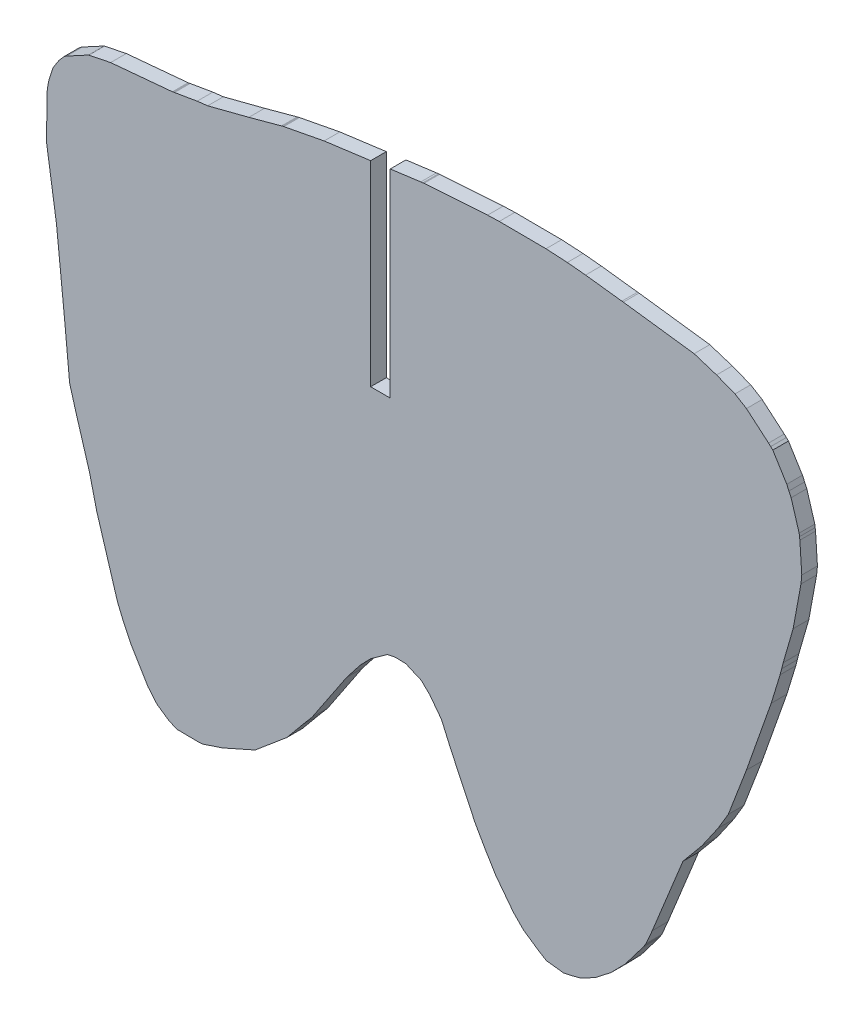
ISO-10303-21;
HEADER;
FILE_DESCRIPTION(('STEP AP214'),'2;1');
FILE_NAME('part.step','',(''),(''),'','','');
FILE_SCHEMA(('AUTOMOTIVE_DESIGN { 1 0 10303 214 1 1 1 1 }'));
ENDSEC;
DATA;
#1=APPLICATION_CONTEXT('core data for automotive mechanical design processes');
#2=APPLICATION_PROTOCOL_DEFINITION('international standard','automotive_design',2000,#1);
#3=PRODUCT_CONTEXT('',#1,'mechanical');
#4=PRODUCT('Part','Part','',(#3));
#5=PRODUCT_RELATED_PRODUCT_CATEGORY('part','',(#4));
#6=PRODUCT_DEFINITION_FORMATION('','',#4);
#7=PRODUCT_DEFINITION_CONTEXT('part definition',#1,'design');
#8=PRODUCT_DEFINITION('design','',#6,#7);
#9=PRODUCT_DEFINITION_SHAPE('','',#8);
#10=(LENGTH_UNIT() NAMED_UNIT(*) SI_UNIT(.MILLI.,.METRE.));
#11=(NAMED_UNIT(*) PLANE_ANGLE_UNIT() SI_UNIT($,.RADIAN.));
#12=(NAMED_UNIT(*) SI_UNIT($,.STERADIAN.) SOLID_ANGLE_UNIT());
#13=UNCERTAINTY_MEASURE_WITH_UNIT(LENGTH_MEASURE(1.E-05),#10,'distance_accuracy_value','');
#14=(GEOMETRIC_REPRESENTATION_CONTEXT(3) GLOBAL_UNCERTAINTY_ASSIGNED_CONTEXT((#13)) GLOBAL_UNIT_ASSIGNED_CONTEXT((#10,
#11,#12)) REPRESENTATION_CONTEXT('',''));
#15=CARTESIAN_POINT('',(0.,0.,0.));
#16=DIRECTION('',(0.,0.,1.));
#17=DIRECTION('',(1.,0.,0.));
#18=AXIS2_PLACEMENT_3D('',#15,#16,#17);
#19=CARTESIAN_POINT('',(-6232.8252,42.5248,2.));
#20=DIRECTION('',(0.199444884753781,-0.979909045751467,0.));
#21=DIRECTION('',(0.979909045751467,0.199444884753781,0.));
#22=AXIS2_PLACEMENT_3D('',#19,#20,#21);
#23=PLANE('',#22);
#24=DIRECTION('',(-0.979909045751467,-0.199444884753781,0.));
#25=VECTOR('',#24,1.);
#26=CARTESIAN_POINT('',(-6232.8252,42.5248,0.));
#27=LINE('',#26,#25);
#28=CARTESIAN_POINT('',(-6232.8252,42.5248,0.));
#29=VERTEX_POINT('',#28);
#30=CARTESIAN_POINT('',(-6235.5982,41.9604,0.));
#31=VERTEX_POINT('',#30);
#32=EDGE_CURVE('E819',#29,#31,#27,.T.);
#33=ORIENTED_EDGE('',*,*,#32,.T.);
#34=DIRECTION('',(0.,0.,-1.));
#35=VECTOR('',#34,1.);
#36=CARTESIAN_POINT('',(-6235.5982,41.9604,2.));
#37=LINE('',#36,#35);
#38=CARTESIAN_POINT('',(-6235.5982,41.9604,2.));
#39=VERTEX_POINT('',#38);
#40=EDGE_CURVE('E11',#39,#31,#37,.T.);
#41=ORIENTED_EDGE('',*,*,#40,.F.);
#42=DIRECTION('',(-0.979909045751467,-0.199444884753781,0.));
#43=VECTOR('',#42,1.);
#44=CARTESIAN_POINT('',(-6232.8252,42.5248,2.));
#45=LINE('',#44,#43);
#46=CARTESIAN_POINT('',(-6232.8252,42.5248,2.));
#47=VERTEX_POINT('',#46);
#48=EDGE_CURVE('E1063',#47,#39,#45,.T.);
#49=ORIENTED_EDGE('',*,*,#48,.F.);
#50=DIRECTION('',(0.,0.,-1.));
#51=VECTOR('',#50,1.);
#52=CARTESIAN_POINT('',(-6232.8252,42.5248,2.));
#53=LINE('',#52,#51);
#54=EDGE_CURVE('E815',#47,#29,#53,.T.);
#55=ORIENTED_EDGE('',*,*,#54,.T.);
#56=EDGE_LOOP('',(#33,#41,#49,#55));
#57=FACE_BOUND('',#56,.T.);
#58=ADVANCED_FACE('F39',(#57),#23,.F.);
#59=CARTESIAN_POINT('',(-6235.5982,41.9604,2.));
#60=DIRECTION('',(0.327007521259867,-0.945021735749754,0.));
#61=DIRECTION('',(0.945021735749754,0.327007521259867,0.));
#62=AXIS2_PLACEMENT_3D('',#59,#60,#61);
#63=PLANE('',#62);
#64=DIRECTION('',(-0.945021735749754,-0.327007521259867,0.));
#65=VECTOR('',#64,1.);
#66=CARTESIAN_POINT('',(-6235.5982,41.9604,0.));
#67=LINE('',#66,#65);
#68=CARTESIAN_POINT('',(-6235.6612,41.9386,0.));
#69=VERTEX_POINT('',#68);
#70=EDGE_CURVE('E822',#31,#69,#67,.T.);
#71=ORIENTED_EDGE('',*,*,#70,.T.);
#72=DIRECTION('',(0.,0.,-1.));
#73=VECTOR('',#72,1.);
#74=CARTESIAN_POINT('',(-6235.6612,41.9386,2.));
#75=LINE('',#74,#73);
#76=CARTESIAN_POINT('',(-6235.6612,41.9386,2.));
#77=VERTEX_POINT('',#76);
#78=EDGE_CURVE('E47',#77,#69,#75,.T.);
#79=ORIENTED_EDGE('',*,*,#78,.F.);
#80=DIRECTION('',(-0.945021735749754,-0.327007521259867,0.));
#81=VECTOR('',#80,1.);
#82=CARTESIAN_POINT('',(-6235.5982,41.9604,2.));
#83=LINE('',#82,#81);
#84=EDGE_CURVE('E440',#39,#77,#83,.T.);
#85=ORIENTED_EDGE('',*,*,#84,.F.);
#86=ORIENTED_EDGE('',*,*,#40,.T.);
#87=EDGE_LOOP('',(#71,#79,#85,#86));
#88=FACE_BOUND('',#87,.T.);
#89=ADVANCED_FACE('F1690',(#88),#63,.F.);
#90=CARTESIAN_POINT('',(-6235.6612,41.9386,2.));
#91=DIRECTION('',(0.475792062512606,-0.879557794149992,0.));
#92=DIRECTION('',(0.879557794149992,0.475792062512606,0.));
#93=AXIS2_PLACEMENT_3D('',#90,#91,#92);
#94=PLANE('',#93);
#95=DIRECTION('',(-0.879557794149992,-0.475792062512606,0.));
#96=VECTOR('',#95,1.);
#97=CARTESIAN_POINT('',(-6235.6612,41.9386,0.));
#98=LINE('',#97,#96);
#99=CARTESIAN_POINT('',(-6238.4369,40.4371,0.));
#100=VERTEX_POINT('',#99);
#101=EDGE_CURVE('E824',#69,#100,#98,.T.);
#102=ORIENTED_EDGE('',*,*,#101,.T.);
#103=DIRECTION('',(0.,0.,-1.));
#104=VECTOR('',#103,1.);
#105=CARTESIAN_POINT('',(-6238.4369,40.4371,2.));
#106=LINE('',#105,#104);
#107=CARTESIAN_POINT('',(-6238.4369,40.4371,2.));
#108=VERTEX_POINT('',#107);
#109=EDGE_CURVE('E1412',#108,#100,#106,.T.);
#110=ORIENTED_EDGE('',*,*,#109,.F.);
#111=DIRECTION('',(-0.879557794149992,-0.475792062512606,0.));
#112=VECTOR('',#111,1.);
#113=CARTESIAN_POINT('',(-6235.6612,41.9386,2.));
#114=LINE('',#113,#112);
#115=EDGE_CURVE('E1420',#77,#108,#114,.T.);
#116=ORIENTED_EDGE('',*,*,#115,.F.);
#117=ORIENTED_EDGE('',*,*,#78,.T.);
#118=EDGE_LOOP('',(#102,#110,#116,#117));
#119=FACE_BOUND('',#118,.T.);
#120=ADVANCED_FACE('F1418',(#119),#94,.F.);
#121=CARTESIAN_POINT('',(-6238.5915,40.3384,2.));
#122=DIRECTION('',(0.538109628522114,-0.842874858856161,0.));
#123=DIRECTION('',(0.842874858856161,0.538109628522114,0.));
#124=AXIS2_PLACEMENT_3D('',#121,#122,#123);
#125=PLANE('',#124);
#126=DIRECTION('',(-0.842874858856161,-0.538109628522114,0.));
#127=VECTOR('',#126,1.);
#128=CARTESIAN_POINT('',(-6238.5915,40.3384,0.));
#129=LINE('',#128,#127);
#130=CARTESIAN_POINT('',(-6238.7461,40.2397,0.));
#131=VERTEX_POINT('',#130);
#132=EDGE_CURVE('E827',#100,#131,#129,.T.);
#133=ORIENTED_EDGE('',*,*,#132,.T.);
#134=DIRECTION('',(0.,0.,-1.));
#135=VECTOR('',#134,1.);
#136=CARTESIAN_POINT('',(-6238.7461,40.2397,2.));
#137=LINE('',#136,#135);
#138=CARTESIAN_POINT('',(-6238.7461,40.2397,2.));
#139=VERTEX_POINT('',#138);
#140=EDGE_CURVE('E1409',#139,#131,#137,.T.);
#141=ORIENTED_EDGE('',*,*,#140,.F.);
#142=DIRECTION('',(-0.842874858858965,-0.538109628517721,0.));
#143=VECTOR('',#142,1.);
#144=CARTESIAN_POINT('',(-6238.4369,40.4371,2.));
#145=LINE('',#144,#143);
#146=EDGE_CURVE('E1437',#108,#139,#145,.T.);
#147=ORIENTED_EDGE('',*,*,#146,.F.);
#148=ORIENTED_EDGE('',*,*,#109,.T.);
#149=EDGE_LOOP('',(#133,#141,#147,#148));
#150=FACE_BOUND('',#149,.T.);
#151=ADVANCED_FACE('F1428',(#150),#125,.F.);
#152=CARTESIAN_POINT('',(-6238.7461,40.2397,2.));
#153=DIRECTION('',(0.755194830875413,-0.655500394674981,0.));
#154=DIRECTION('',(0.655500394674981,0.755194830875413,0.));
#155=AXIS2_PLACEMENT_3D('',#152,#153,#154);
#156=PLANE('',#155);
#157=DIRECTION('',(-0.655500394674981,-0.755194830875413,0.));
#158=VECTOR('',#157,1.);
#159=CARTESIAN_POINT('',(-6238.7461,40.2397,0.));
#160=LINE('',#159,#158);
#161=CARTESIAN_POINT('',(-6239.4378,39.4428,0.));
#162=VERTEX_POINT('',#161);
#163=EDGE_CURVE('E829',#131,#162,#160,.T.);
#164=ORIENTED_EDGE('',*,*,#163,.T.);
#165=DIRECTION('',(0.,0.,-1.));
#166=VECTOR('',#165,1.);
#167=CARTESIAN_POINT('',(-6239.4378,39.4428,2.));
#168=LINE('',#167,#166);
#169=CARTESIAN_POINT('',(-6239.4378,39.4428,2.));
#170=VERTEX_POINT('',#169);
#171=EDGE_CURVE('E1406',#170,#162,#168,.T.);
#172=ORIENTED_EDGE('',*,*,#171,.F.);
#173=DIRECTION('',(-0.655500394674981,-0.755194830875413,0.));
#174=VECTOR('',#173,1.);
#175=CARTESIAN_POINT('',(-6238.7461,40.2397,2.));
#176=LINE('',#175,#174);
#177=EDGE_CURVE('E1434',#139,#170,#176,.T.);
#178=ORIENTED_EDGE('',*,*,#177,.F.);
#179=ORIENTED_EDGE('',*,*,#140,.T.);
#180=EDGE_LOOP('',(#164,#172,#178,#179));
#181=FACE_BOUND('',#180,.T.);
#182=ADVANCED_FACE('F1432',(#181),#156,.F.);
#183=CARTESIAN_POINT('',(-6239.4378,39.4428,2.));
#184=DIRECTION('',(0.844324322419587,-0.535832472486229,0.));
#185=DIRECTION('',(0.535832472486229,0.844324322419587,0.));
#186=AXIS2_PLACEMENT_3D('',#183,#184,#185);
#187=PLANE('',#186);
#188=DIRECTION('',(-0.535832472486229,-0.844324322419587,0.));
#189=VECTOR('',#188,1.);
#190=CARTESIAN_POINT('',(-6239.4378,39.4428,0.));
#191=LINE('',#190,#189);
#192=CARTESIAN_POINT('',(-6239.8036,38.8664,0.));
#193=VERTEX_POINT('',#192);
#194=EDGE_CURVE('E831',#162,#193,#191,.T.);
#195=ORIENTED_EDGE('',*,*,#194,.T.);
#196=DIRECTION('',(0.,0.,-1.));
#197=VECTOR('',#196,1.);
#198=CARTESIAN_POINT('',(-6239.8036,38.8664,2.));
#199=LINE('',#198,#197);
#200=CARTESIAN_POINT('',(-6239.8036,38.8664,2.));
#201=VERTEX_POINT('',#200);
#202=EDGE_CURVE('E1403',#201,#193,#199,.T.);
#203=ORIENTED_EDGE('',*,*,#202,.F.);
#204=DIRECTION('',(-0.535832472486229,-0.844324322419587,0.));
#205=VECTOR('',#204,1.);
#206=CARTESIAN_POINT('',(-6239.4378,39.4428,2.));
#207=LINE('',#206,#205);
#208=EDGE_CURVE('E1436',#170,#201,#207,.T.);
#209=ORIENTED_EDGE('',*,*,#208,.F.);
#210=ORIENTED_EDGE('',*,*,#171,.T.);
#211=EDGE_LOOP('',(#195,#203,#209,#210));
#212=FACE_BOUND('',#211,.T.);
#213=ADVANCED_FACE('F1703',(#212),#187,.F.);
#214=CARTESIAN_POINT('',(-6239.8036,38.8664,2.));
#215=DIRECTION('',(0.844191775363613,-0.536041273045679,0.));
#216=DIRECTION('',(0.536041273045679,0.844191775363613,0.));
#217=AXIS2_PLACEMENT_3D('',#214,#215,#216);
#218=PLANE('',#217);
#219=DIRECTION('',(-0.536041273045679,-0.844191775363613,0.));
#220=VECTOR('',#219,1.);
#221=CARTESIAN_POINT('',(-6239.8036,38.8664,0.));
#222=LINE('',#221,#220);
#223=CARTESIAN_POINT('',(-6240.1696,38.29,0.));
#224=VERTEX_POINT('',#223);
#225=EDGE_CURVE('E833',#193,#224,#222,.T.);
#226=ORIENTED_EDGE('',*,*,#225,.T.);
#227=DIRECTION('',(0.,0.,-1.));
#228=VECTOR('',#227,1.);
#229=CARTESIAN_POINT('',(-6240.1696,38.29,2.));
#230=LINE('',#229,#228);
#231=CARTESIAN_POINT('',(-6240.1696,38.29,2.));
#232=VERTEX_POINT('',#231);
#233=EDGE_CURVE('E1400',#232,#224,#230,.T.);
#234=ORIENTED_EDGE('',*,*,#233,.F.);
#235=DIRECTION('',(-0.536041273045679,-0.844191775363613,0.));
#236=VECTOR('',#235,1.);
#237=CARTESIAN_POINT('',(-6239.8036,38.8664,2.));
#238=LINE('',#237,#236);
#239=EDGE_CURVE('E1439',#201,#232,#238,.T.);
#240=ORIENTED_EDGE('',*,*,#239,.F.);
#241=ORIENTED_EDGE('',*,*,#202,.T.);
#242=EDGE_LOOP('',(#226,#234,#240,#241));
#243=FACE_BOUND('',#242,.T.);
#244=ADVANCED_FACE('F1706',(#243),#218,.F.);
#245=CARTESIAN_POINT('',(-6240.1696,38.29,2.));
#246=DIRECTION('',(0.950366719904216,-0.311131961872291,0.));
#247=DIRECTION('',(0.311131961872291,0.950366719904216,0.));
#248=AXIS2_PLACEMENT_3D('',#245,#246,#247);
#249=PLANE('',#248);
#250=DIRECTION('',(-0.311131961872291,-0.950366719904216,0.));
#251=VECTOR('',#250,1.);
#252=CARTESIAN_POINT('',(-6240.1696,38.29,0.));
#253=LINE('',#252,#251);
#254=CARTESIAN_POINT('',(-6240.4391,37.4668,0.));
#255=VERTEX_POINT('',#254);
#256=EDGE_CURVE('E835',#224,#255,#253,.T.);
#257=ORIENTED_EDGE('',*,*,#256,.T.);
#258=DIRECTION('',(0.,0.,-1.));
#259=VECTOR('',#258,1.);
#260=CARTESIAN_POINT('',(-6240.4391,37.4668,2.));
#261=LINE('',#260,#259);
#262=CARTESIAN_POINT('',(-6240.4391,37.4668,2.));
#263=VERTEX_POINT('',#262);
#264=EDGE_CURVE('E1397',#263,#255,#261,.T.);
#265=ORIENTED_EDGE('',*,*,#264,.F.);
#266=DIRECTION('',(-0.311131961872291,-0.950366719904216,0.));
#267=VECTOR('',#266,1.);
#268=CARTESIAN_POINT('',(-6240.1696,38.29,2.));
#269=LINE('',#268,#267);
#270=EDGE_CURVE('E1445',#232,#263,#269,.T.);
#271=ORIENTED_EDGE('',*,*,#270,.F.);
#272=ORIENTED_EDGE('',*,*,#233,.T.);
#273=EDGE_LOOP('',(#257,#265,#271,#272));
#274=FACE_BOUND('',#273,.T.);
#275=ADVANCED_FACE('F1710',(#274),#249,.F.);
#276=CARTESIAN_POINT('',(-6240.4391,37.4668,2.));
#277=DIRECTION('',(0.95029842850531,-0.311340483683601,0.));
#278=DIRECTION('',(0.311340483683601,0.95029842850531,0.));
#279=AXIS2_PLACEMENT_3D('',#276,#277,#278);
#280=PLANE('',#279);
#281=DIRECTION('',(-0.311340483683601,-0.95029842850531,0.));
#282=VECTOR('',#281,1.);
#283=CARTESIAN_POINT('',(-6240.4391,37.4668,0.));
#284=LINE('',#283,#282);
#285=CARTESIAN_POINT('',(-6240.7088,36.6436,0.));
#286=VERTEX_POINT('',#285);
#287=EDGE_CURVE('E837',#255,#286,#284,.T.);
#288=ORIENTED_EDGE('',*,*,#287,.T.);
#289=DIRECTION('',(0.,0.,-1.));
#290=VECTOR('',#289,1.);
#291=CARTESIAN_POINT('',(-6240.7088,36.6436,2.));
#292=LINE('',#291,#290);
#293=CARTESIAN_POINT('',(-6240.7088,36.6436,2.));
#294=VERTEX_POINT('',#293);
#295=EDGE_CURVE('E1394',#294,#286,#292,.T.);
#296=ORIENTED_EDGE('',*,*,#295,.F.);
#297=DIRECTION('',(-0.311340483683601,-0.95029842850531,0.));
#298=VECTOR('',#297,1.);
#299=CARTESIAN_POINT('',(-6240.4391,37.4668,2.));
#300=LINE('',#299,#298);
#301=EDGE_CURVE('E1447',#263,#294,#300,.T.);
#302=ORIENTED_EDGE('',*,*,#301,.F.);
#303=ORIENTED_EDGE('',*,*,#264,.T.);
#304=EDGE_LOOP('',(#288,#296,#302,#303));
#305=FACE_BOUND('',#304,.T.);
#306=ADVANCED_FACE('F1714',(#305),#280,.F.);
#307=CARTESIAN_POINT('',(-6240.7088,36.6436,2.));
#308=DIRECTION('',(0.982563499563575,-0.185927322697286,0.));
#309=DIRECTION('',(0.185927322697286,0.982563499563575,0.));
#310=AXIS2_PLACEMENT_3D('',#307,#308,#309);
#311=PLANE('',#310);
#312=DIRECTION('',(-0.185927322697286,-0.982563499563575,0.));
#313=VECTOR('',#312,1.);
#314=CARTESIAN_POINT('',(-6240.7088,36.6436,0.));
#315=LINE('',#314,#313);
#316=CARTESIAN_POINT('',(-6240.9129,35.565,0.));
#317=VERTEX_POINT('',#316);
#318=EDGE_CURVE('E839',#286,#317,#315,.T.);
#319=ORIENTED_EDGE('',*,*,#318,.T.);
#320=DIRECTION('',(0.,0.,-1.));
#321=VECTOR('',#320,1.);
#322=CARTESIAN_POINT('',(-6240.9129,35.565,2.));
#323=LINE('',#322,#321);
#324=CARTESIAN_POINT('',(-6240.9129,35.565,2.));
#325=VERTEX_POINT('',#324);
#326=EDGE_CURVE('E1391',#325,#317,#323,.T.);
#327=ORIENTED_EDGE('',*,*,#326,.F.);
#328=DIRECTION('',(-0.185927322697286,-0.982563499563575,0.));
#329=VECTOR('',#328,1.);
#330=CARTESIAN_POINT('',(-6240.7088,36.6436,2.));
#331=LINE('',#330,#329);
#332=EDGE_CURVE('E1449',#294,#325,#331,.T.);
#333=ORIENTED_EDGE('',*,*,#332,.F.);
#334=ORIENTED_EDGE('',*,*,#295,.T.);
#335=EDGE_LOOP('',(#319,#327,#333,#334));
#336=FACE_BOUND('',#335,.T.);
#337=ADVANCED_FACE('F1718',(#336),#311,.F.);
#338=CARTESIAN_POINT('',(-6240.9129,35.565,2.));
#339=DIRECTION('',(0.999828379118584,-0.018525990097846,0.));
#340=DIRECTION('',(0.018525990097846,0.999828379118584,0.));
#341=AXIS2_PLACEMENT_3D('',#338,#339,#340);
#342=PLANE('',#341);
#343=DIRECTION('',(-0.018525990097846,-0.999828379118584,0.));
#344=VECTOR('',#343,1.);
#345=CARTESIAN_POINT('',(-6240.9129,35.565,0.));
#346=LINE('',#345,#344);
#347=CARTESIAN_POINT('',(-6241.0031,30.697,0.));
#348=VERTEX_POINT('',#347);
#349=EDGE_CURVE('E841',#317,#348,#346,.T.);
#350=ORIENTED_EDGE('',*,*,#349,.T.);
#351=DIRECTION('',(0.,0.,-1.));
#352=VECTOR('',#351,1.);
#353=CARTESIAN_POINT('',(-6241.0031,30.697,2.));
#354=LINE('',#353,#352);
#355=CARTESIAN_POINT('',(-6241.0031,30.697,2.));
#356=VERTEX_POINT('',#355);
#357=EDGE_CURVE('E1388',#356,#348,#354,.T.);
#358=ORIENTED_EDGE('',*,*,#357,.F.);
#359=DIRECTION('',(-0.018525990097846,-0.999828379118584,0.));
#360=VECTOR('',#359,1.);
#361=CARTESIAN_POINT('',(-6240.9129,35.565,2.));
#362=LINE('',#361,#360);
#363=EDGE_CURVE('E1451',#325,#356,#362,.T.);
#364=ORIENTED_EDGE('',*,*,#363,.F.);
#365=ORIENTED_EDGE('',*,*,#326,.T.);
#366=EDGE_LOOP('',(#350,#358,#364,#365));
#367=FACE_BOUND('',#366,.T.);
#368=ADVANCED_FACE('F1722',(#367),#342,.F.);
#369=CARTESIAN_POINT('',(-6241.0031,30.697,2.));
#370=DIRECTION('',(0.999999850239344,-0.000547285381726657,0.));
#371=DIRECTION('',(0.000547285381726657,0.999999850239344,0.));
#372=AXIS2_PLACEMENT_3D('',#369,#370,#371);
#373=PLANE('',#372);
#374=DIRECTION('',(-0.000547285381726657,-0.999999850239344,0.));
#375=VECTOR('',#374,1.);
#376=CARTESIAN_POINT('',(-6241.0031,30.697,0.));
#377=LINE('',#376,#375);
#378=CARTESIAN_POINT('',(-6241.0036,29.7834,0.));
#379=VERTEX_POINT('',#378);
#380=EDGE_CURVE('E843',#348,#379,#377,.T.);
#381=ORIENTED_EDGE('',*,*,#380,.T.);
#382=DIRECTION('',(0.,0.,-1.));
#383=VECTOR('',#382,1.);
#384=CARTESIAN_POINT('',(-6241.0036,29.7834,2.));
#385=LINE('',#384,#383);
#386=CARTESIAN_POINT('',(-6241.0036,29.7834,2.));
#387=VERTEX_POINT('',#386);
#388=EDGE_CURVE('E1385',#387,#379,#385,.T.);
#389=ORIENTED_EDGE('',*,*,#388,.F.);
#390=DIRECTION('',(-0.000547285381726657,-0.999999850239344,0.));
#391=VECTOR('',#390,1.);
#392=CARTESIAN_POINT('',(-6241.0031,30.697,2.));
#393=LINE('',#392,#391);
#394=EDGE_CURVE('E1453',#356,#387,#393,.T.);
#395=ORIENTED_EDGE('',*,*,#394,.F.);
#396=ORIENTED_EDGE('',*,*,#357,.T.);
#397=EDGE_LOOP('',(#381,#389,#395,#396));
#398=FACE_BOUND('',#397,.T.);
#399=ADVANCED_FACE('F1726',(#398),#373,.F.);
#400=CARTESIAN_POINT('',(-6241.0036,29.7834,2.));
#401=DIRECTION('',(0.998052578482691,0.0623782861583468,0.));
#402=DIRECTION('',(-0.0623782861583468,0.998052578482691,0.));
#403=AXIS2_PLACEMENT_3D('',#400,#401,#402);
#404=PLANE('',#403);
#405=DIRECTION('',(0.0623782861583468,-0.998052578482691,0.));
#406=VECTOR('',#405,1.);
#407=CARTESIAN_POINT('',(-6241.0036,29.7834,0.));
#408=LINE('',#407,#406);
#409=CARTESIAN_POINT('',(-6240.9936,29.6234,0.));
#410=VERTEX_POINT('',#409);
#411=EDGE_CURVE('E845',#379,#410,#408,.T.);
#412=ORIENTED_EDGE('',*,*,#411,.T.);
#413=DIRECTION('',(0.,0.,-1.));
#414=VECTOR('',#413,1.);
#415=CARTESIAN_POINT('',(-6240.9936,29.6234,2.));
#416=LINE('',#415,#414);
#417=CARTESIAN_POINT('',(-6240.9936,29.6234,2.));
#418=VERTEX_POINT('',#417);
#419=EDGE_CURVE('E1382',#418,#410,#416,.T.);
#420=ORIENTED_EDGE('',*,*,#419,.F.);
#421=DIRECTION('',(0.0623782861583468,-0.998052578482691,0.));
#422=VECTOR('',#421,1.);
#423=CARTESIAN_POINT('',(-6241.0036,29.7834,2.));
#424=LINE('',#423,#422);
#425=EDGE_CURVE('E1455',#387,#418,#424,.T.);
#426=ORIENTED_EDGE('',*,*,#425,.F.);
#427=ORIENTED_EDGE('',*,*,#388,.T.);
#428=EDGE_LOOP('',(#412,#420,#426,#427));
#429=FACE_BOUND('',#428,.T.);
#430=ADVANCED_FACE('F1730',(#429),#404,.F.);
#431=CARTESIAN_POINT('',(-6240.9936,29.6234,2.));
#432=DIRECTION('',(0.998088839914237,0.0617953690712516,0.));
#433=DIRECTION('',(-0.0617953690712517,0.998088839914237,0.));
#434=AXIS2_PLACEMENT_3D('',#431,#432,#433);
#435=PLANE('',#434);
#436=DIRECTION('',(0.0617953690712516,-0.998088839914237,0.));
#437=VECTOR('',#436,1.);
#438=CARTESIAN_POINT('',(-6240.9936,29.6234,0.));
#439=LINE('',#438,#437);
#440=CARTESIAN_POINT('',(-6240.9837,29.4635,0.));
#441=VERTEX_POINT('',#440);
#442=EDGE_CURVE('E847',#410,#441,#439,.T.);
#443=ORIENTED_EDGE('',*,*,#442,.T.);
#444=DIRECTION('',(0.,0.,-1.));
#445=VECTOR('',#444,1.);
#446=CARTESIAN_POINT('',(-6240.9837,29.4635,2.));
#447=LINE('',#446,#445);
#448=CARTESIAN_POINT('',(-6240.9837,29.4635,2.));
#449=VERTEX_POINT('',#448);
#450=EDGE_CURVE('E1379',#449,#441,#447,.T.);
#451=ORIENTED_EDGE('',*,*,#450,.F.);
#452=DIRECTION('',(0.0617953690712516,-0.998088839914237,0.));
#453=VECTOR('',#452,1.);
#454=CARTESIAN_POINT('',(-6240.9936,29.6234,2.));
#455=LINE('',#454,#453);
#456=EDGE_CURVE('E1457',#418,#449,#455,.T.);
#457=ORIENTED_EDGE('',*,*,#456,.F.);
#458=ORIENTED_EDGE('',*,*,#419,.T.);
#459=EDGE_LOOP('',(#443,#451,#457,#458));
#460=FACE_BOUND('',#459,.T.);
#461=ADVANCED_FACE('F1734',(#460),#435,.F.);
#462=CARTESIAN_POINT('',(-6240.9837,29.4635,2.));
#463=DIRECTION('',(0.98871086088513,0.14983602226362,0.));
#464=DIRECTION('',(-0.14983602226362,0.988710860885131,0.));
#465=AXIS2_PLACEMENT_3D('',#462,#463,#464);
#466=PLANE('',#465);
#467=DIRECTION('',(0.14983602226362,-0.98871086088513,0.));
#468=VECTOR('',#467,1.);
#469=CARTESIAN_POINT('',(-6240.9837,29.4635,0.));
#470=LINE('',#469,#468);
#471=CARTESIAN_POINT('',(-6239.738,21.2436,0.));
#472=VERTEX_POINT('',#471);
#473=EDGE_CURVE('E849',#441,#472,#470,.T.);
#474=ORIENTED_EDGE('',*,*,#473,.T.);
#475=DIRECTION('',(0.,0.,-1.));
#476=VECTOR('',#475,1.);
#477=CARTESIAN_POINT('',(-6239.738,21.2436,2.));
#478=LINE('',#477,#476);
#479=CARTESIAN_POINT('',(-6239.738,21.2436,2.));
#480=VERTEX_POINT('',#479);
#481=EDGE_CURVE('E1376',#480,#472,#478,.T.);
#482=ORIENTED_EDGE('',*,*,#481,.F.);
#483=DIRECTION('',(0.14983602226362,-0.98871086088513,0.));
#484=VECTOR('',#483,1.);
#485=CARTESIAN_POINT('',(-6240.9837,29.4635,2.));
#486=LINE('',#485,#484);
#487=EDGE_CURVE('E1459',#449,#480,#486,.T.);
#488=ORIENTED_EDGE('',*,*,#487,.F.);
#489=ORIENTED_EDGE('',*,*,#450,.T.);
#490=EDGE_LOOP('',(#474,#482,#488,#489));
#491=FACE_BOUND('',#490,.T.);
#492=ADVANCED_FACE('F1738',(#491),#466,.F.);
#493=CARTESIAN_POINT('',(-6239.738,21.2436,2.));
#494=DIRECTION('',(0.994718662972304,0.102639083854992,0.));
#495=DIRECTION('',(-0.102639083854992,0.994718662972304,0.));
#496=AXIS2_PLACEMENT_3D('',#493,#494,#495);
#497=PLANE('',#496);
#498=DIRECTION('',(0.102639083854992,-0.994718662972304,0.));
#499=VECTOR('',#498,1.);
#500=CARTESIAN_POINT('',(-6239.738,21.2436,0.));
#501=LINE('',#500,#499);
#502=CARTESIAN_POINT('',(-6238.7133,11.3128,0.));
#503=VERTEX_POINT('',#502);
#504=EDGE_CURVE('E851',#472,#503,#501,.T.);
#505=ORIENTED_EDGE('',*,*,#504,.T.);
#506=DIRECTION('',(0.,0.,-1.));
#507=VECTOR('',#506,1.);
#508=CARTESIAN_POINT('',(-6238.7133,11.3128,2.));
#509=LINE('',#508,#507);
#510=CARTESIAN_POINT('',(-6238.7133,11.3128,2.));
#511=VERTEX_POINT('',#510);
#512=EDGE_CURVE('E1373',#511,#503,#509,.T.);
#513=ORIENTED_EDGE('',*,*,#512,.F.);
#514=DIRECTION('',(0.102639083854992,-0.994718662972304,0.));
#515=VECTOR('',#514,1.);
#516=CARTESIAN_POINT('',(-6239.738,21.2436,2.));
#517=LINE('',#516,#515);
#518=EDGE_CURVE('E1461',#480,#511,#517,.T.);
#519=ORIENTED_EDGE('',*,*,#518,.F.);
#520=ORIENTED_EDGE('',*,*,#481,.T.);
#521=EDGE_LOOP('',(#505,#513,#519,#520));
#522=FACE_BOUND('',#521,.T.);
#523=ADVANCED_FACE('F1742',(#522),#497,.F.);
#524=CARTESIAN_POINT('',(-6238.7133,11.3128,2.));
#525=DIRECTION('',(0.995465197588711,0.0951264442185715,0.));
#526=DIRECTION('',(-0.0951264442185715,0.995465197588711,0.));
#527=AXIS2_PLACEMENT_3D('',#524,#525,#526);
#528=PLANE('',#527);
#529=DIRECTION('',(0.0951264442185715,-0.995465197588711,0.));
#530=VECTOR('',#529,1.);
#531=CARTESIAN_POINT('',(-6238.7133,11.3128,0.));
#532=LINE('',#531,#530);
#533=CARTESIAN_POINT('',(-6238.0612,4.4888,0.));
#534=VERTEX_POINT('',#533);
#535=EDGE_CURVE('E853',#503,#534,#532,.T.);
#536=ORIENTED_EDGE('',*,*,#535,.T.);
#537=DIRECTION('',(0.,0.,-1.));
#538=VECTOR('',#537,1.);
#539=CARTESIAN_POINT('',(-6238.0612,4.4888,2.));
#540=LINE('',#539,#538);
#541=CARTESIAN_POINT('',(-6238.0612,4.4888,2.));
#542=VERTEX_POINT('',#541);
#543=EDGE_CURVE('E1370',#542,#534,#540,.T.);
#544=ORIENTED_EDGE('',*,*,#543,.F.);
#545=DIRECTION('',(0.0951264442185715,-0.995465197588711,0.));
#546=VECTOR('',#545,1.);
#547=CARTESIAN_POINT('',(-6238.7133,11.3128,2.));
#548=LINE('',#547,#546);
#549=EDGE_CURVE('E1463',#511,#542,#548,.T.);
#550=ORIENTED_EDGE('',*,*,#549,.F.);
#551=ORIENTED_EDGE('',*,*,#512,.T.);
#552=EDGE_LOOP('',(#536,#544,#550,#551));
#553=FACE_BOUND('',#552,.T.);
#554=ADVANCED_FACE('F1746',(#553),#528,.F.);
#555=CARTESIAN_POINT('',(-6238.0612,4.4888,2.));
#556=DIRECTION('',(0.961768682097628,0.273863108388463,0.));
#557=DIRECTION('',(-0.273863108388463,0.961768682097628,0.));
#558=AXIS2_PLACEMENT_3D('',#555,#556,#557);
#559=PLANE('',#558);
#560=DIRECTION('',(0.273863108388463,-0.961768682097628,0.));
#561=VECTOR('',#560,1.);
#562=CARTESIAN_POINT('',(-6238.0612,4.4888,0.));
#563=LINE('',#562,#561);
#564=CARTESIAN_POINT('',(-6237.277,1.7348,0.));
#565=VERTEX_POINT('',#564);
#566=EDGE_CURVE('E855',#534,#565,#563,.T.);
#567=ORIENTED_EDGE('',*,*,#566,.T.);
#568=DIRECTION('',(0.,0.,-1.));
#569=VECTOR('',#568,1.);
#570=CARTESIAN_POINT('',(-6237.277,1.7348,2.));
#571=LINE('',#570,#569);
#572=CARTESIAN_POINT('',(-6237.277,1.7348,2.));
#573=VERTEX_POINT('',#572);
#574=EDGE_CURVE('E1367',#573,#565,#571,.T.);
#575=ORIENTED_EDGE('',*,*,#574,.F.);
#576=DIRECTION('',(0.273863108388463,-0.961768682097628,0.));
#577=VECTOR('',#576,1.);
#578=CARTESIAN_POINT('',(-6238.0612,4.4888,2.));
#579=LINE('',#578,#577);
#580=EDGE_CURVE('E1465',#542,#573,#579,.T.);
#581=ORIENTED_EDGE('',*,*,#580,.F.);
#582=ORIENTED_EDGE('',*,*,#543,.T.);
#583=EDGE_LOOP('',(#567,#575,#581,#582));
#584=FACE_BOUND('',#583,.T.);
#585=ADVANCED_FACE('F1750',(#584),#559,.F.);
#586=CARTESIAN_POINT('',(-6237.277,1.7348,2.));
#587=DIRECTION('',(0.957686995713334,0.287811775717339,0.));
#588=DIRECTION('',(-0.287811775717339,0.957686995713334,0.));
#589=AXIS2_PLACEMENT_3D('',#586,#587,#588);
#590=PLANE('',#589);
#591=DIRECTION('',(0.287811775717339,-0.957686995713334,0.));
#592=VECTOR('',#591,1.);
#593=CARTESIAN_POINT('',(-6237.277,1.7348,0.));
#594=LINE('',#593,#592);
#595=CARTESIAN_POINT('',(-6235.5126,-4.1362,0.));
#596=VERTEX_POINT('',#595);
#597=EDGE_CURVE('E857',#565,#596,#594,.T.);
#598=ORIENTED_EDGE('',*,*,#597,.T.);
#599=DIRECTION('',(0.,0.,-1.));
#600=VECTOR('',#599,1.);
#601=CARTESIAN_POINT('',(-6235.5126,-4.1362,2.));
#602=LINE('',#601,#600);
#603=CARTESIAN_POINT('',(-6235.5126,-4.1362,2.));
#604=VERTEX_POINT('',#603);
#605=EDGE_CURVE('E1364',#604,#596,#602,.T.);
#606=ORIENTED_EDGE('',*,*,#605,.F.);
#607=DIRECTION('',(0.287811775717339,-0.957686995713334,0.));
#608=VECTOR('',#607,1.);
#609=CARTESIAN_POINT('',(-6237.277,1.7348,2.));
#610=LINE('',#609,#608);
#611=EDGE_CURVE('E1467',#573,#604,#610,.T.);
#612=ORIENTED_EDGE('',*,*,#611,.F.);
#613=ORIENTED_EDGE('',*,*,#574,.T.);
#614=EDGE_LOOP('',(#598,#606,#612,#613));
#615=FACE_BOUND('',#614,.T.);
#616=ADVANCED_FACE('F1754',(#615),#590,.F.);
#617=CARTESIAN_POINT('',(-6235.5126,-4.1362,2.));
#618=DIRECTION('',(0.972536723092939,0.232749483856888,0.));
#619=DIRECTION('',(-0.232749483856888,0.972536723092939,0.));
#620=AXIS2_PLACEMENT_3D('',#617,#618,#619);
#621=PLANE('',#620);
#622=DIRECTION('',(0.232749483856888,-0.972536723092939,0.));
#623=VECTOR('',#622,1.);
#624=CARTESIAN_POINT('',(-6235.5126,-4.1362,0.));
#625=LINE('',#624,#623);
#626=CARTESIAN_POINT('',(-6234.5976,-7.9595,0.));
#627=VERTEX_POINT('',#626);
#628=EDGE_CURVE('E859',#596,#627,#625,.T.);
#629=ORIENTED_EDGE('',*,*,#628,.T.);
#630=DIRECTION('',(0.,0.,-1.));
#631=VECTOR('',#630,1.);
#632=CARTESIAN_POINT('',(-6234.5976,-7.9595,2.));
#633=LINE('',#632,#631);
#634=CARTESIAN_POINT('',(-6234.5976,-7.9595,2.));
#635=VERTEX_POINT('',#634);
#636=EDGE_CURVE('E1361',#635,#627,#633,.T.);
#637=ORIENTED_EDGE('',*,*,#636,.F.);
#638=DIRECTION('',(0.232749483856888,-0.972536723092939,0.));
#639=VECTOR('',#638,1.);
#640=CARTESIAN_POINT('',(-6235.5126,-4.1362,2.));
#641=LINE('',#640,#639);
#642=EDGE_CURVE('E1469',#604,#635,#641,.T.);
#643=ORIENTED_EDGE('',*,*,#642,.F.);
#644=ORIENTED_EDGE('',*,*,#605,.T.);
#645=EDGE_LOOP('',(#629,#637,#643,#644));
#646=FACE_BOUND('',#645,.T.);
#647=ADVANCED_FACE('F1758',(#646),#621,.F.);
#648=CARTESIAN_POINT('',(-6234.5976,-7.9595,2.));
#649=DIRECTION('',(0.956512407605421,0.291691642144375,0.));
#650=DIRECTION('',(-0.291691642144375,0.956512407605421,0.));
#651=AXIS2_PLACEMENT_3D('',#648,#649,#650);
#652=PLANE('',#651);
#653=DIRECTION('',(0.291691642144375,-0.956512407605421,0.));
#654=VECTOR('',#653,1.);
#655=CARTESIAN_POINT('',(-6234.5976,-7.9595,0.));
#656=LINE('',#655,#654);
#657=CARTESIAN_POINT('',(-6231.9546,-16.6264,0.));
#658=VERTEX_POINT('',#657);
#659=EDGE_CURVE('E861',#627,#658,#656,.T.);
#660=ORIENTED_EDGE('',*,*,#659,.T.);
#661=DIRECTION('',(0.,0.,-1.));
#662=VECTOR('',#661,1.);
#663=CARTESIAN_POINT('',(-6231.9546,-16.6264,2.));
#664=LINE('',#663,#662);
#665=CARTESIAN_POINT('',(-6231.9546,-16.6264,2.));
#666=VERTEX_POINT('',#665);
#667=EDGE_CURVE('E1358',#666,#658,#664,.T.);
#668=ORIENTED_EDGE('',*,*,#667,.F.);
#669=DIRECTION('',(0.291691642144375,-0.956512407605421,0.));
#670=VECTOR('',#669,1.);
#671=CARTESIAN_POINT('',(-6234.5976,-7.9595,2.));
#672=LINE('',#671,#670);
#673=EDGE_CURVE('E1471',#635,#666,#672,.T.);
#674=ORIENTED_EDGE('',*,*,#673,.F.);
#675=ORIENTED_EDGE('',*,*,#636,.T.);
#676=EDGE_LOOP('',(#660,#668,#674,#675));
#677=FACE_BOUND('',#676,.T.);
#678=ADVANCED_FACE('F1762',(#677),#652,.F.);
#679=CARTESIAN_POINT('',(-6231.9546,-16.6264,2.));
#680=DIRECTION('',(0.922877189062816,0.38509439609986,0.));
#681=DIRECTION('',(-0.38509439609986,0.922877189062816,0.));
#682=AXIS2_PLACEMENT_3D('',#679,#680,#681);
#683=PLANE('',#682);
#684=DIRECTION('',(0.38509439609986,-0.922877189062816,0.));
#685=VECTOR('',#684,1.);
#686=CARTESIAN_POINT('',(-6231.9546,-16.6264,0.));
#687=LINE('',#686,#685);
#688=CARTESIAN_POINT('',(-6231.1498,-18.5551,0.));
#689=VERTEX_POINT('',#688);
#690=EDGE_CURVE('E863',#658,#689,#687,.T.);
#691=ORIENTED_EDGE('',*,*,#690,.T.);
#692=DIRECTION('',(0.,0.,-1.));
#693=VECTOR('',#692,1.);
#694=CARTESIAN_POINT('',(-6231.1498,-18.5551,2.));
#695=LINE('',#694,#693);
#696=CARTESIAN_POINT('',(-6231.1498,-18.5551,2.));
#697=VERTEX_POINT('',#696);
#698=EDGE_CURVE('E1355',#697,#689,#695,.T.);
#699=ORIENTED_EDGE('',*,*,#698,.F.);
#700=DIRECTION('',(0.38509439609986,-0.922877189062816,0.));
#701=VECTOR('',#700,1.);
#702=CARTESIAN_POINT('',(-6231.9546,-16.6264,2.));
#703=LINE('',#702,#701);
#704=EDGE_CURVE('E1473',#666,#697,#703,.T.);
#705=ORIENTED_EDGE('',*,*,#704,.F.);
#706=ORIENTED_EDGE('',*,*,#667,.T.);
#707=EDGE_LOOP('',(#691,#699,#705,#706));
#708=FACE_BOUND('',#707,.T.);
#709=ADVANCED_FACE('F1766',(#708),#683,.F.);
#710=CARTESIAN_POINT('',(-6231.1498,-18.5551,2.));
#711=DIRECTION('',(0.901282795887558,0.433231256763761,0.));
#712=DIRECTION('',(-0.433231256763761,0.901282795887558,0.));
#713=AXIS2_PLACEMENT_3D('',#710,#711,#712);
#714=PLANE('',#713);
#715=DIRECTION('',(0.433231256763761,-0.901282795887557,0.));
#716=VECTOR('',#715,1.);
#717=CARTESIAN_POINT('',(-6231.1498,-18.5551,0.));
#718=LINE('',#717,#716);
#719=CARTESIAN_POINT('',(-6230.2179,-20.4938,0.));
#720=VERTEX_POINT('',#719);
#721=EDGE_CURVE('E865',#689,#720,#718,.T.);
#722=ORIENTED_EDGE('',*,*,#721,.T.);
#723=DIRECTION('',(0.,0.,-1.));
#724=VECTOR('',#723,1.);
#725=CARTESIAN_POINT('',(-6230.2179,-20.4938,2.));
#726=LINE('',#725,#724);
#727=CARTESIAN_POINT('',(-6230.2179,-20.4938,2.));
#728=VERTEX_POINT('',#727);
#729=EDGE_CURVE('E1352',#728,#720,#726,.T.);
#730=ORIENTED_EDGE('',*,*,#729,.F.);
#731=DIRECTION('',(0.433231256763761,-0.901282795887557,0.));
#732=VECTOR('',#731,1.);
#733=CARTESIAN_POINT('',(-6231.1498,-18.5551,2.));
#734=LINE('',#733,#732);
#735=EDGE_CURVE('E1475',#697,#728,#734,.T.);
#736=ORIENTED_EDGE('',*,*,#735,.F.);
#737=ORIENTED_EDGE('',*,*,#698,.T.);
#738=EDGE_LOOP('',(#722,#730,#736,#737));
#739=FACE_BOUND('',#738,.T.);
#740=ADVANCED_FACE('F1770',(#739),#714,.F.);
#741=CARTESIAN_POINT('',(-6230.2179,-20.4938,2.));
#742=DIRECTION('',(0.856176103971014,0.516684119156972,0.));
#743=DIRECTION('',(-0.516684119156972,0.856176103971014,0.));
#744=AXIS2_PLACEMENT_3D('',#741,#742,#743);
#745=PLANE('',#744);
#746=DIRECTION('',(0.516684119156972,-0.856176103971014,0.));
#747=VECTOR('',#746,1.);
#748=CARTESIAN_POINT('',(-6230.2179,-20.4938,0.));
#749=LINE('',#748,#747);
#750=CARTESIAN_POINT('',(-6228.0356,-24.11,0.));
#751=VERTEX_POINT('',#750);
#752=EDGE_CURVE('E867',#720,#751,#749,.T.);
#753=ORIENTED_EDGE('',*,*,#752,.T.);
#754=DIRECTION('',(0.,0.,-1.));
#755=VECTOR('',#754,1.);
#756=CARTESIAN_POINT('',(-6228.0356,-24.11,2.));
#757=LINE('',#756,#755);
#758=CARTESIAN_POINT('',(-6228.0356,-24.11,2.));
#759=VERTEX_POINT('',#758);
#760=EDGE_CURVE('E1349',#759,#751,#757,.T.);
#761=ORIENTED_EDGE('',*,*,#760,.F.);
#762=DIRECTION('',(0.516684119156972,-0.856176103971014,0.));
#763=VECTOR('',#762,1.);
#764=CARTESIAN_POINT('',(-6230.2179,-20.4938,2.));
#765=LINE('',#764,#763);
#766=EDGE_CURVE('E1477',#728,#759,#765,.T.);
#767=ORIENTED_EDGE('',*,*,#766,.F.);
#768=ORIENTED_EDGE('',*,*,#729,.T.);
#769=EDGE_LOOP('',(#753,#761,#767,#768));
#770=FACE_BOUND('',#769,.T.);
#771=ADVANCED_FACE('F1774',(#770),#745,.F.);
#772=CARTESIAN_POINT('',(-6228.0356,-24.11,2.));
#773=DIRECTION('',(0.76236719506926,0.647144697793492,0.));
#774=DIRECTION('',(-0.647144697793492,0.76236719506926,0.));
#775=AXIS2_PLACEMENT_3D('',#772,#773,#774);
#776=PLANE('',#775);
#777=DIRECTION('',(0.647144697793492,-0.76236719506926,0.));
#778=VECTOR('',#777,1.);
#779=CARTESIAN_POINT('',(-6228.0356,-24.11,0.));
#780=LINE('',#779,#778);
#781=CARTESIAN_POINT('',(-6226.8904,-25.4591,0.));
#782=VERTEX_POINT('',#781);
#783=EDGE_CURVE('E869',#751,#782,#780,.T.);
#784=ORIENTED_EDGE('',*,*,#783,.T.);
#785=DIRECTION('',(0.,0.,-1.));
#786=VECTOR('',#785,1.);
#787=CARTESIAN_POINT('',(-6226.8904,-25.4591,2.));
#788=LINE('',#787,#786);
#789=CARTESIAN_POINT('',(-6226.8904,-25.4591,2.));
#790=VERTEX_POINT('',#789);
#791=EDGE_CURVE('E1346',#790,#782,#788,.T.);
#792=ORIENTED_EDGE('',*,*,#791,.F.);
#793=DIRECTION('',(0.647144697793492,-0.76236719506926,0.));
#794=VECTOR('',#793,1.);
#795=CARTESIAN_POINT('',(-6228.0356,-24.11,2.));
#796=LINE('',#795,#794);
#797=EDGE_CURVE('E1479',#759,#790,#796,.T.);
#798=ORIENTED_EDGE('',*,*,#797,.F.);
#799=ORIENTED_EDGE('',*,*,#760,.T.);
#800=EDGE_LOOP('',(#784,#792,#798,#799));
#801=FACE_BOUND('',#800,.T.);
#802=ADVANCED_FACE('F1778',(#801),#776,.F.);
#803=CARTESIAN_POINT('',(-6226.8904,-25.4591,2.));
#804=DIRECTION('',(0.564266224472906,0.825592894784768,0.));
#805=DIRECTION('',(-0.825592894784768,0.564266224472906,0.));
#806=AXIS2_PLACEMENT_3D('',#803,#804,#805);
#807=PLANE('',#806);
#808=DIRECTION('',(0.825592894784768,-0.564266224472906,0.));
#809=VECTOR('',#808,1.);
#810=CARTESIAN_POINT('',(-6226.8904,-25.4591,0.));
#811=LINE('',#810,#809);
#812=CARTESIAN_POINT('',(-6225.4163,-26.4666,0.));
#813=VERTEX_POINT('',#812);
#814=EDGE_CURVE('E871',#782,#813,#811,.T.);
#815=ORIENTED_EDGE('',*,*,#814,.T.);
#816=DIRECTION('',(0.,0.,-1.));
#817=VECTOR('',#816,1.);
#818=CARTESIAN_POINT('',(-6225.4163,-26.4666,2.));
#819=LINE('',#818,#817);
#820=CARTESIAN_POINT('',(-6225.4163,-26.4666,2.));
#821=VERTEX_POINT('',#820);
#822=EDGE_CURVE('E1343',#821,#813,#819,.T.);
#823=ORIENTED_EDGE('',*,*,#822,.F.);
#824=DIRECTION('',(0.825592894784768,-0.564266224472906,0.));
#825=VECTOR('',#824,1.);
#826=CARTESIAN_POINT('',(-6226.8904,-25.4591,2.));
#827=LINE('',#826,#825);
#828=EDGE_CURVE('E1481',#790,#821,#827,.T.);
#829=ORIENTED_EDGE('',*,*,#828,.F.);
#830=ORIENTED_EDGE('',*,*,#791,.T.);
#831=EDGE_LOOP('',(#815,#823,#829,#830));
#832=FACE_BOUND('',#831,.T.);
#833=ADVANCED_FACE('F1782',(#832),#807,.F.);
#834=CARTESIAN_POINT('',(-6225.4163,-26.4666,2.));
#835=DIRECTION('',(0.422761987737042,0.906240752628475,0.));
#836=DIRECTION('',(-0.906240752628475,0.422761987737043,0.));
#837=AXIS2_PLACEMENT_3D('',#834,#835,#836);
#838=PLANE('',#837);
#839=DIRECTION('',(0.906240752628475,-0.422761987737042,0.));
#840=VECTOR('',#839,1.);
#841=CARTESIAN_POINT('',(-6225.4163,-26.4666,0.));
#842=LINE('',#841,#840);
#843=CARTESIAN_POINT('',(-6224.4118,-26.9352,0.));
#844=VERTEX_POINT('',#843);
#845=EDGE_CURVE('E873',#813,#844,#842,.T.);
#846=ORIENTED_EDGE('',*,*,#845,.T.);
#847=DIRECTION('',(0.,0.,-1.));
#848=VECTOR('',#847,1.);
#849=CARTESIAN_POINT('',(-6224.4118,-26.9352,2.));
#850=LINE('',#849,#848);
#851=CARTESIAN_POINT('',(-6224.4118,-26.9352,2.));
#852=VERTEX_POINT('',#851);
#853=EDGE_CURVE('E1340',#852,#844,#850,.T.);
#854=ORIENTED_EDGE('',*,*,#853,.F.);
#855=DIRECTION('',(0.906240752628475,-0.422761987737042,0.));
#856=VECTOR('',#855,1.);
#857=CARTESIAN_POINT('',(-6225.4163,-26.4666,2.));
#858=LINE('',#857,#856);
#859=EDGE_CURVE('E1483',#821,#852,#858,.T.);
#860=ORIENTED_EDGE('',*,*,#859,.F.);
#861=ORIENTED_EDGE('',*,*,#822,.T.);
#862=EDGE_LOOP('',(#846,#854,#860,#861));
#863=FACE_BOUND('',#862,.T.);
#864=ADVANCED_FACE('F1786',(#863),#838,.F.);
#865=CARTESIAN_POINT('',(-6224.4118,-26.9352,2.));
#866=DIRECTION('',(0.012349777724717,0.999923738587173,0.));
#867=DIRECTION('',(-0.999923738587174,0.012349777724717,0.));
#868=AXIS2_PLACEMENT_3D('',#865,#866,#867);
#869=PLANE('',#868);
#870=DIRECTION('',(0.999923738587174,-0.012349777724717,0.));
#871=VECTOR('',#870,1.);
#872=CARTESIAN_POINT('',(-6224.4118,-26.9352,0.));
#873=LINE('',#872,#871);
#874=CARTESIAN_POINT('',(-6221.4727,-26.9715,0.));
#875=VERTEX_POINT('',#874);
#876=EDGE_CURVE('E875',#844,#875,#873,.T.);
#877=ORIENTED_EDGE('',*,*,#876,.T.);
#878=DIRECTION('',(0.,0.,-1.));
#879=VECTOR('',#878,1.);
#880=CARTESIAN_POINT('',(-6221.4727,-26.9715,2.));
#881=LINE('',#880,#879);
#882=CARTESIAN_POINT('',(-6221.4727,-26.9715,2.));
#883=VERTEX_POINT('',#882);
#884=EDGE_CURVE('E1337',#883,#875,#881,.T.);
#885=ORIENTED_EDGE('',*,*,#884,.F.);
#886=DIRECTION('',(0.999923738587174,-0.012349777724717,0.));
#887=VECTOR('',#886,1.);
#888=CARTESIAN_POINT('',(-6224.4118,-26.9352,2.));
#889=LINE('',#888,#887);
#890=EDGE_CURVE('E1485',#852,#883,#889,.T.);
#891=ORIENTED_EDGE('',*,*,#890,.F.);
#892=ORIENTED_EDGE('',*,*,#853,.T.);
#893=EDGE_LOOP('',(#877,#885,#891,#892));
#894=FACE_BOUND('',#893,.T.);
#895=ADVANCED_FACE('F1790',(#894),#869,.F.);
#896=CARTESIAN_POINT('',(-6221.4727,-26.9715,2.));
#897=DIRECTION('',(-0.547437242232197,0.836846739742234,0.));
#898=DIRECTION('',(-0.836846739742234,-0.547437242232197,0.));
#899=AXIS2_PLACEMENT_3D('',#896,#897,#898);
#900=PLANE('',#899);
#901=DIRECTION('',(0.836846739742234,0.547437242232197,0.));
#902=VECTOR('',#901,1.);
#903=CARTESIAN_POINT('',(-6221.4727,-26.9715,0.));
#904=LINE('',#903,#902);
#905=CARTESIAN_POINT('',(-6221.4487,-26.9558,0.));
#906=VERTEX_POINT('',#905);
#907=EDGE_CURVE('E877',#875,#906,#904,.T.);
#908=ORIENTED_EDGE('',*,*,#907,.T.);
#909=DIRECTION('',(0.,0.,-1.));
#910=VECTOR('',#909,1.);
#911=CARTESIAN_POINT('',(-6221.4487,-26.9558,2.));
#912=LINE('',#911,#910);
#913=CARTESIAN_POINT('',(-6221.4487,-26.9558,2.));
#914=VERTEX_POINT('',#913);
#915=EDGE_CURVE('E1334',#914,#906,#912,.T.);
#916=ORIENTED_EDGE('',*,*,#915,.F.);
#917=DIRECTION('',(0.836846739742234,0.547437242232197,0.));
#918=VECTOR('',#917,1.);
#919=CARTESIAN_POINT('',(-6221.4727,-26.9715,2.));
#920=LINE('',#919,#918);
#921=EDGE_CURVE('E1487',#883,#914,#920,.T.);
#922=ORIENTED_EDGE('',*,*,#921,.F.);
#923=ORIENTED_EDGE('',*,*,#884,.T.);
#924=EDGE_LOOP('',(#908,#916,#922,#923));
#925=FACE_BOUND('',#924,.T.);
#926=ADVANCED_FACE('F1794',(#925),#900,.F.);
#927=CARTESIAN_POINT('',(-6221.4487,-26.9558,2.));
#928=DIRECTION('',(-0.542525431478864,0.840039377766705,0.));
#929=DIRECTION('',(-0.840039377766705,-0.542525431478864,0.));
#930=AXIS2_PLACEMENT_3D('',#927,#928,#929);
#931=PLANE('',#930);
#932=DIRECTION('',(0.840039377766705,0.542525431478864,0.));
#933=VECTOR('',#932,1.);
#934=CARTESIAN_POINT('',(-6221.4487,-26.9558,0.));
#935=LINE('',#934,#933);
#936=CARTESIAN_POINT('',(-6221.4247,-26.9403,0.));
#937=VERTEX_POINT('',#936);
#938=EDGE_CURVE('E879',#906,#937,#935,.T.);
#939=ORIENTED_EDGE('',*,*,#938,.T.);
#940=DIRECTION('',(0.,0.,-1.));
#941=VECTOR('',#940,1.);
#942=CARTESIAN_POINT('',(-6221.4247,-26.9403,2.));
#943=LINE('',#942,#941);
#944=CARTESIAN_POINT('',(-6221.4247,-26.9403,2.));
#945=VERTEX_POINT('',#944);
#946=EDGE_CURVE('E1331',#945,#937,#943,.T.);
#947=ORIENTED_EDGE('',*,*,#946,.F.);
#948=DIRECTION('',(0.840039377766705,0.542525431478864,0.));
#949=VECTOR('',#948,1.);
#950=CARTESIAN_POINT('',(-6221.4487,-26.9558,2.));
#951=LINE('',#950,#949);
#952=EDGE_CURVE('E1489',#914,#945,#951,.T.);
#953=ORIENTED_EDGE('',*,*,#952,.F.);
#954=ORIENTED_EDGE('',*,*,#915,.T.);
#955=EDGE_LOOP('',(#939,#947,#953,#954));
#956=FACE_BOUND('',#955,.T.);
#957=ADVANCED_FACE('F1798',(#956),#931,.F.);
#958=CARTESIAN_POINT('',(-6221.4247,-26.9403,2.));
#959=DIRECTION('',(-0.00988826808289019,0.999951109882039,0.));
#960=DIRECTION('',(-0.999951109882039,-0.00988826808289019,0.));
#961=AXIS2_PLACEMENT_3D('',#958,#959,#960);
#962=PLANE('',#961);
#963=DIRECTION('',(0.999951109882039,0.00988826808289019,0.));
#964=VECTOR('',#963,1.);
#965=CARTESIAN_POINT('',(-6221.4247,-26.9403,0.));
#966=LINE('',#965,#964);
#967=CARTESIAN_POINT('',(-6221.1011,-26.9371,0.));
#968=VERTEX_POINT('',#967);
#969=EDGE_CURVE('E881',#937,#968,#966,.T.);
#970=ORIENTED_EDGE('',*,*,#969,.T.);
#971=DIRECTION('',(0.,0.,-1.));
#972=VECTOR('',#971,1.);
#973=CARTESIAN_POINT('',(-6221.1011,-26.9371,2.));
#974=LINE('',#973,#972);
#975=CARTESIAN_POINT('',(-6221.1011,-26.9371,2.));
#976=VERTEX_POINT('',#975);
#977=EDGE_CURVE('E1328',#976,#968,#974,.T.);
#978=ORIENTED_EDGE('',*,*,#977,.F.);
#979=DIRECTION('',(0.999951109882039,0.00988826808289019,0.));
#980=VECTOR('',#979,1.);
#981=CARTESIAN_POINT('',(-6221.4247,-26.9403,2.));
#982=LINE('',#981,#980);
#983=EDGE_CURVE('E1491',#945,#976,#982,.T.);
#984=ORIENTED_EDGE('',*,*,#983,.F.);
#985=ORIENTED_EDGE('',*,*,#946,.T.);
#986=EDGE_LOOP('',(#970,#978,#984,#985));
#987=FACE_BOUND('',#986,.T.);
#988=ADVANCED_FACE('F1802',(#987),#962,.F.);
#989=CARTESIAN_POINT('',(-6221.1011,-26.9371,2.));
#990=DIRECTION('',(-0.315882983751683,0.948798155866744,0.));
#991=DIRECTION('',(-0.948798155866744,-0.315882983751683,0.));
#992=AXIS2_PLACEMENT_3D('',#989,#990,#991);
#993=PLANE('',#992);
#994=DIRECTION('',(0.948798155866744,0.315882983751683,0.));
#995=VECTOR('',#994,1.);
#996=CARTESIAN_POINT('',(-6221.1011,-26.9371,0.));
#997=LINE('',#996,#995);
#998=CARTESIAN_POINT('',(-6218.5417,-26.085,0.));
#999=VERTEX_POINT('',#998);
#1000=EDGE_CURVE('E883',#968,#999,#997,.T.);
#1001=ORIENTED_EDGE('',*,*,#1000,.T.);
#1002=DIRECTION('',(0.,0.,-1.));
#1003=VECTOR('',#1002,1.);
#1004=CARTESIAN_POINT('',(-6218.5417,-26.085,2.));
#1005=LINE('',#1004,#1003);
#1006=CARTESIAN_POINT('',(-6218.5417,-26.085,2.));
#1007=VERTEX_POINT('',#1006);
#1008=EDGE_CURVE('E1325',#1007,#999,#1005,.T.);
#1009=ORIENTED_EDGE('',*,*,#1008,.F.);
#1010=DIRECTION('',(0.948798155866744,0.315882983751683,0.));
#1011=VECTOR('',#1010,1.);
#1012=CARTESIAN_POINT('',(-6221.1011,-26.9371,2.));
#1013=LINE('',#1012,#1011);
#1014=EDGE_CURVE('E1493',#976,#1007,#1013,.T.);
#1015=ORIENTED_EDGE('',*,*,#1014,.F.);
#1016=ORIENTED_EDGE('',*,*,#977,.T.);
#1017=EDGE_LOOP('',(#1001,#1009,#1015,#1016));
#1018=FACE_BOUND('',#1017,.T.);
#1019=ADVANCED_FACE('F1806',(#1018),#993,.F.);
#1020=CARTESIAN_POINT('',(-6218.5417,-26.085,2.));
#1021=DIRECTION('',(-0.40557649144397,0.914061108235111,0.));
#1022=DIRECTION('',(-0.914061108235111,-0.40557649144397,0.));
#1023=AXIS2_PLACEMENT_3D('',#1020,#1021,#1022);
#1024=PLANE('',#1023);
#1025=DIRECTION('',(0.914061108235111,0.40557649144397,0.));
#1026=VECTOR('',#1025,1.);
#1027=CARTESIAN_POINT('',(-6218.5417,-26.085,0.));
#1028=LINE('',#1027,#1026);
#1029=CARTESIAN_POINT('',(-6214.391,-24.2433,0.));
#1030=VERTEX_POINT('',#1029);
#1031=EDGE_CURVE('E885',#999,#1030,#1028,.T.);
#1032=ORIENTED_EDGE('',*,*,#1031,.T.);
#1033=DIRECTION('',(0.,0.,-1.));
#1034=VECTOR('',#1033,1.);
#1035=CARTESIAN_POINT('',(-6214.391,-24.2433,2.));
#1036=LINE('',#1035,#1034);
#1037=CARTESIAN_POINT('',(-6214.391,-24.2433,2.));
#1038=VERTEX_POINT('',#1037);
#1039=EDGE_CURVE('E1322',#1038,#1030,#1036,.T.);
#1040=ORIENTED_EDGE('',*,*,#1039,.F.);
#1041=DIRECTION('',(0.914061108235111,0.40557649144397,0.));
#1042=VECTOR('',#1041,1.);
#1043=CARTESIAN_POINT('',(-6218.5417,-26.085,2.));
#1044=LINE('',#1043,#1042);
#1045=EDGE_CURVE('E1495',#1007,#1038,#1044,.T.);
#1046=ORIENTED_EDGE('',*,*,#1045,.F.);
#1047=ORIENTED_EDGE('',*,*,#1008,.T.);
#1048=EDGE_LOOP('',(#1032,#1040,#1046,#1047));
#1049=FACE_BOUND('',#1048,.T.);
#1050=ADVANCED_FACE('F1810',(#1049),#1024,.F.);
#1051=CARTESIAN_POINT('',(-6214.391,-24.2433,2.));
#1052=DIRECTION('',(-0.425797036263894,0.904818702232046,0.));
#1053=DIRECTION('',(-0.904818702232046,-0.425797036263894,0.));
#1054=AXIS2_PLACEMENT_3D('',#1051,#1052,#1053);
#1055=PLANE('',#1054);
#1056=DIRECTION('',(0.904818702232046,0.425797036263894,0.));
#1057=VECTOR('',#1056,1.);
#1058=CARTESIAN_POINT('',(-6214.391,-24.2433,0.));
#1059=LINE('',#1058,#1057);
#1060=CARTESIAN_POINT('',(-6214.3893,-24.2425,0.));
#1061=VERTEX_POINT('',#1060);
#1062=EDGE_CURVE('E887',#1030,#1061,#1059,.T.);
#1063=ORIENTED_EDGE('',*,*,#1062,.T.);
#1064=DIRECTION('',(0.,0.,-1.));
#1065=VECTOR('',#1064,1.);
#1066=CARTESIAN_POINT('',(-6214.3893,-24.2425,2.));
#1067=LINE('',#1066,#1065);
#1068=CARTESIAN_POINT('',(-6214.3893,-24.2425,2.));
#1069=VERTEX_POINT('',#1068);
#1070=EDGE_CURVE('E1319',#1069,#1061,#1067,.T.);
#1071=ORIENTED_EDGE('',*,*,#1070,.F.);
#1072=DIRECTION('',(0.904818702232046,0.425797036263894,0.));
#1073=VECTOR('',#1072,1.);
#1074=CARTESIAN_POINT('',(-6214.391,-24.2433,2.));
#1075=LINE('',#1074,#1073);
#1076=EDGE_CURVE('E1497',#1038,#1069,#1075,.T.);
#1077=ORIENTED_EDGE('',*,*,#1076,.F.);
#1078=ORIENTED_EDGE('',*,*,#1039,.T.);
#1079=EDGE_LOOP('',(#1063,#1071,#1077,#1078));
#1080=FACE_BOUND('',#1079,.T.);
#1081=ADVANCED_FACE('F1814',(#1080),#1055,.F.);
#1082=CARTESIAN_POINT('',(-6214.3893,-24.2425,2.));
#1083=DIRECTION('',(-0.4472135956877,0.894427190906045,0.));
#1084=DIRECTION('',(-0.894427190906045,-0.4472135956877,0.));
#1085=AXIS2_PLACEMENT_3D('',#1082,#1083,#1084);
#1086=PLANE('',#1085);
#1087=DIRECTION('',(0.894427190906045,0.4472135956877,0.));
#1088=VECTOR('',#1087,1.);
#1089=CARTESIAN_POINT('',(-6214.3893,-24.2425,0.));
#1090=LINE('',#1089,#1088);
#1091=CARTESIAN_POINT('',(-6214.3877,-24.2417,0.));
#1092=VERTEX_POINT('',#1091);
#1093=EDGE_CURVE('E889',#1061,#1092,#1090,.T.);
#1094=ORIENTED_EDGE('',*,*,#1093,.T.);
#1095=DIRECTION('',(0.,0.,-1.));
#1096=VECTOR('',#1095,1.);
#1097=CARTESIAN_POINT('',(-6214.3877,-24.2417,2.));
#1098=LINE('',#1097,#1096);
#1099=CARTESIAN_POINT('',(-6214.3877,-24.2417,2.));
#1100=VERTEX_POINT('',#1099);
#1101=EDGE_CURVE('E1316',#1100,#1092,#1098,.T.);
#1102=ORIENTED_EDGE('',*,*,#1101,.F.);
#1103=DIRECTION('',(0.894427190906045,0.4472135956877,0.));
#1104=VECTOR('',#1103,1.);
#1105=CARTESIAN_POINT('',(-6214.3893,-24.2425,2.));
#1106=LINE('',#1105,#1104);
#1107=EDGE_CURVE('E1499',#1069,#1100,#1106,.T.);
#1108=ORIENTED_EDGE('',*,*,#1107,.F.);
#1109=ORIENTED_EDGE('',*,*,#1070,.T.);
#1110=EDGE_LOOP('',(#1094,#1102,#1108,#1109));
#1111=FACE_BOUND('',#1110,.T.);
#1112=ADVANCED_FACE('F1818',(#1111),#1086,.F.);
#1113=CARTESIAN_POINT('',(-6214.3877,-24.2417,2.));
#1114=DIRECTION('',(-0.554700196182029,0.832050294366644,0.));
#1115=DIRECTION('',(-0.832050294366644,-0.554700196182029,0.));
#1116=AXIS2_PLACEMENT_3D('',#1113,#1114,#1115);
#1117=PLANE('',#1116);
#1118=DIRECTION('',(0.832050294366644,0.554700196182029,0.));
#1119=VECTOR('',#1118,1.);
#1120=CARTESIAN_POINT('',(-6214.3877,-24.2417,0.));
#1121=LINE('',#1120,#1119);
#1122=CARTESIAN_POINT('',(-6214.3844,-24.2395,0.));
#1123=VERTEX_POINT('',#1122);
#1124=EDGE_CURVE('E891',#1092,#1123,#1121,.T.);
#1125=ORIENTED_EDGE('',*,*,#1124,.T.);
#1126=DIRECTION('',(0.,0.,-1.));
#1127=VECTOR('',#1126,1.);
#1128=CARTESIAN_POINT('',(-6214.3844,-24.2395,2.));
#1129=LINE('',#1128,#1127);
#1130=CARTESIAN_POINT('',(-6214.3844,-24.2395,2.));
#1131=VERTEX_POINT('',#1130);
#1132=EDGE_CURVE('E1313',#1131,#1123,#1129,.T.);
#1133=ORIENTED_EDGE('',*,*,#1132,.F.);
#1134=DIRECTION('',(0.832050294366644,0.554700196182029,0.));
#1135=VECTOR('',#1134,1.);
#1136=CARTESIAN_POINT('',(-6214.3877,-24.2417,2.));
#1137=LINE('',#1136,#1135);
#1138=EDGE_CURVE('E1501',#1100,#1131,#1137,.T.);
#1139=ORIENTED_EDGE('',*,*,#1138,.F.);
#1140=ORIENTED_EDGE('',*,*,#1101,.T.);
#1141=EDGE_LOOP('',(#1125,#1133,#1139,#1140));
#1142=FACE_BOUND('',#1141,.T.);
#1143=ADVANCED_FACE('F1822',(#1142),#1117,.F.);
#1144=CARTESIAN_POINT('',(-6214.3844,-24.2395,2.));
#1145=DIRECTION('',(-0.560309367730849,0.828283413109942,0.));
#1146=DIRECTION('',(-0.828283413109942,-0.560309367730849,0.));
#1147=AXIS2_PLACEMENT_3D('',#1144,#1145,#1146);
#1148=PLANE('',#1147);
#1149=DIRECTION('',(0.828283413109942,0.560309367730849,0.));
#1150=VECTOR('',#1149,1.);
#1151=CARTESIAN_POINT('',(-6214.3844,-24.2395,0.));
#1152=LINE('',#1151,#1150);
#1153=CARTESIAN_POINT('',(-6214.381,-24.2372,0.));
#1154=VERTEX_POINT('',#1153);
#1155=EDGE_CURVE('E893',#1123,#1154,#1152,.T.);
#1156=ORIENTED_EDGE('',*,*,#1155,.T.);
#1157=DIRECTION('',(0.,0.,-1.));
#1158=VECTOR('',#1157,1.);
#1159=CARTESIAN_POINT('',(-6214.381,-24.2372,2.));
#1160=LINE('',#1159,#1158);
#1161=CARTESIAN_POINT('',(-6214.381,-24.2372,2.));
#1162=VERTEX_POINT('',#1161);
#1163=EDGE_CURVE('E1310',#1162,#1154,#1160,.T.);
#1164=ORIENTED_EDGE('',*,*,#1163,.F.);
#1165=DIRECTION('',(0.828283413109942,0.560309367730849,0.));
#1166=VECTOR('',#1165,1.);
#1167=CARTESIAN_POINT('',(-6214.3844,-24.2395,2.));
#1168=LINE('',#1167,#1166);
#1169=EDGE_CURVE('E1503',#1131,#1162,#1168,.T.);
#1170=ORIENTED_EDGE('',*,*,#1169,.F.);
#1171=ORIENTED_EDGE('',*,*,#1132,.T.);
#1172=EDGE_LOOP('',(#1156,#1164,#1170,#1171));
#1173=FACE_BOUND('',#1172,.T.);
#1174=ADVANCED_FACE('F1826',(#1173),#1148,.F.);
#1175=CARTESIAN_POINT('',(-6214.381,-24.2372,2.));
#1176=DIRECTION('',(-0.643927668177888,0.765086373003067,0.));
#1177=DIRECTION('',(-0.765086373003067,-0.643927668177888,0.));
#1178=AXIS2_PLACEMENT_3D('',#1175,#1176,#1177);
#1179=PLANE('',#1178);
#1180=DIRECTION('',(0.765086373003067,0.643927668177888,0.));
#1181=VECTOR('',#1180,1.);
#1182=CARTESIAN_POINT('',(-6214.381,-24.2372,0.));
#1183=LINE('',#1182,#1181);
#1184=CARTESIAN_POINT('',(-6210.3383,-20.8347,0.));
#1185=VERTEX_POINT('',#1184);
#1186=EDGE_CURVE('E895',#1154,#1185,#1183,.T.);
#1187=ORIENTED_EDGE('',*,*,#1186,.T.);
#1188=DIRECTION('',(0.,0.,-1.));
#1189=VECTOR('',#1188,1.);
#1190=CARTESIAN_POINT('',(-6210.3383,-20.8347,2.));
#1191=LINE('',#1190,#1189);
#1192=CARTESIAN_POINT('',(-6210.3383,-20.8347,2.));
#1193=VERTEX_POINT('',#1192);
#1194=EDGE_CURVE('E1307',#1193,#1185,#1191,.T.);
#1195=ORIENTED_EDGE('',*,*,#1194,.F.);
#1196=DIRECTION('',(0.765086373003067,0.643927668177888,0.));
#1197=VECTOR('',#1196,1.);
#1198=CARTESIAN_POINT('',(-6214.381,-24.2372,2.));
#1199=LINE('',#1198,#1197);
#1200=EDGE_CURVE('E1505',#1162,#1193,#1199,.T.);
#1201=ORIENTED_EDGE('',*,*,#1200,.F.);
#1202=ORIENTED_EDGE('',*,*,#1163,.T.);
#1203=EDGE_LOOP('',(#1187,#1195,#1201,#1202));
#1204=FACE_BOUND('',#1203,.T.);
#1205=ADVANCED_FACE('F1830',(#1204),#1179,.F.);
#1206=CARTESIAN_POINT('',(-6210.3383,-20.8347,2.));
#1207=DIRECTION('',(-0.770417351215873,0.637539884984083,0.));
#1208=DIRECTION('',(-0.637539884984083,-0.770417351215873,0.));
#1209=AXIS2_PLACEMENT_3D('',#1206,#1207,#1208);
#1210=PLANE('',#1209);
#1211=DIRECTION('',(0.637539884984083,0.770417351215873,0.));
#1212=VECTOR('',#1211,1.);
#1213=CARTESIAN_POINT('',(-6210.3383,-20.8347,0.));
#1214=LINE('',#1213,#1212);
#1215=CARTESIAN_POINT('',(-6208.3222,-18.3984,0.));
#1216=VERTEX_POINT('',#1215);
#1217=EDGE_CURVE('E897',#1185,#1216,#1214,.T.);
#1218=ORIENTED_EDGE('',*,*,#1217,.T.);
#1219=DIRECTION('',(0.,0.,-1.));
#1220=VECTOR('',#1219,1.);
#1221=CARTESIAN_POINT('',(-6208.3222,-18.3984,2.));
#1222=LINE('',#1221,#1220);
#1223=CARTESIAN_POINT('',(-6208.3222,-18.3984,2.));
#1224=VERTEX_POINT('',#1223);
#1225=EDGE_CURVE('E1304',#1224,#1216,#1222,.T.);
#1226=ORIENTED_EDGE('',*,*,#1225,.F.);
#1227=DIRECTION('',(0.637539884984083,0.770417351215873,0.));
#1228=VECTOR('',#1227,1.);
#1229=CARTESIAN_POINT('',(-6210.3383,-20.8347,2.));
#1230=LINE('',#1229,#1228);
#1231=EDGE_CURVE('E1507',#1193,#1224,#1230,.T.);
#1232=ORIENTED_EDGE('',*,*,#1231,.F.);
#1233=ORIENTED_EDGE('',*,*,#1194,.T.);
#1234=EDGE_LOOP('',(#1218,#1226,#1232,#1233));
#1235=FACE_BOUND('',#1234,.T.);
#1236=ADVANCED_FACE('F1834',(#1235),#1210,.F.);
#1237=CARTESIAN_POINT('',(-6208.3222,-18.3984,2.));
#1238=DIRECTION('',(-0.763435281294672,0.64588433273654,0.));
#1239=DIRECTION('',(-0.64588433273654,-0.763435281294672,0.));
#1240=AXIS2_PLACEMENT_3D('',#1237,#1238,#1239);
#1241=PLANE('',#1240);
#1242=DIRECTION('',(0.64588433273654,0.763435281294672,0.));
#1243=VECTOR('',#1242,1.);
#1244=CARTESIAN_POINT('',(-6208.3222,-18.3984,0.));
#1245=LINE('',#1244,#1243);
#1246=CARTESIAN_POINT('',(-6207.1222,-16.98,0.));
#1247=VERTEX_POINT('',#1246);
#1248=EDGE_CURVE('E899',#1216,#1247,#1245,.T.);
#1249=ORIENTED_EDGE('',*,*,#1248,.T.);
#1250=DIRECTION('',(0.,0.,-1.));
#1251=VECTOR('',#1250,1.);
#1252=CARTESIAN_POINT('',(-6207.1222,-16.98,2.));
#1253=LINE('',#1252,#1251);
#1254=CARTESIAN_POINT('',(-6207.1222,-16.98,2.));
#1255=VERTEX_POINT('',#1254);
#1256=EDGE_CURVE('E1301',#1255,#1247,#1253,.T.);
#1257=ORIENTED_EDGE('',*,*,#1256,.F.);
#1258=DIRECTION('',(0.64588433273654,0.763435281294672,0.));
#1259=VECTOR('',#1258,1.);
#1260=CARTESIAN_POINT('',(-6208.3222,-18.3984,2.));
#1261=LINE('',#1260,#1259);
#1262=EDGE_CURVE('E1509',#1224,#1255,#1261,.T.);
#1263=ORIENTED_EDGE('',*,*,#1262,.F.);
#1264=ORIENTED_EDGE('',*,*,#1225,.T.);
#1265=EDGE_LOOP('',(#1249,#1257,#1263,#1264));
#1266=FACE_BOUND('',#1265,.T.);
#1267=ADVANCED_FACE('F1838',(#1266),#1241,.F.);
#1268=CARTESIAN_POINT('',(-6207.1222,-16.98,2.));
#1269=DIRECTION('',(-0.831348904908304,0.555750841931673,0.));
#1270=DIRECTION('',(-0.555750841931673,-0.831348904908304,0.));
#1271=AXIS2_PLACEMENT_3D('',#1268,#1269,#1270);
#1272=PLANE('',#1271);
#1273=DIRECTION('',(0.555750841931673,0.831348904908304,0.));
#1274=VECTOR('',#1273,1.);
#1275=CARTESIAN_POINT('',(-6207.1222,-16.98,0.));
#1276=LINE('',#1275,#1274);
#1277=CARTESIAN_POINT('',(-6202.7052,-10.3726,0.));
#1278=VERTEX_POINT('',#1277);
#1279=EDGE_CURVE('E901',#1247,#1278,#1276,.T.);
#1280=ORIENTED_EDGE('',*,*,#1279,.T.);
#1281=DIRECTION('',(0.,0.,-1.));
#1282=VECTOR('',#1281,1.);
#1283=CARTESIAN_POINT('',(-6202.7052,-10.3726,2.));
#1284=LINE('',#1283,#1282);
#1285=CARTESIAN_POINT('',(-6202.7052,-10.3726,2.));
#1286=VERTEX_POINT('',#1285);
#1287=EDGE_CURVE('E1298',#1286,#1278,#1284,.T.);
#1288=ORIENTED_EDGE('',*,*,#1287,.F.);
#1289=DIRECTION('',(0.555750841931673,0.831348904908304,0.));
#1290=VECTOR('',#1289,1.);
#1291=CARTESIAN_POINT('',(-6207.1222,-16.98,2.));
#1292=LINE('',#1291,#1290);
#1293=EDGE_CURVE('E1511',#1255,#1286,#1292,.T.);
#1294=ORIENTED_EDGE('',*,*,#1293,.F.);
#1295=ORIENTED_EDGE('',*,*,#1256,.T.);
#1296=EDGE_LOOP('',(#1280,#1288,#1294,#1295));
#1297=FACE_BOUND('',#1296,.T.);
#1298=ADVANCED_FACE('F1842',(#1297),#1272,.F.);
#1299=CARTESIAN_POINT('',(-6202.7052,-10.3726,2.));
#1300=DIRECTION('',(-0.788278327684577,0.615318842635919,0.));
#1301=DIRECTION('',(-0.615318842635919,-0.788278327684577,0.));
#1302=AXIS2_PLACEMENT_3D('',#1299,#1300,#1301);
#1303=PLANE('',#1302);
#1304=DIRECTION('',(0.615318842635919,0.788278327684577,0.));
#1305=VECTOR('',#1304,1.);
#1306=CARTESIAN_POINT('',(-6202.7052,-10.3726,0.));
#1307=LINE('',#1306,#1305);
#1308=CARTESIAN_POINT('',(-6200.9755,-8.1567,0.));
#1309=VERTEX_POINT('',#1308);
#1310=EDGE_CURVE('E903',#1278,#1309,#1307,.T.);
#1311=ORIENTED_EDGE('',*,*,#1310,.T.);
#1312=DIRECTION('',(0.,0.,-1.));
#1313=VECTOR('',#1312,1.);
#1314=CARTESIAN_POINT('',(-6200.9755,-8.1567,2.));
#1315=LINE('',#1314,#1313);
#1316=CARTESIAN_POINT('',(-6200.9755,-8.1567,2.));
#1317=VERTEX_POINT('',#1316);
#1318=EDGE_CURVE('E1295',#1317,#1309,#1315,.T.);
#1319=ORIENTED_EDGE('',*,*,#1318,.F.);
#1320=DIRECTION('',(0.615318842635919,0.788278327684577,0.));
#1321=VECTOR('',#1320,1.);
#1322=CARTESIAN_POINT('',(-6202.7052,-10.3726,2.));
#1323=LINE('',#1322,#1321);
#1324=EDGE_CURVE('E1513',#1286,#1317,#1323,.T.);
#1325=ORIENTED_EDGE('',*,*,#1324,.F.);
#1326=ORIENTED_EDGE('',*,*,#1287,.T.);
#1327=EDGE_LOOP('',(#1311,#1319,#1325,#1326));
#1328=FACE_BOUND('',#1327,.T.);
#1329=ADVANCED_FACE('F1846',(#1328),#1303,.F.);
#1330=CARTESIAN_POINT('',(-6200.9755,-8.1567,2.));
#1331=DIRECTION('',(-0.719291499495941,0.694708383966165,0.));
#1332=DIRECTION('',(-0.694708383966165,-0.719291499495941,0.));
#1333=AXIS2_PLACEMENT_3D('',#1330,#1331,#1332);
#1334=PLANE('',#1333);
#1335=DIRECTION('',(0.694708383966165,0.719291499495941,0.));
#1336=VECTOR('',#1335,1.);
#1337=CARTESIAN_POINT('',(-6200.9755,-8.1567,0.));
#1338=LINE('',#1337,#1336);
#1339=CARTESIAN_POINT('',(-6199.6473,-6.7815,0.));
#1340=VERTEX_POINT('',#1339);
#1341=EDGE_CURVE('E905',#1309,#1340,#1338,.T.);
#1342=ORIENTED_EDGE('',*,*,#1341,.T.);
#1343=DIRECTION('',(0.,0.,-1.));
#1344=VECTOR('',#1343,1.);
#1345=CARTESIAN_POINT('',(-6199.6473,-6.7815,2.));
#1346=LINE('',#1345,#1344);
#1347=CARTESIAN_POINT('',(-6199.6473,-6.7815,2.));
#1348=VERTEX_POINT('',#1347);
#1349=EDGE_CURVE('E1292',#1348,#1340,#1346,.T.);
#1350=ORIENTED_EDGE('',*,*,#1349,.F.);
#1351=DIRECTION('',(0.694708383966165,0.719291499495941,0.));
#1352=VECTOR('',#1351,1.);
#1353=CARTESIAN_POINT('',(-6200.9755,-8.1567,2.));
#1354=LINE('',#1353,#1352);
#1355=EDGE_CURVE('E1515',#1317,#1348,#1354,.T.);
#1356=ORIENTED_EDGE('',*,*,#1355,.F.);
#1357=ORIENTED_EDGE('',*,*,#1318,.T.);
#1358=EDGE_LOOP('',(#1342,#1350,#1356,#1357));
#1359=FACE_BOUND('',#1358,.T.);
#1360=ADVANCED_FACE('F1850',(#1359),#1334,.F.);
#1361=CARTESIAN_POINT('',(-6199.6473,-6.7815,2.));
#1362=DIRECTION('',(-0.58275538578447,0.812647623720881,0.));
#1363=DIRECTION('',(-0.812647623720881,-0.58275538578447,0.));
#1364=AXIS2_PLACEMENT_3D('',#1361,#1362,#1363);
#1365=PLANE('',#1364);
#1366=DIRECTION('',(0.812647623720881,0.58275538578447,0.));
#1367=VECTOR('',#1366,1.);
#1368=CARTESIAN_POINT('',(-6199.6473,-6.7815,0.));
#1369=LINE('',#1368,#1367);
#1370=CARTESIAN_POINT('',(-6197.5055,-5.2456,0.));
#1371=VERTEX_POINT('',#1370);
#1372=EDGE_CURVE('E907',#1340,#1371,#1369,.T.);
#1373=ORIENTED_EDGE('',*,*,#1372,.T.);
#1374=DIRECTION('',(0.,0.,-1.));
#1375=VECTOR('',#1374,1.);
#1376=CARTESIAN_POINT('',(-6197.5055,-5.2456,2.));
#1377=LINE('',#1376,#1375);
#1378=CARTESIAN_POINT('',(-6197.5055,-5.2456,2.));
#1379=VERTEX_POINT('',#1378);
#1380=EDGE_CURVE('E1289',#1379,#1371,#1377,.T.);
#1381=ORIENTED_EDGE('',*,*,#1380,.F.);
#1382=DIRECTION('',(0.812647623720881,0.58275538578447,0.));
#1383=VECTOR('',#1382,1.);
#1384=CARTESIAN_POINT('',(-6199.6473,-6.7815,2.));
#1385=LINE('',#1384,#1383);
#1386=EDGE_CURVE('E1517',#1348,#1379,#1385,.T.);
#1387=ORIENTED_EDGE('',*,*,#1386,.F.);
#1388=ORIENTED_EDGE('',*,*,#1349,.T.);
#1389=EDGE_LOOP('',(#1373,#1381,#1387,#1388));
#1390=FACE_BOUND('',#1389,.T.);
#1391=ADVANCED_FACE('F1854',(#1390),#1365,.F.);
#1392=CARTESIAN_POINT('',(-6197.5055,-5.2456,2.));
#1393=DIRECTION('',(-0.196902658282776,0.980423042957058,0.));
#1394=DIRECTION('',(-0.980423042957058,-0.196902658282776,0.));
#1395=AXIS2_PLACEMENT_3D('',#1392,#1393,#1394);
#1396=PLANE('',#1395);
#1397=DIRECTION('',(0.980423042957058,0.196902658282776,0.));
#1398=VECTOR('',#1397,1.);
#1399=CARTESIAN_POINT('',(-6197.5055,-5.2456,0.));
#1400=LINE('',#1399,#1398);
#1401=CARTESIAN_POINT('',(-6196.4748,-5.0386,0.));
#1402=VERTEX_POINT('',#1401);
#1403=EDGE_CURVE('E909',#1371,#1402,#1400,.T.);
#1404=ORIENTED_EDGE('',*,*,#1403,.T.);
#1405=DIRECTION('',(0.,0.,-1.));
#1406=VECTOR('',#1405,1.);
#1407=CARTESIAN_POINT('',(-6196.4748,-5.0386,2.));
#1408=LINE('',#1407,#1406);
#1409=CARTESIAN_POINT('',(-6196.4748,-5.0386,2.));
#1410=VERTEX_POINT('',#1409);
#1411=EDGE_CURVE('E1286',#1410,#1402,#1408,.T.);
#1412=ORIENTED_EDGE('',*,*,#1411,.F.);
#1413=DIRECTION('',(0.980423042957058,0.196902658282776,0.));
#1414=VECTOR('',#1413,1.);
#1415=CARTESIAN_POINT('',(-6197.5055,-5.2456,2.));
#1416=LINE('',#1415,#1414);
#1417=EDGE_CURVE('E1519',#1379,#1410,#1416,.T.);
#1418=ORIENTED_EDGE('',*,*,#1417,.F.);
#1419=ORIENTED_EDGE('',*,*,#1380,.T.);
#1420=EDGE_LOOP('',(#1404,#1412,#1418,#1419));
#1421=FACE_BOUND('',#1420,.T.);
#1422=ADVANCED_FACE('F1858',(#1421),#1396,.F.);
#1423=CARTESIAN_POINT('',(-6196.4748,-5.0386,2.));
#1424=DIRECTION('',(0.0336472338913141,0.999433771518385,0.));
#1425=DIRECTION('',(-0.999433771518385,0.0336472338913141,0.));
#1426=AXIS2_PLACEMENT_3D('',#1423,#1424,#1425);
#1427=PLANE('',#1426);
#1428=DIRECTION('',(0.999433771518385,-0.0336472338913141,0.));
#1429=VECTOR('',#1428,1.);
#1430=CARTESIAN_POINT('',(-6196.4748,-5.0386,0.));
#1431=LINE('',#1430,#1429);
#1432=CARTESIAN_POINT('',(-6195.1233,-5.0841,0.));
#1433=VERTEX_POINT('',#1432);
#1434=EDGE_CURVE('E911',#1402,#1433,#1431,.T.);
#1435=ORIENTED_EDGE('',*,*,#1434,.T.);
#1436=DIRECTION('',(0.,0.,-1.));
#1437=VECTOR('',#1436,1.);
#1438=CARTESIAN_POINT('',(-6195.1233,-5.0841,2.));
#1439=LINE('',#1438,#1437);
#1440=CARTESIAN_POINT('',(-6195.1233,-5.0841,2.));
#1441=VERTEX_POINT('',#1440);
#1442=EDGE_CURVE('E1283',#1441,#1433,#1439,.T.);
#1443=ORIENTED_EDGE('',*,*,#1442,.F.);
#1444=DIRECTION('',(0.999433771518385,-0.0336472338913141,0.));
#1445=VECTOR('',#1444,1.);
#1446=CARTESIAN_POINT('',(-6196.4748,-5.0386,2.));
#1447=LINE('',#1446,#1445);
#1448=EDGE_CURVE('E1521',#1410,#1441,#1447,.T.);
#1449=ORIENTED_EDGE('',*,*,#1448,.F.);
#1450=ORIENTED_EDGE('',*,*,#1411,.T.);
#1451=EDGE_LOOP('',(#1435,#1443,#1449,#1450));
#1452=FACE_BOUND('',#1451,.T.);
#1453=ADVANCED_FACE('F1862',(#1452),#1427,.F.);
#1454=CARTESIAN_POINT('',(-6195.1233,-5.0841,2.));
#1455=DIRECTION('',(0.409393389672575,0.912357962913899,0.));
#1456=DIRECTION('',(-0.912357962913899,0.409393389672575,0.));
#1457=AXIS2_PLACEMENT_3D('',#1454,#1455,#1456);
#1458=PLANE('',#1457);
#1459=DIRECTION('',(0.912357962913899,-0.409393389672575,0.));
#1460=VECTOR('',#1459,1.);
#1461=CARTESIAN_POINT('',(-6195.1233,-5.0841,0.));
#1462=LINE('',#1461,#1460);
#1463=CARTESIAN_POINT('',(-6193.9513,-5.61,0.));
#1464=VERTEX_POINT('',#1463);
#1465=EDGE_CURVE('E913',#1433,#1464,#1462,.T.);
#1466=ORIENTED_EDGE('',*,*,#1465,.T.);
#1467=DIRECTION('',(0.,0.,-1.));
#1468=VECTOR('',#1467,1.);
#1469=CARTESIAN_POINT('',(-6193.9513,-5.61,2.));
#1470=LINE('',#1469,#1468);
#1471=CARTESIAN_POINT('',(-6193.9513,-5.61,2.));
#1472=VERTEX_POINT('',#1471);
#1473=EDGE_CURVE('E1280',#1472,#1464,#1470,.T.);
#1474=ORIENTED_EDGE('',*,*,#1473,.F.);
#1475=DIRECTION('',(0.912357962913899,-0.409393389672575,0.));
#1476=VECTOR('',#1475,1.);
#1477=CARTESIAN_POINT('',(-6195.1233,-5.0841,2.));
#1478=LINE('',#1477,#1476);
#1479=EDGE_CURVE('E1523',#1441,#1472,#1478,.T.);
#1480=ORIENTED_EDGE('',*,*,#1479,.F.);
#1481=ORIENTED_EDGE('',*,*,#1442,.T.);
#1482=EDGE_LOOP('',(#1466,#1474,#1480,#1481));
#1483=FACE_BOUND('',#1482,.T.);
#1484=ADVANCED_FACE('F1866',(#1483),#1458,.F.);
#1485=CARTESIAN_POINT('',(-6193.9513,-5.61,2.));
#1486=DIRECTION('',(0.386053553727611,0.922476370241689,0.));
#1487=DIRECTION('',(-0.922476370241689,0.386053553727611,0.));
#1488=AXIS2_PLACEMENT_3D('',#1485,#1486,#1487);
#1489=PLANE('',#1488);
#1490=DIRECTION('',(0.922476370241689,-0.386053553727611,0.));
#1491=VECTOR('',#1490,1.);
#1492=CARTESIAN_POINT('',(-6193.9513,-5.61,0.));
#1493=LINE('',#1492,#1491);
#1494=CARTESIAN_POINT('',(-6193.1955,-5.9263,0.));
#1495=VERTEX_POINT('',#1494);
#1496=EDGE_CURVE('E915',#1464,#1495,#1493,.T.);
#1497=ORIENTED_EDGE('',*,*,#1496,.T.);
#1498=DIRECTION('',(0.,0.,-1.));
#1499=VECTOR('',#1498,1.);
#1500=CARTESIAN_POINT('',(-6193.1955,-5.9263,2.));
#1501=LINE('',#1500,#1499);
#1502=CARTESIAN_POINT('',(-6193.1955,-5.9263,2.));
#1503=VERTEX_POINT('',#1502);
#1504=EDGE_CURVE('E1277',#1503,#1495,#1501,.T.);
#1505=ORIENTED_EDGE('',*,*,#1504,.F.);
#1506=DIRECTION('',(0.922476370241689,-0.386053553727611,0.));
#1507=VECTOR('',#1506,1.);
#1508=CARTESIAN_POINT('',(-6193.9513,-5.61,2.));
#1509=LINE('',#1508,#1507);
#1510=EDGE_CURVE('E1525',#1472,#1503,#1509,.T.);
#1511=ORIENTED_EDGE('',*,*,#1510,.F.);
#1512=ORIENTED_EDGE('',*,*,#1473,.T.);
#1513=EDGE_LOOP('',(#1497,#1505,#1511,#1512));
#1514=FACE_BOUND('',#1513,.T.);
#1515=ADVANCED_FACE('F1870',(#1514),#1489,.F.);
#1516=CARTESIAN_POINT('',(-6193.1955,-5.9263,2.));
#1517=DIRECTION('',(0.691762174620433,0.722125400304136,0.));
#1518=DIRECTION('',(-0.722125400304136,0.691762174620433,0.));
#1519=AXIS2_PLACEMENT_3D('',#1516,#1517,#1518);
#1520=PLANE('',#1519);
#1521=DIRECTION('',(0.722125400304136,-0.691762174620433,0.));
#1522=VECTOR('',#1521,1.);
#1523=CARTESIAN_POINT('',(-6193.1955,-5.9263,0.));
#1524=LINE('',#1523,#1522);
#1525=CARTESIAN_POINT('',(-6192.111,-6.9652,0.));
#1526=VERTEX_POINT('',#1525);
#1527=EDGE_CURVE('E917',#1495,#1526,#1524,.T.);
#1528=ORIENTED_EDGE('',*,*,#1527,.T.);
#1529=DIRECTION('',(0.,0.,-1.));
#1530=VECTOR('',#1529,1.);
#1531=CARTESIAN_POINT('',(-6192.111,-6.9652,2.));
#1532=LINE('',#1531,#1530);
#1533=CARTESIAN_POINT('',(-6192.111,-6.9652,2.));
#1534=VERTEX_POINT('',#1533);
#1535=EDGE_CURVE('E1274',#1534,#1526,#1532,.T.);
#1536=ORIENTED_EDGE('',*,*,#1535,.F.);
#1537=DIRECTION('',(0.722125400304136,-0.691762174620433,0.));
#1538=VECTOR('',#1537,1.);
#1539=CARTESIAN_POINT('',(-6193.1955,-5.9263,2.));
#1540=LINE('',#1539,#1538);
#1541=EDGE_CURVE('E1527',#1503,#1534,#1540,.T.);
#1542=ORIENTED_EDGE('',*,*,#1541,.F.);
#1543=ORIENTED_EDGE('',*,*,#1504,.T.);
#1544=EDGE_LOOP('',(#1528,#1536,#1542,#1543));
#1545=FACE_BOUND('',#1544,.T.);
#1546=ADVANCED_FACE('F1874',(#1545),#1520,.F.);
#1547=CARTESIAN_POINT('',(-6192.111,-6.9652,2.));
#1548=DIRECTION('',(0.797939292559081,0.602737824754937,0.));
#1549=DIRECTION('',(-0.602737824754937,0.797939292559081,0.));
#1550=AXIS2_PLACEMENT_3D('',#1547,#1548,#1549);
#1551=PLANE('',#1550);
#1552=DIRECTION('',(0.602737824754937,-0.797939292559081,0.));
#1553=VECTOR('',#1552,1.);
#1554=CARTESIAN_POINT('',(-6192.111,-6.9652,0.));
#1555=LINE('',#1554,#1553);
#1556=CARTESIAN_POINT('',(-6190.5983,-8.9678,0.));
#1557=VERTEX_POINT('',#1556);
#1558=EDGE_CURVE('E919',#1526,#1557,#1555,.T.);
#1559=ORIENTED_EDGE('',*,*,#1558,.T.);
#1560=DIRECTION('',(0.,0.,-1.));
#1561=VECTOR('',#1560,1.);
#1562=CARTESIAN_POINT('',(-6190.5983,-8.9678,2.));
#1563=LINE('',#1562,#1561);
#1564=CARTESIAN_POINT('',(-6190.5983,-8.9678,2.));
#1565=VERTEX_POINT('',#1564);
#1566=EDGE_CURVE('E1271',#1565,#1557,#1563,.T.);
#1567=ORIENTED_EDGE('',*,*,#1566,.F.);
#1568=DIRECTION('',(0.602737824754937,-0.797939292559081,0.));
#1569=VECTOR('',#1568,1.);
#1570=CARTESIAN_POINT('',(-6192.111,-6.9652,2.));
#1571=LINE('',#1570,#1569);
#1572=EDGE_CURVE('E1529',#1534,#1565,#1571,.T.);
#1573=ORIENTED_EDGE('',*,*,#1572,.F.);
#1574=ORIENTED_EDGE('',*,*,#1535,.T.);
#1575=EDGE_LOOP('',(#1559,#1567,#1573,#1574));
#1576=FACE_BOUND('',#1575,.T.);
#1577=ADVANCED_FACE('F1878',(#1576),#1551,.F.);
#1578=CARTESIAN_POINT('',(-6190.5983,-8.9678,2.));
#1579=DIRECTION('',(0.915574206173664,0.402149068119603,0.));
#1580=DIRECTION('',(-0.402149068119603,0.915574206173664,0.));
#1581=AXIS2_PLACEMENT_3D('',#1578,#1579,#1580);
#1582=PLANE('',#1581);
#1583=DIRECTION('',(0.402149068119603,-0.915574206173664,0.));
#1584=VECTOR('',#1583,1.);
#1585=CARTESIAN_POINT('',(-6190.5983,-8.9678,0.));
#1586=LINE('',#1585,#1584);
#1587=CARTESIAN_POINT('',(-6189.414,-11.6641,0.));
#1588=VERTEX_POINT('',#1587);
#1589=EDGE_CURVE('E921',#1557,#1588,#1586,.T.);
#1590=ORIENTED_EDGE('',*,*,#1589,.T.);
#1591=DIRECTION('',(0.,0.,-1.));
#1592=VECTOR('',#1591,1.);
#1593=CARTESIAN_POINT('',(-6189.414,-11.6641,2.));
#1594=LINE('',#1593,#1592);
#1595=CARTESIAN_POINT('',(-6189.414,-11.6641,2.));
#1596=VERTEX_POINT('',#1595);
#1597=EDGE_CURVE('E1268',#1596,#1588,#1594,.T.);
#1598=ORIENTED_EDGE('',*,*,#1597,.F.);
#1599=DIRECTION('',(0.402149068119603,-0.915574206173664,0.));
#1600=VECTOR('',#1599,1.);
#1601=CARTESIAN_POINT('',(-6190.5983,-8.9678,2.));
#1602=LINE('',#1601,#1600);
#1603=EDGE_CURVE('E1531',#1565,#1596,#1602,.T.);
#1604=ORIENTED_EDGE('',*,*,#1603,.F.);
#1605=ORIENTED_EDGE('',*,*,#1566,.T.);
#1606=EDGE_LOOP('',(#1590,#1598,#1604,#1605));
#1607=FACE_BOUND('',#1606,.T.);
#1608=ADVANCED_FACE('F1882',(#1607),#1582,.F.);
#1609=CARTESIAN_POINT('',(-6189.414,-11.6641,2.));
#1610=DIRECTION('',(0.904569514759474,0.426326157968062,0.));
#1611=DIRECTION('',(-0.426326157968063,0.904569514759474,0.));
#1612=AXIS2_PLACEMENT_3D('',#1609,#1610,#1611);
#1613=PLANE('',#1612);
#1614=DIRECTION('',(0.426326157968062,-0.904569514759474,0.));
#1615=VECTOR('',#1614,1.);
#1616=CARTESIAN_POINT('',(-6189.414,-11.6641,0.));
#1617=LINE('',#1616,#1615);
#1618=CARTESIAN_POINT('',(-6186.3141,-18.2414,0.));
#1619=VERTEX_POINT('',#1618);
#1620=EDGE_CURVE('E923',#1588,#1619,#1617,.T.);
#1621=ORIENTED_EDGE('',*,*,#1620,.T.);
#1622=DIRECTION('',(0.,0.,-1.));
#1623=VECTOR('',#1622,1.);
#1624=CARTESIAN_POINT('',(-6186.3141,-18.2414,2.));
#1625=LINE('',#1624,#1623);
#1626=CARTESIAN_POINT('',(-6186.3141,-18.2414,2.));
#1627=VERTEX_POINT('',#1626);
#1628=EDGE_CURVE('E1265',#1627,#1619,#1625,.T.);
#1629=ORIENTED_EDGE('',*,*,#1628,.F.);
#1630=DIRECTION('',(0.426326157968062,-0.904569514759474,0.));
#1631=VECTOR('',#1630,1.);
#1632=CARTESIAN_POINT('',(-6189.414,-11.6641,2.));
#1633=LINE('',#1632,#1631);
#1634=EDGE_CURVE('E1533',#1596,#1627,#1633,.T.);
#1635=ORIENTED_EDGE('',*,*,#1634,.F.);
#1636=ORIENTED_EDGE('',*,*,#1597,.T.);
#1637=EDGE_LOOP('',(#1621,#1629,#1635,#1636));
#1638=FACE_BOUND('',#1637,.T.);
#1639=ADVANCED_FACE('F1886',(#1638),#1613,.F.);
#1640=CARTESIAN_POINT('',(-6186.3141,-18.2414,2.));
#1641=DIRECTION('',(0.869820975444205,0.493367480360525,0.));
#1642=DIRECTION('',(-0.493367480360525,0.869820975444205,0.));
#1643=AXIS2_PLACEMENT_3D('',#1640,#1641,#1642);
#1644=PLANE('',#1643);
#1645=DIRECTION('',(0.493367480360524,-0.869820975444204,0.));
#1646=VECTOR('',#1645,1.);
#1647=CARTESIAN_POINT('',(-6186.3141,-18.2414,0.));
#1648=LINE('',#1647,#1646);
#1649=CARTESIAN_POINT('',(-6185.0726,-20.4302,0.));
#1650=VERTEX_POINT('',#1649);
#1651=EDGE_CURVE('E925',#1619,#1650,#1648,.T.);
#1652=ORIENTED_EDGE('',*,*,#1651,.T.);
#1653=DIRECTION('',(0.,0.,-1.));
#1654=VECTOR('',#1653,1.);
#1655=CARTESIAN_POINT('',(-6185.0726,-20.4302,2.));
#1656=LINE('',#1655,#1654);
#1657=CARTESIAN_POINT('',(-6185.0726,-20.4302,2.));
#1658=VERTEX_POINT('',#1657);
#1659=EDGE_CURVE('E1262',#1658,#1650,#1656,.T.);
#1660=ORIENTED_EDGE('',*,*,#1659,.F.);
#1661=DIRECTION('',(0.493367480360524,-0.869820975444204,0.));
#1662=VECTOR('',#1661,1.);
#1663=CARTESIAN_POINT('',(-6186.3141,-18.2414,2.));
#1664=LINE('',#1663,#1662);
#1665=EDGE_CURVE('E1535',#1627,#1658,#1664,.T.);
#1666=ORIENTED_EDGE('',*,*,#1665,.F.);
#1667=ORIENTED_EDGE('',*,*,#1628,.T.);
#1668=EDGE_LOOP('',(#1652,#1660,#1666,#1667));
#1669=FACE_BOUND('',#1668,.T.);
#1670=ADVANCED_FACE('F1890',(#1669),#1644,.F.);
#1671=CARTESIAN_POINT('',(-6185.0726,-20.4302,2.));
#1672=DIRECTION('',(0.855119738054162,0.51843054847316,0.));
#1673=DIRECTION('',(-0.51843054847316,0.855119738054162,0.));
#1674=AXIS2_PLACEMENT_3D('',#1671,#1672,#1673);
#1675=PLANE('',#1674);
#1676=DIRECTION('',(0.51843054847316,-0.855119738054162,0.));
#1677=VECTOR('',#1676,1.);
#1678=CARTESIAN_POINT('',(-6185.0726,-20.4302,0.));
#1679=LINE('',#1678,#1677);
#1680=CARTESIAN_POINT('',(-6183.6814,-22.7249,0.));
#1681=VERTEX_POINT('',#1680);
#1682=EDGE_CURVE('E927',#1650,#1681,#1679,.T.);
#1683=ORIENTED_EDGE('',*,*,#1682,.T.);
#1684=DIRECTION('',(0.,0.,-1.));
#1685=VECTOR('',#1684,1.);
#1686=CARTESIAN_POINT('',(-6183.6814,-22.7249,2.));
#1687=LINE('',#1686,#1685);
#1688=CARTESIAN_POINT('',(-6183.6814,-22.7249,2.));
#1689=VERTEX_POINT('',#1688);
#1690=EDGE_CURVE('E1259',#1689,#1681,#1687,.T.);
#1691=ORIENTED_EDGE('',*,*,#1690,.F.);
#1692=DIRECTION('',(0.51843054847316,-0.855119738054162,0.));
#1693=VECTOR('',#1692,1.);
#1694=CARTESIAN_POINT('',(-6185.0726,-20.4302,2.));
#1695=LINE('',#1694,#1693);
#1696=EDGE_CURVE('E1537',#1658,#1689,#1695,.T.);
#1697=ORIENTED_EDGE('',*,*,#1696,.F.);
#1698=ORIENTED_EDGE('',*,*,#1659,.T.);
#1699=EDGE_LOOP('',(#1683,#1691,#1697,#1698));
#1700=FACE_BOUND('',#1699,.T.);
#1701=ADVANCED_FACE('F1894',(#1700),#1675,.F.);
#1702=CARTESIAN_POINT('',(-6183.6814,-22.7249,2.));
#1703=DIRECTION('',(0.795368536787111,0.606126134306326,0.));
#1704=DIRECTION('',(-0.606126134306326,0.795368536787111,0.));
#1705=AXIS2_PLACEMENT_3D('',#1702,#1703,#1704);
#1706=PLANE('',#1705);
#1707=DIRECTION('',(0.606126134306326,-0.795368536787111,0.));
#1708=VECTOR('',#1707,1.);
#1709=CARTESIAN_POINT('',(-6183.6814,-22.7249,0.));
#1710=LINE('',#1709,#1708);
#1711=CARTESIAN_POINT('',(-6181.391,-25.7304,0.));
#1712=VERTEX_POINT('',#1711);
#1713=EDGE_CURVE('E929',#1681,#1712,#1710,.T.);
#1714=ORIENTED_EDGE('',*,*,#1713,.T.);
#1715=DIRECTION('',(0.,0.,-1.));
#1716=VECTOR('',#1715,1.);
#1717=CARTESIAN_POINT('',(-6181.391,-25.7304,2.));
#1718=LINE('',#1717,#1716);
#1719=CARTESIAN_POINT('',(-6181.391,-25.7304,2.));
#1720=VERTEX_POINT('',#1719);
#1721=EDGE_CURVE('E1256',#1720,#1712,#1718,.T.);
#1722=ORIENTED_EDGE('',*,*,#1721,.F.);
#1723=DIRECTION('',(0.606126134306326,-0.795368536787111,0.));
#1724=VECTOR('',#1723,1.);
#1725=CARTESIAN_POINT('',(-6183.6814,-22.7249,2.));
#1726=LINE('',#1725,#1724);
#1727=EDGE_CURVE('E1539',#1689,#1720,#1726,.T.);
#1728=ORIENTED_EDGE('',*,*,#1727,.F.);
#1729=ORIENTED_EDGE('',*,*,#1690,.T.);
#1730=EDGE_LOOP('',(#1714,#1722,#1728,#1729));
#1731=FACE_BOUND('',#1730,.T.);
#1732=ADVANCED_FACE('F1898',(#1731),#1706,.F.);
#1733=CARTESIAN_POINT('',(-6181.391,-25.7304,2.));
#1734=DIRECTION('',(0.712788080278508,0.701379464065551,0.));
#1735=DIRECTION('',(-0.701379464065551,0.712788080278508,0.));
#1736=AXIS2_PLACEMENT_3D('',#1733,#1734,#1735);
#1737=PLANE('',#1736);
#1738=DIRECTION('',(0.701379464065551,-0.712788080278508,0.));
#1739=VECTOR('',#1738,1.);
#1740=CARTESIAN_POINT('',(-6181.391,-25.7304,0.));
#1741=LINE('',#1740,#1739);
#1742=CARTESIAN_POINT('',(-6180.1307,-27.0112,0.));
#1743=VERTEX_POINT('',#1742);
#1744=EDGE_CURVE('E931',#1712,#1743,#1741,.T.);
#1745=ORIENTED_EDGE('',*,*,#1744,.T.);
#1746=DIRECTION('',(0.,0.,-1.));
#1747=VECTOR('',#1746,1.);
#1748=CARTESIAN_POINT('',(-6180.1307,-27.0112,2.));
#1749=LINE('',#1748,#1747);
#1750=CARTESIAN_POINT('',(-6180.1307,-27.0112,2.));
#1751=VERTEX_POINT('',#1750);
#1752=EDGE_CURVE('E1253',#1751,#1743,#1749,.T.);
#1753=ORIENTED_EDGE('',*,*,#1752,.F.);
#1754=DIRECTION('',(0.701379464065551,-0.712788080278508,0.));
#1755=VECTOR('',#1754,1.);
#1756=CARTESIAN_POINT('',(-6181.391,-25.7304,2.));
#1757=LINE('',#1756,#1755);
#1758=EDGE_CURVE('E1541',#1720,#1751,#1757,.T.);
#1759=ORIENTED_EDGE('',*,*,#1758,.F.);
#1760=ORIENTED_EDGE('',*,*,#1721,.T.);
#1761=EDGE_LOOP('',(#1745,#1753,#1759,#1760));
#1762=FACE_BOUND('',#1761,.T.);
#1763=ADVANCED_FACE('F1902',(#1762),#1737,.F.);
#1764=CARTESIAN_POINT('',(-6180.1307,-27.0112,2.));
#1765=DIRECTION('',(0.56316189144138,0.826346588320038,0.));
#1766=DIRECTION('',(-0.826346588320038,0.56316189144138,0.));
#1767=AXIS2_PLACEMENT_3D('',#1764,#1765,#1766);
#1768=PLANE('',#1767);
#1769=DIRECTION('',(0.826346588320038,-0.56316189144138,0.));
#1770=VECTOR('',#1769,1.);
#1771=CARTESIAN_POINT('',(-6180.1307,-27.0112,0.));
#1772=LINE('',#1771,#1770);
#1773=CARTESIAN_POINT('',(-6178.2104,-28.3199,0.));
#1774=VERTEX_POINT('',#1773);
#1775=EDGE_CURVE('E933',#1743,#1774,#1772,.T.);
#1776=ORIENTED_EDGE('',*,*,#1775,.T.);
#1777=DIRECTION('',(0.,0.,-1.));
#1778=VECTOR('',#1777,1.);
#1779=CARTESIAN_POINT('',(-6178.2104,-28.3199,2.));
#1780=LINE('',#1779,#1778);
#1781=CARTESIAN_POINT('',(-6178.2104,-28.3199,2.));
#1782=VERTEX_POINT('',#1781);
#1783=EDGE_CURVE('E1250',#1782,#1774,#1780,.T.);
#1784=ORIENTED_EDGE('',*,*,#1783,.F.);
#1785=DIRECTION('',(0.826346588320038,-0.56316189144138,0.));
#1786=VECTOR('',#1785,1.);
#1787=CARTESIAN_POINT('',(-6180.1307,-27.0112,2.));
#1788=LINE('',#1787,#1786);
#1789=EDGE_CURVE('E1543',#1751,#1782,#1788,.T.);
#1790=ORIENTED_EDGE('',*,*,#1789,.F.);
#1791=ORIENTED_EDGE('',*,*,#1752,.T.);
#1792=EDGE_LOOP('',(#1776,#1784,#1790,#1791));
#1793=FACE_BOUND('',#1792,.T.);
#1794=ADVANCED_FACE('F1906',(#1793),#1768,.F.);
#1795=CARTESIAN_POINT('',(-6178.2104,-28.3199,2.));
#1796=DIRECTION('',(0.528007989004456,0.849239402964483,0.));
#1797=DIRECTION('',(-0.849239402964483,0.528007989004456,0.));
#1798=AXIS2_PLACEMENT_3D('',#1795,#1796,#1797);
#1799=PLANE('',#1798);
#1800=DIRECTION('',(0.849239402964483,-0.528007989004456,0.));
#1801=VECTOR('',#1800,1.);
#1802=CARTESIAN_POINT('',(-6178.2104,-28.3199,0.));
#1803=LINE('',#1802,#1801);
#1804=CARTESIAN_POINT('',(-6177.2243,-28.933,0.));
#1805=VERTEX_POINT('',#1804);
#1806=EDGE_CURVE('E935',#1774,#1805,#1803,.T.);
#1807=ORIENTED_EDGE('',*,*,#1806,.T.);
#1808=DIRECTION('',(0.,0.,-1.));
#1809=VECTOR('',#1808,1.);
#1810=CARTESIAN_POINT('',(-6177.2243,-28.933,2.));
#1811=LINE('',#1810,#1809);
#1812=CARTESIAN_POINT('',(-6177.2243,-28.933,2.));
#1813=VERTEX_POINT('',#1812);
#1814=EDGE_CURVE('E1247',#1813,#1805,#1811,.T.);
#1815=ORIENTED_EDGE('',*,*,#1814,.F.);
#1816=DIRECTION('',(0.849239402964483,-0.528007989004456,0.));
#1817=VECTOR('',#1816,1.);
#1818=CARTESIAN_POINT('',(-6178.2104,-28.3199,2.));
#1819=LINE('',#1818,#1817);
#1820=EDGE_CURVE('E1545',#1782,#1813,#1819,.T.);
#1821=ORIENTED_EDGE('',*,*,#1820,.F.);
#1822=ORIENTED_EDGE('',*,*,#1783,.T.);
#1823=EDGE_LOOP('',(#1807,#1815,#1821,#1822));
#1824=FACE_BOUND('',#1823,.T.);
#1825=ADVANCED_FACE('F1910',(#1824),#1799,.F.);
#1826=CARTESIAN_POINT('',(-6177.2243,-28.933,2.));
#1827=DIRECTION('',(0.115162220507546,0.993346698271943,0.));
#1828=DIRECTION('',(-0.993346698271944,0.115162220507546,0.));
#1829=AXIS2_PLACEMENT_3D('',#1826,#1827,#1828);
#1830=PLANE('',#1829);
#1831=DIRECTION('',(0.993346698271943,-0.115162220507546,0.));
#1832=VECTOR('',#1831,1.);
#1833=CARTESIAN_POINT('',(-6177.2243,-28.933,0.));
#1834=LINE('',#1833,#1832);
#1835=CARTESIAN_POINT('',(-6176.0262,-29.0719,0.));
#1836=VERTEX_POINT('',#1835);
#1837=EDGE_CURVE('E937',#1805,#1836,#1834,.T.);
#1838=ORIENTED_EDGE('',*,*,#1837,.T.);
#1839=DIRECTION('',(0.,0.,-1.));
#1840=VECTOR('',#1839,1.);
#1841=CARTESIAN_POINT('',(-6176.0262,-29.0719,2.));
#1842=LINE('',#1841,#1840);
#1843=CARTESIAN_POINT('',(-6176.0262,-29.0719,2.));
#1844=VERTEX_POINT('',#1843);
#1845=EDGE_CURVE('E1244',#1844,#1836,#1842,.T.);
#1846=ORIENTED_EDGE('',*,*,#1845,.F.);
#1847=DIRECTION('',(0.993346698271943,-0.115162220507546,0.));
#1848=VECTOR('',#1847,1.);
#1849=CARTESIAN_POINT('',(-6177.2243,-28.933,2.));
#1850=LINE('',#1849,#1848);
#1851=EDGE_CURVE('E1547',#1813,#1844,#1850,.T.);
#1852=ORIENTED_EDGE('',*,*,#1851,.F.);
#1853=ORIENTED_EDGE('',*,*,#1814,.T.);
#1854=EDGE_LOOP('',(#1838,#1846,#1852,#1853));
#1855=FACE_BOUND('',#1854,.T.);
#1856=ADVANCED_FACE('F1914',(#1855),#1830,.F.);
#1857=CARTESIAN_POINT('',(-6176.0262,-29.0719,2.));
#1858=DIRECTION('',(0.132719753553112,0.991153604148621,0.));
#1859=DIRECTION('',(-0.991153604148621,0.132719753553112,0.));
#1860=AXIS2_PLACEMENT_3D('',#1857,#1858,#1859);
#1861=PLANE('',#1860);
#1862=DIRECTION('',(0.991153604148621,-0.132719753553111,0.));
#1863=VECTOR('',#1862,1.);
#1864=CARTESIAN_POINT('',(-6176.0262,-29.0719,0.));
#1865=LINE('',#1864,#1863);
#1866=CARTESIAN_POINT('',(-6175.0688,-29.2001,0.));
#1867=VERTEX_POINT('',#1866);
#1868=EDGE_CURVE('E939',#1836,#1867,#1865,.T.);
#1869=ORIENTED_EDGE('',*,*,#1868,.T.);
#1870=DIRECTION('',(0.,0.,-1.));
#1871=VECTOR('',#1870,1.);
#1872=CARTESIAN_POINT('',(-6175.0688,-29.2001,2.));
#1873=LINE('',#1872,#1871);
#1874=CARTESIAN_POINT('',(-6175.0688,-29.2001,2.));
#1875=VERTEX_POINT('',#1874);
#1876=EDGE_CURVE('E1241',#1875,#1867,#1873,.T.);
#1877=ORIENTED_EDGE('',*,*,#1876,.F.);
#1878=DIRECTION('',(0.991153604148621,-0.132719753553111,0.));
#1879=VECTOR('',#1878,1.);
#1880=CARTESIAN_POINT('',(-6176.0262,-29.0719,2.));
#1881=LINE('',#1880,#1879);
#1882=EDGE_CURVE('E1549',#1844,#1875,#1881,.T.);
#1883=ORIENTED_EDGE('',*,*,#1882,.F.);
#1884=ORIENTED_EDGE('',*,*,#1845,.T.);
#1885=EDGE_LOOP('',(#1869,#1877,#1883,#1884));
#1886=FACE_BOUND('',#1885,.T.);
#1887=ADVANCED_FACE('F1918',(#1886),#1861,.F.);
#1888=CARTESIAN_POINT('',(-6175.0688,-29.2001,2.));
#1889=DIRECTION('',(-0.208577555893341,0.978005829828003,0.));
#1890=DIRECTION('',(-0.978005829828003,-0.208577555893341,0.));
#1891=AXIS2_PLACEMENT_3D('',#1888,#1889,#1890);
#1892=PLANE('',#1891);
#1893=DIRECTION('',(0.978005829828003,0.208577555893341,0.));
#1894=VECTOR('',#1893,1.);
#1895=CARTESIAN_POINT('',(-6175.0688,-29.2001,0.));
#1896=LINE('',#1895,#1894);
#1897=CARTESIAN_POINT('',(-6173.8403,-28.9381,0.));
#1898=VERTEX_POINT('',#1897);
#1899=EDGE_CURVE('E941',#1867,#1898,#1896,.T.);
#1900=ORIENTED_EDGE('',*,*,#1899,.T.);
#1901=DIRECTION('',(0.,0.,-1.));
#1902=VECTOR('',#1901,1.);
#1903=CARTESIAN_POINT('',(-6173.8403,-28.9381,2.));
#1904=LINE('',#1903,#1902);
#1905=CARTESIAN_POINT('',(-6173.8403,-28.9381,2.));
#1906=VERTEX_POINT('',#1905);
#1907=EDGE_CURVE('E1238',#1906,#1898,#1904,.T.);
#1908=ORIENTED_EDGE('',*,*,#1907,.F.);
#1909=DIRECTION('',(0.978005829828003,0.208577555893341,0.));
#1910=VECTOR('',#1909,1.);
#1911=CARTESIAN_POINT('',(-6175.0688,-29.2001,2.));
#1912=LINE('',#1911,#1910);
#1913=EDGE_CURVE('E1551',#1875,#1906,#1912,.T.);
#1914=ORIENTED_EDGE('',*,*,#1913,.F.);
#1915=ORIENTED_EDGE('',*,*,#1876,.T.);
#1916=EDGE_LOOP('',(#1900,#1908,#1914,#1915));
#1917=FACE_BOUND('',#1916,.T.);
#1918=ADVANCED_FACE('F1922',(#1917),#1892,.F.);
#1919=CARTESIAN_POINT('',(-6173.8403,-28.9381,2.));
#1920=DIRECTION('',(-0.258904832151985,0.96590283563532,0.));
#1921=DIRECTION('',(-0.96590283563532,-0.258904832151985,0.));
#1922=AXIS2_PLACEMENT_3D('',#1919,#1920,#1921);
#1923=PLANE('',#1922);
#1924=DIRECTION('',(0.96590283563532,0.258904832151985,0.));
#1925=VECTOR('',#1924,1.);
#1926=CARTESIAN_POINT('',(-6173.8403,-28.9381,0.));
#1927=LINE('',#1926,#1925);
#1928=CARTESIAN_POINT('',(-6172.858,-28.6748,0.));
#1929=VERTEX_POINT('',#1928);
#1930=EDGE_CURVE('E943',#1898,#1929,#1927,.T.);
#1931=ORIENTED_EDGE('',*,*,#1930,.T.);
#1932=DIRECTION('',(0.,0.,-1.));
#1933=VECTOR('',#1932,1.);
#1934=CARTESIAN_POINT('',(-6172.858,-28.6748,2.));
#1935=LINE('',#1934,#1933);
#1936=CARTESIAN_POINT('',(-6172.858,-28.6748,2.));
#1937=VERTEX_POINT('',#1936);
#1938=EDGE_CURVE('E1235',#1937,#1929,#1935,.T.);
#1939=ORIENTED_EDGE('',*,*,#1938,.F.);
#1940=DIRECTION('',(0.96590283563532,0.258904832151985,0.));
#1941=VECTOR('',#1940,1.);
#1942=CARTESIAN_POINT('',(-6173.8403,-28.9381,2.));
#1943=LINE('',#1942,#1941);
#1944=EDGE_CURVE('E1553',#1906,#1937,#1943,.T.);
#1945=ORIENTED_EDGE('',*,*,#1944,.F.);
#1946=ORIENTED_EDGE('',*,*,#1907,.T.);
#1947=EDGE_LOOP('',(#1931,#1939,#1945,#1946));
#1948=FACE_BOUND('',#1947,.T.);
#1949=ADVANCED_FACE('F1926',(#1948),#1923,.F.);
#1950=CARTESIAN_POINT('',(-6172.858,-28.6748,2.));
#1951=DIRECTION('',(-0.462150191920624,0.886801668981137,0.));
#1952=DIRECTION('',(-0.886801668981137,-0.462150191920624,0.));
#1953=AXIS2_PLACEMENT_3D('',#1950,#1951,#1952);
#1954=PLANE('',#1953);
#1955=DIRECTION('',(0.886801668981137,0.462150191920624,0.));
#1956=VECTOR('',#1955,1.);
#1957=CARTESIAN_POINT('',(-6172.858,-28.6748,0.));
#1958=LINE('',#1957,#1956);
#1959=CARTESIAN_POINT('',(-6170.9992,-27.7061,0.));
#1960=VERTEX_POINT('',#1959);
#1961=EDGE_CURVE('E945',#1929,#1960,#1958,.T.);
#1962=ORIENTED_EDGE('',*,*,#1961,.T.);
#1963=DIRECTION('',(0.,0.,-1.));
#1964=VECTOR('',#1963,1.);
#1965=CARTESIAN_POINT('',(-6170.9992,-27.7061,2.));
#1966=LINE('',#1965,#1964);
#1967=CARTESIAN_POINT('',(-6170.9992,-27.7061,2.));
#1968=VERTEX_POINT('',#1967);
#1969=EDGE_CURVE('E1232',#1968,#1960,#1966,.T.);
#1970=ORIENTED_EDGE('',*,*,#1969,.F.);
#1971=DIRECTION('',(0.886801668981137,0.462150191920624,0.));
#1972=VECTOR('',#1971,1.);
#1973=CARTESIAN_POINT('',(-6172.858,-28.6748,2.));
#1974=LINE('',#1973,#1972);
#1975=EDGE_CURVE('E1555',#1937,#1968,#1974,.T.);
#1976=ORIENTED_EDGE('',*,*,#1975,.F.);
#1977=ORIENTED_EDGE('',*,*,#1938,.T.);
#1978=EDGE_LOOP('',(#1962,#1970,#1976,#1977));
#1979=FACE_BOUND('',#1978,.T.);
#1980=ADVANCED_FACE('F1930',(#1979),#1954,.F.);
#1981=CARTESIAN_POINT('',(-6170.9992,-27.7061,2.));
#1982=DIRECTION('',(-0.612692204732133,0.790321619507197,0.));
#1983=DIRECTION('',(-0.790321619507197,-0.612692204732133,0.));
#1984=AXIS2_PLACEMENT_3D('',#1981,#1982,#1983);
#1985=PLANE('',#1984);
#1986=DIRECTION('',(0.790321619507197,0.612692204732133,0.));
#1987=VECTOR('',#1986,1.);
#1988=CARTESIAN_POINT('',(-6170.9992,-27.7061,0.));
#1989=LINE('',#1988,#1987);
#1990=CARTESIAN_POINT('',(-6168.9512,-26.1184,0.));
#1991=VERTEX_POINT('',#1990);
#1992=EDGE_CURVE('E947',#1960,#1991,#1989,.T.);
#1993=ORIENTED_EDGE('',*,*,#1992,.T.);
#1994=DIRECTION('',(0.,0.,-1.));
#1995=VECTOR('',#1994,1.);
#1996=CARTESIAN_POINT('',(-6168.9512,-26.1184,2.));
#1997=LINE('',#1996,#1995);
#1998=CARTESIAN_POINT('',(-6168.9512,-26.1184,2.));
#1999=VERTEX_POINT('',#1998);
#2000=EDGE_CURVE('E1229',#1999,#1991,#1997,.T.);
#2001=ORIENTED_EDGE('',*,*,#2000,.F.);
#2002=DIRECTION('',(0.790321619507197,0.612692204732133,0.));
#2003=VECTOR('',#2002,1.);
#2004=CARTESIAN_POINT('',(-6170.9992,-27.7061,2.));
#2005=LINE('',#2004,#2003);
#2006=EDGE_CURVE('E1557',#1968,#1999,#2005,.T.);
#2007=ORIENTED_EDGE('',*,*,#2006,.F.);
#2008=ORIENTED_EDGE('',*,*,#1969,.T.);
#2009=EDGE_LOOP('',(#1993,#2001,#2007,#2008));
#2010=FACE_BOUND('',#2009,.T.);
#2011=ADVANCED_FACE('F1934',(#2010),#1985,.F.);
#2012=CARTESIAN_POINT('',(-6168.9512,-26.1184,2.));
#2013=DIRECTION('',(-0.716170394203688,0.697925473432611,0.));
#2014=DIRECTION('',(-0.697925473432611,-0.716170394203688,0.));
#2015=AXIS2_PLACEMENT_3D('',#2012,#2013,#2014);
#2016=PLANE('',#2015);
#2017=DIRECTION('',(0.697925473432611,0.716170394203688,0.));
#2018=VECTOR('',#2017,1.);
#2019=CARTESIAN_POINT('',(-6168.9512,-26.1184,0.));
#2020=LINE('',#2019,#2018);
#2021=CARTESIAN_POINT('',(-6167.1227,-24.2421,0.));
#2022=VERTEX_POINT('',#2021);
#2023=EDGE_CURVE('E949',#1991,#2022,#2020,.T.);
#2024=ORIENTED_EDGE('',*,*,#2023,.T.);
#2025=DIRECTION('',(0.,0.,-1.));
#2026=VECTOR('',#2025,1.);
#2027=CARTESIAN_POINT('',(-6167.1227,-24.2421,2.));
#2028=LINE('',#2027,#2026);
#2029=CARTESIAN_POINT('',(-6167.1227,-24.2421,2.));
#2030=VERTEX_POINT('',#2029);
#2031=EDGE_CURVE('E1226',#2030,#2022,#2028,.T.);
#2032=ORIENTED_EDGE('',*,*,#2031,.F.);
#2033=DIRECTION('',(0.697925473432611,0.716170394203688,0.));
#2034=VECTOR('',#2033,1.);
#2035=CARTESIAN_POINT('',(-6168.9512,-26.1184,2.));
#2036=LINE('',#2035,#2034);
#2037=EDGE_CURVE('E1559',#1999,#2030,#2036,.T.);
#2038=ORIENTED_EDGE('',*,*,#2037,.F.);
#2039=ORIENTED_EDGE('',*,*,#2000,.T.);
#2040=EDGE_LOOP('',(#2024,#2032,#2038,#2039));
#2041=FACE_BOUND('',#2040,.T.);
#2042=ADVANCED_FACE('F1938',(#2041),#2016,.F.);
#2043=CARTESIAN_POINT('',(-6167.1227,-24.2421,2.));
#2044=DIRECTION('',(-0.796453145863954,0.60470024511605,0.));
#2045=DIRECTION('',(-0.60470024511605,-0.796453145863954,0.));
#2046=AXIS2_PLACEMENT_3D('',#2043,#2044,#2045);
#2047=PLANE('',#2046);
#2048=DIRECTION('',(0.60470024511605,0.796453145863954,0.));
#2049=VECTOR('',#2048,1.);
#2050=CARTESIAN_POINT('',(-6167.1227,-24.2421,0.));
#2051=LINE('',#2050,#2049);
#2052=CARTESIAN_POINT('',(-6164.8326,-21.2258,0.));
#2053=VERTEX_POINT('',#2052);
#2054=EDGE_CURVE('E951',#2022,#2053,#2051,.T.);
#2055=ORIENTED_EDGE('',*,*,#2054,.T.);
#2056=DIRECTION('',(0.,0.,-1.));
#2057=VECTOR('',#2056,1.);
#2058=CARTESIAN_POINT('',(-6164.8326,-21.2258,2.));
#2059=LINE('',#2058,#2057);
#2060=CARTESIAN_POINT('',(-6164.8326,-21.2258,2.));
#2061=VERTEX_POINT('',#2060);
#2062=EDGE_CURVE('E1223',#2061,#2053,#2059,.T.);
#2063=ORIENTED_EDGE('',*,*,#2062,.F.);
#2064=DIRECTION('',(0.60470024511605,0.796453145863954,0.));
#2065=VECTOR('',#2064,1.);
#2066=CARTESIAN_POINT('',(-6167.1227,-24.2421,2.));
#2067=LINE('',#2066,#2065);
#2068=EDGE_CURVE('E1561',#2030,#2061,#2067,.T.);
#2069=ORIENTED_EDGE('',*,*,#2068,.F.);
#2070=ORIENTED_EDGE('',*,*,#2031,.T.);
#2071=EDGE_LOOP('',(#2055,#2063,#2069,#2070));
#2072=FACE_BOUND('',#2071,.T.);
#2073=ADVANCED_FACE('F1942',(#2072),#2047,.F.);
#2074=CARTESIAN_POINT('',(-6164.8326,-21.2258,2.));
#2075=DIRECTION('',(-0.84513831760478,0.534547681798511,0.));
#2076=DIRECTION('',(-0.534547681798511,-0.84513831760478,0.));
#2077=AXIS2_PLACEMENT_3D('',#2074,#2075,#2076);
#2078=PLANE('',#2077);
#2079=DIRECTION('',(0.534547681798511,0.84513831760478,0.));
#2080=VECTOR('',#2079,1.);
#2081=CARTESIAN_POINT('',(-6164.8326,-21.2258,0.));
#2082=LINE('',#2081,#2080);
#2083=CARTESIAN_POINT('',(-6164.6586,-20.9507,0.));
#2084=VERTEX_POINT('',#2083);
#2085=EDGE_CURVE('E953',#2053,#2084,#2082,.T.);
#2086=ORIENTED_EDGE('',*,*,#2085,.T.);
#2087=DIRECTION('',(0.,0.,-1.));
#2088=VECTOR('',#2087,1.);
#2089=CARTESIAN_POINT('',(-6164.6586,-20.9507,2.));
#2090=LINE('',#2089,#2088);
#2091=CARTESIAN_POINT('',(-6164.6586,-20.9507,2.));
#2092=VERTEX_POINT('',#2091);
#2093=EDGE_CURVE('E1220',#2092,#2084,#2090,.T.);
#2094=ORIENTED_EDGE('',*,*,#2093,.F.);
#2095=DIRECTION('',(0.534547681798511,0.84513831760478,0.));
#2096=VECTOR('',#2095,1.);
#2097=CARTESIAN_POINT('',(-6164.8326,-21.2258,2.));
#2098=LINE('',#2097,#2096);
#2099=EDGE_CURVE('E1563',#2061,#2092,#2098,.T.);
#2100=ORIENTED_EDGE('',*,*,#2099,.F.);
#2101=ORIENTED_EDGE('',*,*,#2062,.T.);
#2102=EDGE_LOOP('',(#2086,#2094,#2100,#2101));
#2103=FACE_BOUND('',#2102,.T.);
#2104=ADVANCED_FACE('F1946',(#2103),#2078,.F.);
#2105=CARTESIAN_POINT('',(-6164.6586,-20.9507,2.));
#2106=DIRECTION('',(-0.844999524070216,0.534767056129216,0.));
#2107=DIRECTION('',(-0.534767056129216,-0.844999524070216,0.));
#2108=AXIS2_PLACEMENT_3D('',#2105,#2106,#2107);
#2109=PLANE('',#2108);
#2110=DIRECTION('',(0.534767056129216,0.844999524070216,0.));
#2111=VECTOR('',#2110,1.);
#2112=CARTESIAN_POINT('',(-6164.6586,-20.9507,0.));
#2113=LINE('',#2112,#2111);
#2114=CARTESIAN_POINT('',(-6164.4845,-20.6756,0.));
#2115=VERTEX_POINT('',#2114);
#2116=EDGE_CURVE('E955',#2084,#2115,#2113,.T.);
#2117=ORIENTED_EDGE('',*,*,#2116,.T.);
#2118=DIRECTION('',(0.,0.,-1.));
#2119=VECTOR('',#2118,1.);
#2120=CARTESIAN_POINT('',(-6164.4845,-20.6756,2.));
#2121=LINE('',#2120,#2119);
#2122=CARTESIAN_POINT('',(-6164.4845,-20.6756,2.));
#2123=VERTEX_POINT('',#2122);
#2124=EDGE_CURVE('E1217',#2123,#2115,#2121,.T.);
#2125=ORIENTED_EDGE('',*,*,#2124,.F.);
#2126=DIRECTION('',(0.534767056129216,0.844999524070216,0.));
#2127=VECTOR('',#2126,1.);
#2128=CARTESIAN_POINT('',(-6164.6586,-20.9507,2.));
#2129=LINE('',#2128,#2127);
#2130=EDGE_CURVE('E1565',#2092,#2123,#2129,.T.);
#2131=ORIENTED_EDGE('',*,*,#2130,.F.);
#2132=ORIENTED_EDGE('',*,*,#2093,.T.);
#2133=EDGE_LOOP('',(#2117,#2125,#2131,#2132));
#2134=FACE_BOUND('',#2133,.T.);
#2135=ADVANCED_FACE('F1950',(#2134),#2109,.F.);
#2136=CARTESIAN_POINT('',(-6164.4845,-20.6756,2.));
#2137=DIRECTION('',(-0.917346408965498,0.398089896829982,0.));
#2138=DIRECTION('',(-0.398089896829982,-0.917346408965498,0.));
#2139=AXIS2_PLACEMENT_3D('',#2136,#2137,#2138);
#2140=PLANE('',#2139);
#2141=DIRECTION('',(0.398089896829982,0.917346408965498,0.));
#2142=VECTOR('',#2141,1.);
#2143=CARTESIAN_POINT('',(-6164.4845,-20.6756,0.));
#2144=LINE('',#2143,#2142);
#2145=CARTESIAN_POINT('',(-6163.6996,-18.8669,0.));
#2146=VERTEX_POINT('',#2145);
#2147=EDGE_CURVE('E957',#2115,#2146,#2144,.T.);
#2148=ORIENTED_EDGE('',*,*,#2147,.T.);
#2149=DIRECTION('',(0.,0.,-1.));
#2150=VECTOR('',#2149,1.);
#2151=CARTESIAN_POINT('',(-6163.6996,-18.8669,2.));
#2152=LINE('',#2151,#2150);
#2153=CARTESIAN_POINT('',(-6163.6996,-18.8669,2.));
#2154=VERTEX_POINT('',#2153);
#2155=EDGE_CURVE('E1214',#2154,#2146,#2152,.T.);
#2156=ORIENTED_EDGE('',*,*,#2155,.F.);
#2157=DIRECTION('',(0.398089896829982,0.917346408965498,0.));
#2158=VECTOR('',#2157,1.);
#2159=CARTESIAN_POINT('',(-6164.4845,-20.6756,2.));
#2160=LINE('',#2159,#2158);
#2161=EDGE_CURVE('E1567',#2123,#2154,#2160,.T.);
#2162=ORIENTED_EDGE('',*,*,#2161,.F.);
#2163=ORIENTED_EDGE('',*,*,#2124,.T.);
#2164=EDGE_LOOP('',(#2148,#2156,#2162,#2163));
#2165=FACE_BOUND('',#2164,.T.);
#2166=ADVANCED_FACE('F1954',(#2165),#2140,.F.);
#2167=CARTESIAN_POINT('',(-6163.6996,-18.8669,2.));
#2168=DIRECTION('',(-0.926273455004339,0.376852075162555,0.));
#2169=DIRECTION('',(-0.376852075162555,-0.926273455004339,0.));
#2170=AXIS2_PLACEMENT_3D('',#2167,#2168,#2169);
#2171=PLANE('',#2170);
#2172=DIRECTION('',(0.376852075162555,0.926273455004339,0.));
#2173=VECTOR('',#2172,1.);
#2174=CARTESIAN_POINT('',(-6163.6996,-18.8669,0.));
#2175=LINE('',#2174,#2173);
#2176=CARTESIAN_POINT('',(-6159.7782,-9.2284,0.));
#2177=VERTEX_POINT('',#2176);
#2178=EDGE_CURVE('E959',#2146,#2177,#2175,.T.);
#2179=ORIENTED_EDGE('',*,*,#2178,.T.);
#2180=DIRECTION('',(0.,0.,-1.));
#2181=VECTOR('',#2180,1.);
#2182=CARTESIAN_POINT('',(-6159.7782,-9.2284,2.));
#2183=LINE('',#2182,#2181);
#2184=CARTESIAN_POINT('',(-6159.7782,-9.2284,2.));
#2185=VERTEX_POINT('',#2184);
#2186=EDGE_CURVE('E1211',#2185,#2177,#2183,.T.);
#2187=ORIENTED_EDGE('',*,*,#2186,.F.);
#2188=DIRECTION('',(0.376852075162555,0.926273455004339,0.));
#2189=VECTOR('',#2188,1.);
#2190=CARTESIAN_POINT('',(-6163.6996,-18.8669,2.));
#2191=LINE('',#2190,#2189);
#2192=EDGE_CURVE('E1569',#2154,#2185,#2191,.T.);
#2193=ORIENTED_EDGE('',*,*,#2192,.F.);
#2194=ORIENTED_EDGE('',*,*,#2155,.T.);
#2195=EDGE_LOOP('',(#2179,#2187,#2193,#2194));
#2196=FACE_BOUND('',#2195,.T.);
#2197=ADVANCED_FACE('F1958',(#2196),#2171,.F.);
#2198=CARTESIAN_POINT('',(-6159.7782,-9.2284,2.));
#2199=DIRECTION('',(-0.769738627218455,0.638359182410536,0.));
#2200=DIRECTION('',(-0.638359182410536,-0.769738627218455,0.));
#2201=AXIS2_PLACEMENT_3D('',#2198,#2199,#2200);
#2202=PLANE('',#2201);
#2203=DIRECTION('',(0.638359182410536,0.769738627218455,0.));
#2204=VECTOR('',#2203,1.);
#2205=CARTESIAN_POINT('',(-6159.7782,-9.2284,0.));
#2206=LINE('',#2205,#2204);
#2207=CARTESIAN_POINT('',(-6157.3643,-6.3177,0.));
#2208=VERTEX_POINT('',#2207);
#2209=EDGE_CURVE('E961',#2177,#2208,#2206,.T.);
#2210=ORIENTED_EDGE('',*,*,#2209,.T.);
#2211=DIRECTION('',(0.,0.,-1.));
#2212=VECTOR('',#2211,1.);
#2213=CARTESIAN_POINT('',(-6157.3643,-6.3177,2.));
#2214=LINE('',#2213,#2212);
#2215=CARTESIAN_POINT('',(-6157.3643,-6.3177,2.));
#2216=VERTEX_POINT('',#2215);
#2217=EDGE_CURVE('E1208',#2216,#2208,#2214,.T.);
#2218=ORIENTED_EDGE('',*,*,#2217,.F.);
#2219=DIRECTION('',(0.638359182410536,0.769738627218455,0.));
#2220=VECTOR('',#2219,1.);
#2221=CARTESIAN_POINT('',(-6159.7782,-9.2284,2.));
#2222=LINE('',#2221,#2220);
#2223=EDGE_CURVE('E1571',#2185,#2216,#2222,.T.);
#2224=ORIENTED_EDGE('',*,*,#2223,.F.);
#2225=ORIENTED_EDGE('',*,*,#2186,.T.);
#2226=EDGE_LOOP('',(#2210,#2218,#2224,#2225));
#2227=FACE_BOUND('',#2226,.T.);
#2228=ADVANCED_FACE('F1962',(#2227),#2202,.F.);
#2229=CARTESIAN_POINT('',(-6157.3643,-6.3177,2.));
#2230=DIRECTION('',(-0.821922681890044,0.569599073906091,0.));
#2231=DIRECTION('',(-0.569599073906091,-0.821922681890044,0.));
#2232=AXIS2_PLACEMENT_3D('',#2229,#2230,#2231);
#2233=PLANE('',#2232);
#2234=DIRECTION('',(0.569599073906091,0.821922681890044,0.));
#2235=VECTOR('',#2234,1.);
#2236=CARTESIAN_POINT('',(-6157.3643,-6.3177,0.));
#2237=LINE('',#2236,#2235);
#2238=CARTESIAN_POINT('',(-6155.3017,-3.3414,0.));
#2239=VERTEX_POINT('',#2238);
#2240=EDGE_CURVE('E963',#2208,#2239,#2237,.T.);
#2241=ORIENTED_EDGE('',*,*,#2240,.T.);
#2242=DIRECTION('',(0.,0.,-1.));
#2243=VECTOR('',#2242,1.);
#2244=CARTESIAN_POINT('',(-6155.3017,-3.3414,2.));
#2245=LINE('',#2244,#2243);
#2246=CARTESIAN_POINT('',(-6155.3017,-3.3414,2.));
#2247=VERTEX_POINT('',#2246);
#2248=EDGE_CURVE('E1205',#2247,#2239,#2245,.T.);
#2249=ORIENTED_EDGE('',*,*,#2248,.F.);
#2250=DIRECTION('',(0.569599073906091,0.821922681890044,0.));
#2251=VECTOR('',#2250,1.);
#2252=CARTESIAN_POINT('',(-6157.3643,-6.3177,2.));
#2253=LINE('',#2252,#2251);
#2254=EDGE_CURVE('E1573',#2216,#2247,#2253,.T.);
#2255=ORIENTED_EDGE('',*,*,#2254,.F.);
#2256=ORIENTED_EDGE('',*,*,#2217,.T.);
#2257=EDGE_LOOP('',(#2241,#2249,#2255,#2256));
#2258=FACE_BOUND('',#2257,.T.);
#2259=ADVANCED_FACE('F1966',(#2258),#2233,.F.);
#2260=CARTESIAN_POINT('',(-6155.3017,-3.3414,2.));
#2261=DIRECTION('',(-0.858609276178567,0.512630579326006,0.));
#2262=DIRECTION('',(-0.512630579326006,-0.858609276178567,0.));
#2263=AXIS2_PLACEMENT_3D('',#2260,#2261,#2262);
#2264=PLANE('',#2263);
#2265=DIRECTION('',(0.512630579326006,0.858609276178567,0.));
#2266=VECTOR('',#2265,1.);
#2267=CARTESIAN_POINT('',(-6155.3017,-3.3414,0.));
#2268=LINE('',#2267,#2266);
#2269=CARTESIAN_POINT('',(-6153.9913,-1.1466,0.));
#2270=VERTEX_POINT('',#2269);
#2271=EDGE_CURVE('E965',#2239,#2270,#2268,.T.);
#2272=ORIENTED_EDGE('',*,*,#2271,.T.);
#2273=DIRECTION('',(0.,0.,-1.));
#2274=VECTOR('',#2273,1.);
#2275=CARTESIAN_POINT('',(-6153.9913,-1.1466,2.));
#2276=LINE('',#2275,#2274);
#2277=CARTESIAN_POINT('',(-6153.9913,-1.1466,2.));
#2278=VERTEX_POINT('',#2277);
#2279=EDGE_CURVE('E1202',#2278,#2270,#2276,.T.);
#2280=ORIENTED_EDGE('',*,*,#2279,.F.);
#2281=DIRECTION('',(0.512630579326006,0.858609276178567,0.));
#2282=VECTOR('',#2281,1.);
#2283=CARTESIAN_POINT('',(-6155.3017,-3.3414,2.));
#2284=LINE('',#2283,#2282);
#2285=EDGE_CURVE('E1575',#2247,#2278,#2284,.T.);
#2286=ORIENTED_EDGE('',*,*,#2285,.F.);
#2287=ORIENTED_EDGE('',*,*,#2248,.T.);
#2288=EDGE_LOOP('',(#2272,#2280,#2286,#2287));
#2289=FACE_BOUND('',#2288,.T.);
#2290=ADVANCED_FACE('F1970',(#2289),#2264,.F.);
#2291=CARTESIAN_POINT('',(-6153.9913,-1.1466,2.));
#2292=DIRECTION('',(-0.934096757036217,0.357019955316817,0.));
#2293=DIRECTION('',(-0.357019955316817,-0.934096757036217,0.));
#2294=AXIS2_PLACEMENT_3D('',#2291,#2292,#2293);
#2295=PLANE('',#2294);
#2296=DIRECTION('',(0.357019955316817,0.934096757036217,0.));
#2297=VECTOR('',#2296,1.);
#2298=CARTESIAN_POINT('',(-6153.9913,-1.1466,0.));
#2299=LINE('',#2298,#2297);
#2300=CARTESIAN_POINT('',(-6151.6836,4.8912,0.));
#2301=VERTEX_POINT('',#2300);
#2302=EDGE_CURVE('E967',#2270,#2301,#2299,.T.);
#2303=ORIENTED_EDGE('',*,*,#2302,.T.);
#2304=DIRECTION('',(0.,0.,-1.));
#2305=VECTOR('',#2304,1.);
#2306=CARTESIAN_POINT('',(-6151.6836,4.8912,2.));
#2307=LINE('',#2306,#2305);
#2308=CARTESIAN_POINT('',(-6151.6836,4.8912,2.));
#2309=VERTEX_POINT('',#2308);
#2310=EDGE_CURVE('E1199',#2309,#2301,#2307,.T.);
#2311=ORIENTED_EDGE('',*,*,#2310,.F.);
#2312=DIRECTION('',(0.357019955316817,0.934096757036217,0.));
#2313=VECTOR('',#2312,1.);
#2314=CARTESIAN_POINT('',(-6153.9913,-1.1466,2.));
#2315=LINE('',#2314,#2313);
#2316=EDGE_CURVE('E1577',#2278,#2309,#2315,.T.);
#2317=ORIENTED_EDGE('',*,*,#2316,.F.);
#2318=ORIENTED_EDGE('',*,*,#2279,.T.);
#2319=EDGE_LOOP('',(#2303,#2311,#2317,#2318));
#2320=FACE_BOUND('',#2319,.T.);
#2321=ADVANCED_FACE('F1974',(#2320),#2295,.F.);
#2322=CARTESIAN_POINT('',(-6151.6836,4.8912,2.));
#2323=DIRECTION('',(-0.943026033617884,0.332718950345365,0.));
#2324=DIRECTION('',(-0.332718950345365,-0.943026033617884,0.));
#2325=AXIS2_PLACEMENT_3D('',#2322,#2323,#2324);
#2326=PLANE('',#2325);
#2327=DIRECTION('',(0.332718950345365,0.943026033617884,0.));
#2328=VECTOR('',#2327,1.);
#2329=CARTESIAN_POINT('',(-6151.6836,4.8912,0.));
#2330=LINE('',#2329,#2328);
#2331=CARTESIAN_POINT('',(-6148.5182,13.8629,0.));
#2332=VERTEX_POINT('',#2331);
#2333=EDGE_CURVE('E969',#2301,#2332,#2330,.T.);
#2334=ORIENTED_EDGE('',*,*,#2333,.T.);
#2335=DIRECTION('',(0.,0.,-1.));
#2336=VECTOR('',#2335,1.);
#2337=CARTESIAN_POINT('',(-6148.5182,13.8629,2.));
#2338=LINE('',#2337,#2336);
#2339=CARTESIAN_POINT('',(-6148.5182,13.8629,2.));
#2340=VERTEX_POINT('',#2339);
#2341=EDGE_CURVE('E1196',#2340,#2332,#2338,.T.);
#2342=ORIENTED_EDGE('',*,*,#2341,.F.);
#2343=DIRECTION('',(0.332718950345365,0.943026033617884,0.));
#2344=VECTOR('',#2343,1.);
#2345=CARTESIAN_POINT('',(-6151.6836,4.8912,2.));
#2346=LINE('',#2345,#2344);
#2347=EDGE_CURVE('E1579',#2309,#2340,#2346,.T.);
#2348=ORIENTED_EDGE('',*,*,#2347,.F.);
#2349=ORIENTED_EDGE('',*,*,#2310,.T.);
#2350=EDGE_LOOP('',(#2334,#2342,#2348,#2349));
#2351=FACE_BOUND('',#2350,.T.);
#2352=ADVANCED_FACE('F1978',(#2351),#2326,.F.);
#2353=CARTESIAN_POINT('',(-6148.5182,13.8629,2.));
#2354=DIRECTION('',(-0.956349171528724,0.292226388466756,0.));
#2355=DIRECTION('',(-0.292226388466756,-0.956349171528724,0.));
#2356=AXIS2_PLACEMENT_3D('',#2353,#2354,#2355);
#2357=PLANE('',#2356);
#2358=DIRECTION('',(0.292226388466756,0.956349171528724,0.));
#2359=VECTOR('',#2358,1.);
#2360=CARTESIAN_POINT('',(-6148.5182,13.8629,0.));
#2361=LINE('',#2360,#2359);
#2362=CARTESIAN_POINT('',(-6147.3837,17.5757,0.));
#2363=VERTEX_POINT('',#2362);
#2364=EDGE_CURVE('E971',#2332,#2363,#2361,.T.);
#2365=ORIENTED_EDGE('',*,*,#2364,.T.);
#2366=DIRECTION('',(0.,0.,-1.));
#2367=VECTOR('',#2366,1.);
#2368=CARTESIAN_POINT('',(-6147.3837,17.5757,2.));
#2369=LINE('',#2368,#2367);
#2370=CARTESIAN_POINT('',(-6147.3837,17.5757,2.));
#2371=VERTEX_POINT('',#2370);
#2372=EDGE_CURVE('E1193',#2371,#2363,#2369,.T.);
#2373=ORIENTED_EDGE('',*,*,#2372,.F.);
#2374=DIRECTION('',(0.292226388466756,0.956349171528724,0.));
#2375=VECTOR('',#2374,1.);
#2376=CARTESIAN_POINT('',(-6148.5182,13.8629,2.));
#2377=LINE('',#2376,#2375);
#2378=EDGE_CURVE('E1581',#2340,#2371,#2377,.T.);
#2379=ORIENTED_EDGE('',*,*,#2378,.F.);
#2380=ORIENTED_EDGE('',*,*,#2341,.T.);
#2381=EDGE_LOOP('',(#2365,#2373,#2379,#2380));
#2382=FACE_BOUND('',#2381,.T.);
#2383=ADVANCED_FACE('F1982',(#2382),#2357,.F.);
#2384=CARTESIAN_POINT('',(-6147.3837,17.5757,2.));
#2385=DIRECTION('',(-0.968261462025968,0.249939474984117,0.));
#2386=DIRECTION('',(-0.249939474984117,-0.968261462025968,0.));
#2387=AXIS2_PLACEMENT_3D('',#2384,#2385,#2386);
#2388=PLANE('',#2387);
#2389=DIRECTION('',(0.249939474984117,0.968261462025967,0.));
#2390=VECTOR('',#2389,1.);
#2391=CARTESIAN_POINT('',(-6147.3837,17.5757,0.));
#2392=LINE('',#2391,#2390);
#2393=CARTESIAN_POINT('',(-6147.1869,18.3381,0.));
#2394=VERTEX_POINT('',#2393);
#2395=EDGE_CURVE('E973',#2363,#2394,#2392,.T.);
#2396=ORIENTED_EDGE('',*,*,#2395,.T.);
#2397=DIRECTION('',(0.,0.,-1.));
#2398=VECTOR('',#2397,1.);
#2399=CARTESIAN_POINT('',(-6147.1869,18.3381,2.));
#2400=LINE('',#2399,#2398);
#2401=CARTESIAN_POINT('',(-6147.1869,18.3381,2.));
#2402=VERTEX_POINT('',#2401);
#2403=EDGE_CURVE('E1190',#2402,#2394,#2400,.T.);
#2404=ORIENTED_EDGE('',*,*,#2403,.F.);
#2405=DIRECTION('',(0.249939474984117,0.968261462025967,0.));
#2406=VECTOR('',#2405,1.);
#2407=CARTESIAN_POINT('',(-6147.3837,17.5757,2.));
#2408=LINE('',#2407,#2406);
#2409=EDGE_CURVE('E1583',#2371,#2402,#2408,.T.);
#2410=ORIENTED_EDGE('',*,*,#2409,.F.);
#2411=ORIENTED_EDGE('',*,*,#2372,.T.);
#2412=EDGE_LOOP('',(#2396,#2404,#2410,#2411));
#2413=FACE_BOUND('',#2412,.T.);
#2414=ADVANCED_FACE('F1986',(#2413),#2388,.F.);
#2415=CARTESIAN_POINT('',(-6147.1869,18.3381,2.));
#2416=DIRECTION('',(-0.968322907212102,0.249701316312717,0.));
#2417=DIRECTION('',(-0.249701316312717,-0.968322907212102,0.));
#2418=AXIS2_PLACEMENT_3D('',#2415,#2416,#2417);
#2419=PLANE('',#2418);
#2420=DIRECTION('',(0.249701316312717,0.968322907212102,0.));
#2421=VECTOR('',#2420,1.);
#2422=CARTESIAN_POINT('',(-6147.1869,18.3381,0.));
#2423=LINE('',#2422,#2421);
#2424=CARTESIAN_POINT('',(-6146.9903,19.1005,0.));
#2425=VERTEX_POINT('',#2424);
#2426=EDGE_CURVE('E975',#2394,#2425,#2423,.T.);
#2427=ORIENTED_EDGE('',*,*,#2426,.T.);
#2428=DIRECTION('',(0.,0.,-1.));
#2429=VECTOR('',#2428,1.);
#2430=CARTESIAN_POINT('',(-6146.9903,19.1005,2.));
#2431=LINE('',#2430,#2429);
#2432=CARTESIAN_POINT('',(-6146.9903,19.1005,2.));
#2433=VERTEX_POINT('',#2432);
#2434=EDGE_CURVE('E1187',#2433,#2425,#2431,.T.);
#2435=ORIENTED_EDGE('',*,*,#2434,.F.);
#2436=DIRECTION('',(0.249701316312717,0.968322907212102,0.));
#2437=VECTOR('',#2436,1.);
#2438=CARTESIAN_POINT('',(-6147.1869,18.3381,2.));
#2439=LINE('',#2438,#2437);
#2440=EDGE_CURVE('E1585',#2402,#2433,#2439,.T.);
#2441=ORIENTED_EDGE('',*,*,#2440,.F.);
#2442=ORIENTED_EDGE('',*,*,#2403,.T.);
#2443=EDGE_LOOP('',(#2427,#2435,#2441,#2442));
#2444=FACE_BOUND('',#2443,.T.);
#2445=ADVANCED_FACE('F1990',(#2444),#2419,.F.);
#2446=CARTESIAN_POINT('',(-6146.9903,19.1005,2.));
#2447=DIRECTION('',(-0.960671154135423,0.277688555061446,0.));
#2448=DIRECTION('',(-0.277688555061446,-0.960671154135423,0.));
#2449=AXIS2_PLACEMENT_3D('',#2446,#2447,#2448);
#2450=PLANE('',#2449);
#2451=DIRECTION('',(0.277688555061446,0.960671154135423,0.));
#2452=VECTOR('',#2451,1.);
#2453=CARTESIAN_POINT('',(-6146.9903,19.1005,0.));
#2454=LINE('',#2453,#2452);
#2455=CARTESIAN_POINT('',(-6145.7166,23.5069,0.));
#2456=VERTEX_POINT('',#2455);
#2457=EDGE_CURVE('E977',#2425,#2456,#2454,.T.);
#2458=ORIENTED_EDGE('',*,*,#2457,.T.);
#2459=DIRECTION('',(0.,0.,-1.));
#2460=VECTOR('',#2459,1.);
#2461=CARTESIAN_POINT('',(-6145.7166,23.5069,2.));
#2462=LINE('',#2461,#2460);
#2463=CARTESIAN_POINT('',(-6145.7166,23.5069,2.));
#2464=VERTEX_POINT('',#2463);
#2465=EDGE_CURVE('E1184',#2464,#2456,#2462,.T.);
#2466=ORIENTED_EDGE('',*,*,#2465,.F.);
#2467=DIRECTION('',(0.277688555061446,0.960671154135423,0.));
#2468=VECTOR('',#2467,1.);
#2469=CARTESIAN_POINT('',(-6146.9903,19.1005,2.));
#2470=LINE('',#2469,#2468);
#2471=EDGE_CURVE('E1587',#2433,#2464,#2470,.T.);
#2472=ORIENTED_EDGE('',*,*,#2471,.F.);
#2473=ORIENTED_EDGE('',*,*,#2434,.T.);
#2474=EDGE_LOOP('',(#2458,#2466,#2472,#2473));
#2475=FACE_BOUND('',#2474,.T.);
#2476=ADVANCED_FACE('F1994',(#2475),#2450,.F.);
#2477=CARTESIAN_POINT('',(-6145.7166,23.5069,2.));
#2478=DIRECTION('',(-0.983575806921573,0.180495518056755,0.));
#2479=DIRECTION('',(-0.180495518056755,-0.983575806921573,0.));
#2480=AXIS2_PLACEMENT_3D('',#2477,#2478,#2479);
#2481=PLANE('',#2480);
#2482=DIRECTION('',(0.180495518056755,0.983575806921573,0.));
#2483=VECTOR('',#2482,1.);
#2484=CARTESIAN_POINT('',(-6145.7166,23.5069,0.));
#2485=LINE('',#2484,#2483);
#2486=CARTESIAN_POINT('',(-6144.7184,28.9464,0.));
#2487=VERTEX_POINT('',#2486);
#2488=EDGE_CURVE('E979',#2456,#2487,#2485,.T.);
#2489=ORIENTED_EDGE('',*,*,#2488,.T.);
#2490=DIRECTION('',(0.,0.,-1.));
#2491=VECTOR('',#2490,1.);
#2492=CARTESIAN_POINT('',(-6144.7184,28.9464,2.));
#2493=LINE('',#2492,#2491);
#2494=CARTESIAN_POINT('',(-6144.7184,28.9464,2.));
#2495=VERTEX_POINT('',#2494);
#2496=EDGE_CURVE('E1181',#2495,#2487,#2493,.T.);
#2497=ORIENTED_EDGE('',*,*,#2496,.F.);
#2498=DIRECTION('',(0.180495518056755,0.983575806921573,0.));
#2499=VECTOR('',#2498,1.);
#2500=CARTESIAN_POINT('',(-6145.7166,23.5069,2.));
#2501=LINE('',#2500,#2499);
#2502=EDGE_CURVE('E1589',#2464,#2495,#2501,.T.);
#2503=ORIENTED_EDGE('',*,*,#2502,.F.);
#2504=ORIENTED_EDGE('',*,*,#2465,.T.);
#2505=EDGE_LOOP('',(#2489,#2497,#2503,#2504));
#2506=FACE_BOUND('',#2505,.T.);
#2507=ADVANCED_FACE('F1998',(#2506),#2481,.F.);
#2508=CARTESIAN_POINT('',(-6144.7184,28.9464,2.));
#2509=DIRECTION('',(-0.995248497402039,0.0973674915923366,0.));
#2510=DIRECTION('',(-0.0973674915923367,-0.995248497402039,0.));
#2511=AXIS2_PLACEMENT_3D('',#2508,#2509,#2510);
#2512=PLANE('',#2511);
#2513=DIRECTION('',(0.0973674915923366,0.995248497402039,0.));
#2514=VECTOR('',#2513,1.);
#2515=CARTESIAN_POINT('',(-6144.7184,28.9464,0.));
#2516=LINE('',#2515,#2514);
#2517=CARTESIAN_POINT('',(-6144.6164,29.989,0.));
#2518=VERTEX_POINT('',#2517);
#2519=EDGE_CURVE('E981',#2487,#2518,#2516,.T.);
#2520=ORIENTED_EDGE('',*,*,#2519,.T.);
#2521=DIRECTION('',(0.,0.,-1.));
#2522=VECTOR('',#2521,1.);
#2523=CARTESIAN_POINT('',(-6144.6164,29.989,2.));
#2524=LINE('',#2523,#2522);
#2525=CARTESIAN_POINT('',(-6144.6164,29.989,2.));
#2526=VERTEX_POINT('',#2525);
#2527=EDGE_CURVE('E1178',#2526,#2518,#2524,.T.);
#2528=ORIENTED_EDGE('',*,*,#2527,.F.);
#2529=DIRECTION('',(0.0973674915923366,0.995248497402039,0.));
#2530=VECTOR('',#2529,1.);
#2531=CARTESIAN_POINT('',(-6144.7184,28.9464,2.));
#2532=LINE('',#2531,#2530);
#2533=EDGE_CURVE('E1591',#2495,#2526,#2532,.T.);
#2534=ORIENTED_EDGE('',*,*,#2533,.F.);
#2535=ORIENTED_EDGE('',*,*,#2496,.T.);
#2536=EDGE_LOOP('',(#2520,#2528,#2534,#2535));
#2537=FACE_BOUND('',#2536,.T.);
#2538=ADVANCED_FACE('F2002',(#2537),#2512,.F.);
#2539=CARTESIAN_POINT('',(-6144.6164,29.989,2.));
#2540=DIRECTION('',(-0.997913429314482,-0.0645661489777,0.));
#2541=DIRECTION('',(0.0645661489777,-0.997913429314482,0.));
#2542=AXIS2_PLACEMENT_3D('',#2539,#2540,#2541);
#2543=PLANE('',#2542);
#2544=DIRECTION('',(-0.0645661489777,0.997913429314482,0.));
#2545=VECTOR('',#2544,1.);
#2546=CARTESIAN_POINT('',(-6144.6164,29.989,0.));
#2547=LINE('',#2546,#2545);
#2548=CARTESIAN_POINT('',(-6144.8578,33.72,0.));
#2549=VERTEX_POINT('',#2548);
#2550=EDGE_CURVE('E983',#2518,#2549,#2547,.T.);
#2551=ORIENTED_EDGE('',*,*,#2550,.T.);
#2552=DIRECTION('',(0.,0.,-1.));
#2553=VECTOR('',#2552,1.);
#2554=CARTESIAN_POINT('',(-6144.8578,33.72,2.));
#2555=LINE('',#2554,#2553);
#2556=CARTESIAN_POINT('',(-6144.8578,33.72,2.));
#2557=VERTEX_POINT('',#2556);
#2558=EDGE_CURVE('E1175',#2557,#2549,#2555,.T.);
#2559=ORIENTED_EDGE('',*,*,#2558,.F.);
#2560=DIRECTION('',(-0.0645661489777,0.997913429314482,0.));
#2561=VECTOR('',#2560,1.);
#2562=CARTESIAN_POINT('',(-6144.6164,29.989,2.));
#2563=LINE('',#2562,#2561);
#2564=EDGE_CURVE('E1593',#2526,#2557,#2563,.T.);
#2565=ORIENTED_EDGE('',*,*,#2564,.F.);
#2566=ORIENTED_EDGE('',*,*,#2527,.T.);
#2567=EDGE_LOOP('',(#2551,#2559,#2565,#2566));
#2568=FACE_BOUND('',#2567,.T.);
#2569=ADVANCED_FACE('F2006',(#2568),#2543,.F.);
#2570=CARTESIAN_POINT('',(-6144.8578,33.72,2.));
#2571=DIRECTION('',(-0.991889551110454,-0.127102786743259,0.));
#2572=DIRECTION('',(0.127102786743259,-0.991889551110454,0.));
#2573=AXIS2_PLACEMENT_3D('',#2570,#2571,#2572);
#2574=PLANE('',#2573);
#2575=DIRECTION('',(-0.127102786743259,0.991889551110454,0.));
#2576=VECTOR('',#2575,1.);
#2577=CARTESIAN_POINT('',(-6144.8578,33.72,0.));
#2578=LINE('',#2577,#2576);
#2579=CARTESIAN_POINT('',(-6144.9047,34.086,0.));
#2580=VERTEX_POINT('',#2579);
#2581=EDGE_CURVE('E985',#2549,#2580,#2578,.T.);
#2582=ORIENTED_EDGE('',*,*,#2581,.T.);
#2583=DIRECTION('',(0.,0.,-1.));
#2584=VECTOR('',#2583,1.);
#2585=CARTESIAN_POINT('',(-6144.9047,34.086,2.));
#2586=LINE('',#2585,#2584);
#2587=CARTESIAN_POINT('',(-6144.9047,34.086,2.));
#2588=VERTEX_POINT('',#2587);
#2589=EDGE_CURVE('E1172',#2588,#2580,#2586,.T.);
#2590=ORIENTED_EDGE('',*,*,#2589,.F.);
#2591=DIRECTION('',(-0.127102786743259,0.991889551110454,0.));
#2592=VECTOR('',#2591,1.);
#2593=CARTESIAN_POINT('',(-6144.8578,33.72,2.));
#2594=LINE('',#2593,#2592);
#2595=EDGE_CURVE('E1595',#2557,#2588,#2594,.T.);
#2596=ORIENTED_EDGE('',*,*,#2595,.F.);
#2597=ORIENTED_EDGE('',*,*,#2558,.T.);
#2598=EDGE_LOOP('',(#2582,#2590,#2596,#2597));
#2599=FACE_BOUND('',#2598,.T.);
#2600=ADVANCED_FACE('F2010',(#2599),#2574,.F.);
#2601=CARTESIAN_POINT('',(-6144.9047,34.086,2.));
#2602=DIRECTION('',(-0.991850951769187,-0.127403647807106,0.));
#2603=DIRECTION('',(0.127403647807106,-0.991850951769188,0.));
#2604=AXIS2_PLACEMENT_3D('',#2601,#2602,#2603);
#2605=PLANE('',#2604);
#2606=DIRECTION('',(-0.127403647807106,0.991850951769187,0.));
#2607=VECTOR('',#2606,1.);
#2608=CARTESIAN_POINT('',(-6144.9047,34.086,0.));
#2609=LINE('',#2608,#2607);
#2610=CARTESIAN_POINT('',(-6144.9517,34.4519,0.));
#2611=VERTEX_POINT('',#2610);
#2612=EDGE_CURVE('E987',#2580,#2611,#2609,.T.);
#2613=ORIENTED_EDGE('',*,*,#2612,.T.);
#2614=DIRECTION('',(0.,0.,-1.));
#2615=VECTOR('',#2614,1.);
#2616=CARTESIAN_POINT('',(-6144.9517,34.4519,2.));
#2617=LINE('',#2616,#2615);
#2618=CARTESIAN_POINT('',(-6144.9517,34.4519,2.));
#2619=VERTEX_POINT('',#2618);
#2620=EDGE_CURVE('E1169',#2619,#2611,#2617,.T.);
#2621=ORIENTED_EDGE('',*,*,#2620,.F.);
#2622=DIRECTION('',(-0.127403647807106,0.991850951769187,0.));
#2623=VECTOR('',#2622,1.);
#2624=CARTESIAN_POINT('',(-6144.9047,34.086,2.));
#2625=LINE('',#2624,#2623);
#2626=EDGE_CURVE('E1597',#2588,#2619,#2625,.T.);
#2627=ORIENTED_EDGE('',*,*,#2626,.F.);
#2628=ORIENTED_EDGE('',*,*,#2589,.T.);
#2629=EDGE_LOOP('',(#2613,#2621,#2627,#2628));
#2630=FACE_BOUND('',#2629,.T.);
#2631=ADVANCED_FACE('F2014',(#2630),#2605,.F.);
#2632=CARTESIAN_POINT('',(-6144.9517,34.4519,2.));
#2633=DIRECTION('',(-0.957544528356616,-0.288285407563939,0.));
#2634=DIRECTION('',(0.288285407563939,-0.957544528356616,0.));
#2635=AXIS2_PLACEMENT_3D('',#2632,#2633,#2634);
#2636=PLANE('',#2635);
#2637=DIRECTION('',(-0.288285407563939,0.957544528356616,0.));
#2638=VECTOR('',#2637,1.);
#2639=CARTESIAN_POINT('',(-6144.9517,34.4519,0.));
#2640=LINE('',#2639,#2638);
#2641=CARTESIAN_POINT('',(-6145.9756,37.8528,0.));
#2642=VERTEX_POINT('',#2641);
#2643=EDGE_CURVE('E989',#2611,#2642,#2640,.T.);
#2644=ORIENTED_EDGE('',*,*,#2643,.T.);
#2645=DIRECTION('',(0.,0.,-1.));
#2646=VECTOR('',#2645,1.);
#2647=CARTESIAN_POINT('',(-6145.9756,37.8528,2.));
#2648=LINE('',#2647,#2646);
#2649=CARTESIAN_POINT('',(-6145.9756,37.8528,2.));
#2650=VERTEX_POINT('',#2649);
#2651=EDGE_CURVE('E1166',#2650,#2642,#2648,.T.);
#2652=ORIENTED_EDGE('',*,*,#2651,.F.);
#2653=DIRECTION('',(-0.288285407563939,0.957544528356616,0.));
#2654=VECTOR('',#2653,1.);
#2655=CARTESIAN_POINT('',(-6144.9517,34.4519,2.));
#2656=LINE('',#2655,#2654);
#2657=EDGE_CURVE('E1599',#2619,#2650,#2656,.T.);
#2658=ORIENTED_EDGE('',*,*,#2657,.F.);
#2659=ORIENTED_EDGE('',*,*,#2620,.T.);
#2660=EDGE_LOOP('',(#2644,#2652,#2658,#2659));
#2661=FACE_BOUND('',#2660,.T.);
#2662=ADVANCED_FACE('F2018',(#2661),#2636,.F.);
#2663=CARTESIAN_POINT('',(-6145.9756,37.8528,2.));
#2664=DIRECTION('',(-0.909312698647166,-0.41611346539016,0.));
#2665=DIRECTION('',(0.41611346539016,-0.909312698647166,0.));
#2666=AXIS2_PLACEMENT_3D('',#2663,#2664,#2665);
#2667=PLANE('',#2666);
#2668=DIRECTION('',(-0.41611346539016,0.909312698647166,0.));
#2669=VECTOR('',#2668,1.);
#2670=CARTESIAN_POINT('',(-6145.9756,37.8528,0.));
#2671=LINE('',#2670,#2669);
#2672=CARTESIAN_POINT('',(-6146.2536,38.4603,0.));
#2673=VERTEX_POINT('',#2672);
#2674=EDGE_CURVE('E991',#2642,#2673,#2671,.T.);
#2675=ORIENTED_EDGE('',*,*,#2674,.T.);
#2676=DIRECTION('',(0.,0.,-1.));
#2677=VECTOR('',#2676,1.);
#2678=CARTESIAN_POINT('',(-6146.2536,38.4603,2.));
#2679=LINE('',#2678,#2677);
#2680=CARTESIAN_POINT('',(-6146.2536,38.4603,2.));
#2681=VERTEX_POINT('',#2680);
#2682=EDGE_CURVE('E1163',#2681,#2673,#2679,.T.);
#2683=ORIENTED_EDGE('',*,*,#2682,.F.);
#2684=DIRECTION('',(-0.41611346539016,0.909312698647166,0.));
#2685=VECTOR('',#2684,1.);
#2686=CARTESIAN_POINT('',(-6145.9756,37.8528,2.));
#2687=LINE('',#2686,#2685);
#2688=EDGE_CURVE('E1601',#2650,#2681,#2687,.T.);
#2689=ORIENTED_EDGE('',*,*,#2688,.F.);
#2690=ORIENTED_EDGE('',*,*,#2651,.T.);
#2691=EDGE_LOOP('',(#2675,#2683,#2689,#2690));
#2692=FACE_BOUND('',#2691,.T.);
#2693=ADVANCED_FACE('F2022',(#2692),#2667,.F.);
#2694=CARTESIAN_POINT('',(-6146.2536,38.4603,2.));
#2695=DIRECTION('',(-0.909425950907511,-0.415865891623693,0.));
#2696=DIRECTION('',(0.415865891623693,-0.909425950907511,0.));
#2697=AXIS2_PLACEMENT_3D('',#2694,#2695,#2696);
#2698=PLANE('',#2697);
#2699=DIRECTION('',(-0.415865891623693,0.909425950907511,0.));
#2700=VECTOR('',#2699,1.);
#2701=CARTESIAN_POINT('',(-6146.2536,38.4603,0.));
#2702=LINE('',#2701,#2700);
#2703=CARTESIAN_POINT('',(-6146.5314,39.0678,0.));
#2704=VERTEX_POINT('',#2703);
#2705=EDGE_CURVE('E993',#2673,#2704,#2702,.T.);
#2706=ORIENTED_EDGE('',*,*,#2705,.T.);
#2707=DIRECTION('',(0.,0.,-1.));
#2708=VECTOR('',#2707,1.);
#2709=CARTESIAN_POINT('',(-6146.5314,39.0678,2.));
#2710=LINE('',#2709,#2708);
#2711=CARTESIAN_POINT('',(-6146.5314,39.0678,2.));
#2712=VERTEX_POINT('',#2711);
#2713=EDGE_CURVE('E1160',#2712,#2704,#2710,.T.);
#2714=ORIENTED_EDGE('',*,*,#2713,.F.);
#2715=DIRECTION('',(-0.415865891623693,0.909425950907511,0.));
#2716=VECTOR('',#2715,1.);
#2717=CARTESIAN_POINT('',(-6146.2536,38.4603,2.));
#2718=LINE('',#2717,#2716);
#2719=EDGE_CURVE('E1603',#2681,#2712,#2718,.T.);
#2720=ORIENTED_EDGE('',*,*,#2719,.F.);
#2721=ORIENTED_EDGE('',*,*,#2682,.T.);
#2722=EDGE_LOOP('',(#2706,#2714,#2720,#2721));
#2723=FACE_BOUND('',#2722,.T.);
#2724=ADVANCED_FACE('F2026',(#2723),#2698,.F.);
#2725=CARTESIAN_POINT('',(-6146.5314,39.0678,2.));
#2726=DIRECTION('',(-0.850404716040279,-0.526129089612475,0.));
#2727=DIRECTION('',(0.526129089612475,-0.850404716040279,0.));
#2728=AXIS2_PLACEMENT_3D('',#2725,#2726,#2727);
#2729=PLANE('',#2728);
#2730=DIRECTION('',(-0.526129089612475,0.850404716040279,0.));
#2731=VECTOR('',#2730,1.);
#2732=CARTESIAN_POINT('',(-6146.5314,39.0678,0.));
#2733=LINE('',#2732,#2731);
#2734=CARTESIAN_POINT('',(-6148.3145,41.9499,0.));
#2735=VERTEX_POINT('',#2734);
#2736=EDGE_CURVE('E995',#2704,#2735,#2733,.T.);
#2737=ORIENTED_EDGE('',*,*,#2736,.T.);
#2738=DIRECTION('',(0.,0.,-1.));
#2739=VECTOR('',#2738,1.);
#2740=CARTESIAN_POINT('',(-6148.3145,41.9499,2.));
#2741=LINE('',#2740,#2739);
#2742=CARTESIAN_POINT('',(-6148.3145,41.9499,2.));
#2743=VERTEX_POINT('',#2742);
#2744=EDGE_CURVE('E1157',#2743,#2735,#2741,.T.);
#2745=ORIENTED_EDGE('',*,*,#2744,.F.);
#2746=DIRECTION('',(-0.526129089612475,0.850404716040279,0.));
#2747=VECTOR('',#2746,1.);
#2748=CARTESIAN_POINT('',(-6146.5314,39.0678,2.));
#2749=LINE('',#2748,#2747);
#2750=EDGE_CURVE('E1605',#2712,#2743,#2749,.T.);
#2751=ORIENTED_EDGE('',*,*,#2750,.F.);
#2752=ORIENTED_EDGE('',*,*,#2713,.T.);
#2753=EDGE_LOOP('',(#2737,#2745,#2751,#2752));
#2754=FACE_BOUND('',#2753,.T.);
#2755=ADVANCED_FACE('F2030',(#2754),#2729,.F.);
#2756=CARTESIAN_POINT('',(-6148.3145,41.9499,2.));
#2757=DIRECTION('',(-0.68197187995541,-0.731378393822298,0.));
#2758=DIRECTION('',(0.731378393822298,-0.68197187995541,0.));
#2759=AXIS2_PLACEMENT_3D('',#2756,#2757,#2758);
#2760=PLANE('',#2759);
#2761=DIRECTION('',(-0.731378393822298,0.68197187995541,0.));
#2762=VECTOR('',#2761,1.);
#2763=CARTESIAN_POINT('',(-6148.3145,41.9499,0.));
#2764=LINE('',#2763,#2762);
#2765=CARTESIAN_POINT('',(-6148.5854,42.2025,0.));
#2766=VERTEX_POINT('',#2765);
#2767=EDGE_CURVE('E997',#2735,#2766,#2764,.T.);
#2768=ORIENTED_EDGE('',*,*,#2767,.T.);
#2769=DIRECTION('',(0.,0.,-1.));
#2770=VECTOR('',#2769,1.);
#2771=CARTESIAN_POINT('',(-6148.5854,42.2025,2.));
#2772=LINE('',#2771,#2770);
#2773=CARTESIAN_POINT('',(-6148.5854,42.2025,2.));
#2774=VERTEX_POINT('',#2773);
#2775=EDGE_CURVE('E1154',#2774,#2766,#2772,.T.);
#2776=ORIENTED_EDGE('',*,*,#2775,.F.);
#2777=DIRECTION('',(-0.731378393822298,0.68197187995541,0.));
#2778=VECTOR('',#2777,1.);
#2779=CARTESIAN_POINT('',(-6148.3145,41.9499,2.));
#2780=LINE('',#2779,#2778);
#2781=EDGE_CURVE('E1607',#2743,#2774,#2780,.T.);
#2782=ORIENTED_EDGE('',*,*,#2781,.F.);
#2783=ORIENTED_EDGE('',*,*,#2744,.T.);
#2784=EDGE_LOOP('',(#2768,#2776,#2782,#2783));
#2785=FACE_BOUND('',#2784,.T.);
#2786=ADVANCED_FACE('F2034',(#2785),#2760,.F.);
#2787=CARTESIAN_POINT('',(-6148.5854,42.2025,2.));
#2788=DIRECTION('',(-0.681837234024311,-0.731503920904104,0.));
#2789=DIRECTION('',(0.731503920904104,-0.681837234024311,0.));
#2790=AXIS2_PLACEMENT_3D('',#2787,#2788,#2789);
#2791=PLANE('',#2790);
#2792=DIRECTION('',(-0.731503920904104,0.681837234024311,0.));
#2793=VECTOR('',#2792,1.);
#2794=CARTESIAN_POINT('',(-6148.5854,42.2025,0.));
#2795=LINE('',#2794,#2793);
#2796=CARTESIAN_POINT('',(-6148.8564,42.4551,0.));
#2797=VERTEX_POINT('',#2796);
#2798=EDGE_CURVE('E999',#2766,#2797,#2795,.T.);
#2799=ORIENTED_EDGE('',*,*,#2798,.T.);
#2800=DIRECTION('',(0.,0.,-1.));
#2801=VECTOR('',#2800,1.);
#2802=CARTESIAN_POINT('',(-6148.8564,42.4551,2.));
#2803=LINE('',#2802,#2801);
#2804=CARTESIAN_POINT('',(-6148.8564,42.4551,2.));
#2805=VERTEX_POINT('',#2804);
#2806=EDGE_CURVE('E1151',#2805,#2797,#2803,.T.);
#2807=ORIENTED_EDGE('',*,*,#2806,.F.);
#2808=DIRECTION('',(-0.731503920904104,0.681837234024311,0.));
#2809=VECTOR('',#2808,1.);
#2810=CARTESIAN_POINT('',(-6148.5854,42.2025,2.));
#2811=LINE('',#2810,#2809);
#2812=EDGE_CURVE('E1609',#2774,#2805,#2811,.T.);
#2813=ORIENTED_EDGE('',*,*,#2812,.F.);
#2814=ORIENTED_EDGE('',*,*,#2775,.T.);
#2815=EDGE_LOOP('',(#2799,#2807,#2813,#2814));
#2816=FACE_BOUND('',#2815,.T.);
#2817=ADVANCED_FACE('F2038',(#2816),#2791,.F.);
#2818=CARTESIAN_POINT('',(-6148.8564,42.4551,2.));
#2819=DIRECTION('',(-0.648728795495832,-0.761019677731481,0.));
#2820=DIRECTION('',(0.761019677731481,-0.648728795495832,0.));
#2821=AXIS2_PLACEMENT_3D('',#2818,#2819,#2820);
#2822=PLANE('',#2821);
#2823=DIRECTION('',(-0.761019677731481,0.648728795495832,0.));
#2824=VECTOR('',#2823,1.);
#2825=CARTESIAN_POINT('',(-6148.8564,42.4551,0.));
#2826=LINE('',#2825,#2824);
#2827=CARTESIAN_POINT('',(-6151.6764,44.859,0.));
#2828=VERTEX_POINT('',#2827);
#2829=EDGE_CURVE('E1001',#2797,#2828,#2826,.T.);
#2830=ORIENTED_EDGE('',*,*,#2829,.T.);
#2831=DIRECTION('',(0.,0.,-1.));
#2832=VECTOR('',#2831,1.);
#2833=CARTESIAN_POINT('',(-6151.6764,44.859,2.));
#2834=LINE('',#2833,#2832);
#2835=CARTESIAN_POINT('',(-6151.6764,44.859,2.));
#2836=VERTEX_POINT('',#2835);
#2837=EDGE_CURVE('E1148',#2836,#2828,#2834,.T.);
#2838=ORIENTED_EDGE('',*,*,#2837,.F.);
#2839=DIRECTION('',(-0.761019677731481,0.648728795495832,0.));
#2840=VECTOR('',#2839,1.);
#2841=CARTESIAN_POINT('',(-6148.8564,42.4551,2.));
#2842=LINE('',#2841,#2840);
#2843=EDGE_CURVE('E1611',#2805,#2836,#2842,.T.);
#2844=ORIENTED_EDGE('',*,*,#2843,.F.);
#2845=ORIENTED_EDGE('',*,*,#2806,.T.);
#2846=EDGE_LOOP('',(#2830,#2838,#2844,#2845));
#2847=FACE_BOUND('',#2846,.T.);
#2848=ADVANCED_FACE('F2042',(#2847),#2822,.F.);
#2849=CARTESIAN_POINT('',(-6151.6764,44.859,2.));
#2850=DIRECTION('',(-0.518144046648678,-0.855293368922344,0.));
#2851=DIRECTION('',(0.855293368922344,-0.518144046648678,0.));
#2852=AXIS2_PLACEMENT_3D('',#2849,#2850,#2851);
#2853=PLANE('',#2852);
#2854=DIRECTION('',(-0.855293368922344,0.518144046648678,0.));
#2855=VECTOR('',#2854,1.);
#2856=CARTESIAN_POINT('',(-6151.6764,44.859,0.));
#2857=LINE('',#2856,#2855);
#2858=CARTESIAN_POINT('',(-6153.1432,45.7476,0.));
#2859=VERTEX_POINT('',#2858);
#2860=EDGE_CURVE('E1003',#2828,#2859,#2857,.T.);
#2861=ORIENTED_EDGE('',*,*,#2860,.T.);
#2862=DIRECTION('',(0.,0.,-1.));
#2863=VECTOR('',#2862,1.);
#2864=CARTESIAN_POINT('',(-6153.1432,45.7476,2.));
#2865=LINE('',#2864,#2863);
#2866=CARTESIAN_POINT('',(-6153.1432,45.7476,2.));
#2867=VERTEX_POINT('',#2866);
#2868=EDGE_CURVE('E1145',#2867,#2859,#2865,.T.);
#2869=ORIENTED_EDGE('',*,*,#2868,.F.);
#2870=DIRECTION('',(-0.855293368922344,0.518144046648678,0.));
#2871=VECTOR('',#2870,1.);
#2872=CARTESIAN_POINT('',(-6151.6764,44.859,2.));
#2873=LINE('',#2872,#2871);
#2874=EDGE_CURVE('E1613',#2836,#2867,#2873,.T.);
#2875=ORIENTED_EDGE('',*,*,#2874,.F.);
#2876=ORIENTED_EDGE('',*,*,#2837,.T.);
#2877=EDGE_LOOP('',(#2861,#2869,#2875,#2876));
#2878=FACE_BOUND('',#2877,.T.);
#2879=ADVANCED_FACE('F2046',(#2878),#2853,.F.);
#2880=CARTESIAN_POINT('',(-6153.1432,45.7476,2.));
#2881=DIRECTION('',(-0.363882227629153,-0.931444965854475,0.));
#2882=DIRECTION('',(0.931444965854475,-0.363882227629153,0.));
#2883=AXIS2_PLACEMENT_3D('',#2880,#2881,#2882);
#2884=PLANE('',#2883);
#2885=DIRECTION('',(-0.931444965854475,0.363882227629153,0.));
#2886=VECTOR('',#2885,1.);
#2887=CARTESIAN_POINT('',(-6153.1432,45.7476,0.));
#2888=LINE('',#2887,#2886);
#2889=CARTESIAN_POINT('',(-6155.4933,46.6657,0.));
#2890=VERTEX_POINT('',#2889);
#2891=EDGE_CURVE('E1005',#2859,#2890,#2888,.T.);
#2892=ORIENTED_EDGE('',*,*,#2891,.T.);
#2893=DIRECTION('',(0.,0.,-1.));
#2894=VECTOR('',#2893,1.);
#2895=CARTESIAN_POINT('',(-6155.4933,46.6657,2.));
#2896=LINE('',#2895,#2894);
#2897=CARTESIAN_POINT('',(-6155.4933,46.6657,2.));
#2898=VERTEX_POINT('',#2897);
#2899=EDGE_CURVE('E1142',#2898,#2890,#2896,.T.);
#2900=ORIENTED_EDGE('',*,*,#2899,.F.);
#2901=DIRECTION('',(-0.931444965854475,0.363882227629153,0.));
#2902=VECTOR('',#2901,1.);
#2903=CARTESIAN_POINT('',(-6153.1432,45.7476,2.));
#2904=LINE('',#2903,#2902);
#2905=EDGE_CURVE('E1615',#2867,#2898,#2904,.T.);
#2906=ORIENTED_EDGE('',*,*,#2905,.F.);
#2907=ORIENTED_EDGE('',*,*,#2868,.T.);
#2908=EDGE_LOOP('',(#2892,#2900,#2906,#2907));
#2909=FACE_BOUND('',#2908,.T.);
#2910=ADVANCED_FACE('F2050',(#2909),#2884,.F.);
#2911=CARTESIAN_POINT('',(-6155.4933,46.6657,2.));
#2912=DIRECTION('',(-0.304993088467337,-0.952354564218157,0.));
#2913=DIRECTION('',(0.952354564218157,-0.304993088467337,0.));
#2914=AXIS2_PLACEMENT_3D('',#2911,#2912,#2913);
#2915=PLANE('',#2914);
#2916=DIRECTION('',(-0.952354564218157,0.304993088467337,0.));
#2917=VECTOR('',#2916,1.);
#2918=CARTESIAN_POINT('',(-6155.4933,46.6657,0.));
#2919=LINE('',#2918,#2917);
#2920=CARTESIAN_POINT('',(-6158.3548,47.5821,0.));
#2921=VERTEX_POINT('',#2920);
#2922=EDGE_CURVE('E1007',#2890,#2921,#2919,.T.);
#2923=ORIENTED_EDGE('',*,*,#2922,.T.);
#2924=DIRECTION('',(0.,0.,-1.));
#2925=VECTOR('',#2924,1.);
#2926=CARTESIAN_POINT('',(-6158.3548,47.5821,2.));
#2927=LINE('',#2926,#2925);
#2928=CARTESIAN_POINT('',(-6158.3548,47.5821,2.));
#2929=VERTEX_POINT('',#2928);
#2930=EDGE_CURVE('E1139',#2929,#2921,#2927,.T.);
#2931=ORIENTED_EDGE('',*,*,#2930,.F.);
#2932=DIRECTION('',(-0.952354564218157,0.304993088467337,0.));
#2933=VECTOR('',#2932,1.);
#2934=CARTESIAN_POINT('',(-6155.4933,46.6657,2.));
#2935=LINE('',#2934,#2933);
#2936=EDGE_CURVE('E1617',#2898,#2929,#2935,.T.);
#2937=ORIENTED_EDGE('',*,*,#2936,.F.);
#2938=ORIENTED_EDGE('',*,*,#2899,.T.);
#2939=EDGE_LOOP('',(#2923,#2931,#2937,#2938));
#2940=FACE_BOUND('',#2939,.T.);
#2941=ADVANCED_FACE('F2054',(#2940),#2915,.F.);
#2942=CARTESIAN_POINT('',(-6158.3548,47.5821,2.));
#2943=DIRECTION('',(-0.129735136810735,-0.991548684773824,0.));
#2944=DIRECTION('',(0.991548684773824,-0.129735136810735,0.));
#2945=AXIS2_PLACEMENT_3D('',#2942,#2943,#2944);
#2946=PLANE('',#2945);
#2947=DIRECTION('',(-0.991548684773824,0.129735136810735,0.));
#2948=VECTOR('',#2947,1.);
#2949=CARTESIAN_POINT('',(-6158.3548,47.5821,0.));
#2950=LINE('',#2949,#2948);
#2951=CARTESIAN_POINT('',(-6167.3902,48.7643,0.));
#2952=VERTEX_POINT('',#2951);
#2953=EDGE_CURVE('E1009',#2921,#2952,#2950,.T.);
#2954=ORIENTED_EDGE('',*,*,#2953,.T.);
#2955=DIRECTION('',(0.,0.,-1.));
#2956=VECTOR('',#2955,1.);
#2957=CARTESIAN_POINT('',(-6167.3902,48.7643,2.));
#2958=LINE('',#2957,#2956);
#2959=CARTESIAN_POINT('',(-6167.3902,48.7643,2.));
#2960=VERTEX_POINT('',#2959);
#2961=EDGE_CURVE('E1136',#2960,#2952,#2958,.T.);
#2962=ORIENTED_EDGE('',*,*,#2961,.F.);
#2963=DIRECTION('',(-0.991548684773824,0.129735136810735,0.));
#2964=VECTOR('',#2963,1.);
#2965=CARTESIAN_POINT('',(-6158.3548,47.5821,2.));
#2966=LINE('',#2965,#2964);
#2967=EDGE_CURVE('E1619',#2929,#2960,#2966,.T.);
#2968=ORIENTED_EDGE('',*,*,#2967,.F.);
#2969=ORIENTED_EDGE('',*,*,#2930,.T.);
#2970=EDGE_LOOP('',(#2954,#2962,#2968,#2969));
#2971=FACE_BOUND('',#2970,.T.);
#2972=ADVANCED_FACE('F2058',(#2971),#2946,.F.);
#2973=CARTESIAN_POINT('',(-6167.3902,48.7643,2.));
#2974=DIRECTION('',(-0.0781592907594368,-0.996940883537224,0.));
#2975=DIRECTION('',(0.996940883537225,-0.0781592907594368,0.));
#2976=AXIS2_PLACEMENT_3D('',#2973,#2974,#2975);
#2977=PLANE('',#2976);
#2978=DIRECTION('',(-0.996940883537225,0.0781592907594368,0.));
#2979=VECTOR('',#2978,1.);
#2980=CARTESIAN_POINT('',(-6167.3902,48.7643,0.));
#2981=LINE('',#2980,#2979);
#2982=CARTESIAN_POINT('',(-6167.5726,48.7786,0.));
#2983=VERTEX_POINT('',#2982);
#2984=EDGE_CURVE('E1011',#2952,#2983,#2981,.T.);
#2985=ORIENTED_EDGE('',*,*,#2984,.T.);
#2986=DIRECTION('',(0.,0.,-1.));
#2987=VECTOR('',#2986,1.);
#2988=CARTESIAN_POINT('',(-6167.5726,48.7786,2.));
#2989=LINE('',#2988,#2987);
#2990=CARTESIAN_POINT('',(-6167.5726,48.7786,2.));
#2991=VERTEX_POINT('',#2990);
#2992=EDGE_CURVE('E1133',#2991,#2983,#2989,.T.);
#2993=ORIENTED_EDGE('',*,*,#2992,.F.);
#2994=DIRECTION('',(-0.996940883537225,0.0781592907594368,0.));
#2995=VECTOR('',#2994,1.);
#2996=CARTESIAN_POINT('',(-6167.3902,48.7643,2.));
#2997=LINE('',#2996,#2995);
#2998=EDGE_CURVE('E1621',#2960,#2991,#2997,.T.);
#2999=ORIENTED_EDGE('',*,*,#2998,.F.);
#3000=ORIENTED_EDGE('',*,*,#2961,.T.);
#3001=EDGE_LOOP('',(#2985,#2993,#2999,#3000));
#3002=FACE_BOUND('',#3001,.T.);
#3003=ADVANCED_FACE('F2062',(#3002),#2977,.F.);
#3004=CARTESIAN_POINT('',(-6167.5726,48.7786,2.));
#3005=DIRECTION('',(-0.121563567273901,-0.992583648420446,0.));
#3006=DIRECTION('',(0.992583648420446,-0.121563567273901,0.));
#3007=AXIS2_PLACEMENT_3D('',#3004,#3005,#3006);
#3008=PLANE('',#3007);
#3009=DIRECTION('',(-0.992583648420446,0.121563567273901,0.));
#3010=VECTOR('',#3009,1.);
#3011=CARTESIAN_POINT('',(-6167.5726,48.7786,0.));
#3012=LINE('',#3011,#3010);
#3013=CARTESIAN_POINT('',(-6172.2104,49.3466,0.));
#3014=VERTEX_POINT('',#3013);
#3015=EDGE_CURVE('E1013',#2983,#3014,#3012,.T.);
#3016=ORIENTED_EDGE('',*,*,#3015,.T.);
#3017=DIRECTION('',(0.,0.,-1.));
#3018=VECTOR('',#3017,1.);
#3019=CARTESIAN_POINT('',(-6172.2104,49.3466,2.));
#3020=LINE('',#3019,#3018);
#3021=CARTESIAN_POINT('',(-6172.2104,49.3466,2.));
#3022=VERTEX_POINT('',#3021);
#3023=EDGE_CURVE('E1130',#3022,#3014,#3020,.T.);
#3024=ORIENTED_EDGE('',*,*,#3023,.F.);
#3025=DIRECTION('',(-0.992583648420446,0.121563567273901,0.));
#3026=VECTOR('',#3025,1.);
#3027=CARTESIAN_POINT('',(-6167.5726,48.7786,2.));
#3028=LINE('',#3027,#3026);
#3029=EDGE_CURVE('E1623',#2991,#3022,#3028,.T.);
#3030=ORIENTED_EDGE('',*,*,#3029,.F.);
#3031=ORIENTED_EDGE('',*,*,#2992,.T.);
#3032=EDGE_LOOP('',(#3016,#3024,#3030,#3031));
#3033=FACE_BOUND('',#3032,.T.);
#3034=ADVANCED_FACE('F2066',(#3033),#3008,.F.);
#3035=CARTESIAN_POINT('',(-6172.2104,49.3466,2.));
#3036=DIRECTION('',(-0.09705770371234,-0.995278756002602,0.));
#3037=DIRECTION('',(0.995278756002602,-0.09705770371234,0.));
#3038=AXIS2_PLACEMENT_3D('',#3035,#3036,#3037);
#3039=PLANE('',#3038);
#3040=DIRECTION('',(-0.995278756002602,0.09705770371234,0.));
#3041=VECTOR('',#3040,1.);
#3042=CARTESIAN_POINT('',(-6172.2104,49.3466,0.));
#3043=LINE('',#3042,#3041);
#3044=CARTESIAN_POINT('',(-6174.5433,49.5741,0.));
#3045=VERTEX_POINT('',#3044);
#3046=EDGE_CURVE('E1015',#3014,#3045,#3043,.T.);
#3047=ORIENTED_EDGE('',*,*,#3046,.T.);
#3048=DIRECTION('',(0.,0.,-1.));
#3049=VECTOR('',#3048,1.);
#3050=CARTESIAN_POINT('',(-6174.5433,49.5741,2.));
#3051=LINE('',#3050,#3049);
#3052=CARTESIAN_POINT('',(-6174.5433,49.5741,2.));
#3053=VERTEX_POINT('',#3052);
#3054=EDGE_CURVE('E1127',#3053,#3045,#3051,.T.);
#3055=ORIENTED_EDGE('',*,*,#3054,.F.);
#3056=DIRECTION('',(-0.995278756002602,0.09705770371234,0.));
#3057=VECTOR('',#3056,1.);
#3058=CARTESIAN_POINT('',(-6172.2104,49.3466,2.));
#3059=LINE('',#3058,#3057);
#3060=EDGE_CURVE('E1625',#3022,#3053,#3059,.T.);
#3061=ORIENTED_EDGE('',*,*,#3060,.F.);
#3062=ORIENTED_EDGE('',*,*,#3023,.T.);
#3063=EDGE_LOOP('',(#3047,#3055,#3061,#3062));
#3064=FACE_BOUND('',#3063,.T.);
#3065=ADVANCED_FACE('F2070',(#3064),#3039,.F.);
#3066=CARTESIAN_POINT('',(-6174.5433,49.5741,2.));
#3067=DIRECTION('',(-0.0571135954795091,-0.998367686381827,0.));
#3068=DIRECTION('',(0.998367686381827,-0.0571135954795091,0.));
#3069=AXIS2_PLACEMENT_3D('',#3066,#3067,#3068);
#3070=PLANE('',#3069);
#3071=DIRECTION('',(-0.998367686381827,0.0571135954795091,0.));
#3072=VECTOR('',#3071,1.);
#3073=CARTESIAN_POINT('',(-6174.5433,49.5741,0.));
#3074=LINE('',#3073,#3072);
#3075=CARTESIAN_POINT('',(-6177.2615,49.7296,0.));
#3076=VERTEX_POINT('',#3075);
#3077=EDGE_CURVE('E1017',#3045,#3076,#3074,.T.);
#3078=ORIENTED_EDGE('',*,*,#3077,.T.);
#3079=DIRECTION('',(0.,0.,-1.));
#3080=VECTOR('',#3079,1.);
#3081=CARTESIAN_POINT('',(-6177.2615,49.7296,2.));
#3082=LINE('',#3081,#3080);
#3083=CARTESIAN_POINT('',(-6177.2615,49.7296,2.));
#3084=VERTEX_POINT('',#3083);
#3085=EDGE_CURVE('E1124',#3084,#3076,#3082,.T.);
#3086=ORIENTED_EDGE('',*,*,#3085,.F.);
#3087=DIRECTION('',(-0.998367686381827,0.0571135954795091,0.));
#3088=VECTOR('',#3087,1.);
#3089=CARTESIAN_POINT('',(-6174.5433,49.5741,2.));
#3090=LINE('',#3089,#3088);
#3091=EDGE_CURVE('E1627',#3053,#3084,#3090,.T.);
#3092=ORIENTED_EDGE('',*,*,#3091,.F.);
#3093=ORIENTED_EDGE('',*,*,#3054,.T.);
#3094=EDGE_LOOP('',(#3078,#3086,#3092,#3093));
#3095=FACE_BOUND('',#3094,.T.);
#3096=ADVANCED_FACE('F2074',(#3095),#3070,.F.);
#3097=CARTESIAN_POINT('',(-6177.2615,49.7296,2.));
#3098=DIRECTION('',(-0.00598199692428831,-0.999982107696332,0.));
#3099=DIRECTION('',(0.999982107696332,-0.00598199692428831,0.));
#3100=AXIS2_PLACEMENT_3D('',#3097,#3098,#3099);
#3101=PLANE('',#3100);
#3102=DIRECTION('',(-0.999982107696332,0.00598199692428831,0.));
#3103=VECTOR('',#3102,1.);
#3104=CARTESIAN_POINT('',(-6177.2615,49.7296,0.));
#3105=LINE('',#3104,#3103);
#3106=CARTESIAN_POINT('',(-6183.2293,49.7653,0.));
#3107=VERTEX_POINT('',#3106);
#3108=EDGE_CURVE('E1019',#3076,#3107,#3105,.T.);
#3109=ORIENTED_EDGE('',*,*,#3108,.T.);
#3110=DIRECTION('',(0.,0.,-1.));
#3111=VECTOR('',#3110,1.);
#3112=CARTESIAN_POINT('',(-6183.2293,49.7653,2.));
#3113=LINE('',#3112,#3111);
#3114=CARTESIAN_POINT('',(-6183.2293,49.7653,2.));
#3115=VERTEX_POINT('',#3114);
#3116=EDGE_CURVE('E1121',#3115,#3107,#3113,.T.);
#3117=ORIENTED_EDGE('',*,*,#3116,.F.);
#3118=DIRECTION('',(-0.999982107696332,0.00598199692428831,0.));
#3119=VECTOR('',#3118,1.);
#3120=CARTESIAN_POINT('',(-6177.2615,49.7296,2.));
#3121=LINE('',#3120,#3119);
#3122=EDGE_CURVE('E1629',#3084,#3115,#3121,.T.);
#3123=ORIENTED_EDGE('',*,*,#3122,.F.);
#3124=ORIENTED_EDGE('',*,*,#3085,.T.);
#3125=EDGE_LOOP('',(#3109,#3117,#3123,#3124));
#3126=FACE_BOUND('',#3125,.T.);
#3127=ADVANCED_FACE('F2078',(#3126),#3101,.F.);
#3128=CARTESIAN_POINT('',(-6183.2293,49.7653,2.));
#3129=DIRECTION('',(0.0336435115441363,-0.99943389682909,0.));
#3130=DIRECTION('',(0.99943389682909,0.0336435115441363,0.));
#3131=AXIS2_PLACEMENT_3D('',#3128,#3129,#3130);
#3132=PLANE('',#3131);
#3133=DIRECTION('',(-0.99943389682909,-0.0336435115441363,0.));
#3134=VECTOR('',#3133,1.);
#3135=CARTESIAN_POINT('',(-6183.2293,49.7653,0.));
#3136=LINE('',#3135,#3134);
#3137=CARTESIAN_POINT('',(-6184.7176,49.7152,0.));
#3138=VERTEX_POINT('',#3137);
#3139=EDGE_CURVE('E1021',#3107,#3138,#3136,.T.);
#3140=ORIENTED_EDGE('',*,*,#3139,.T.);
#3141=DIRECTION('',(0.,0.,-1.));
#3142=VECTOR('',#3141,1.);
#3143=CARTESIAN_POINT('',(-6184.7176,49.7152,2.));
#3144=LINE('',#3143,#3142);
#3145=CARTESIAN_POINT('',(-6184.7176,49.7152,2.));
#3146=VERTEX_POINT('',#3145);
#3147=EDGE_CURVE('E1118',#3146,#3138,#3144,.T.);
#3148=ORIENTED_EDGE('',*,*,#3147,.F.);
#3149=DIRECTION('',(-0.99943389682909,-0.0336435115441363,0.));
#3150=VECTOR('',#3149,1.);
#3151=CARTESIAN_POINT('',(-6183.2293,49.7653,2.));
#3152=LINE('',#3151,#3150);
#3153=EDGE_CURVE('E1631',#3115,#3146,#3152,.T.);
#3154=ORIENTED_EDGE('',*,*,#3153,.F.);
#3155=ORIENTED_EDGE('',*,*,#3116,.T.);
#3156=EDGE_LOOP('',(#3140,#3148,#3154,#3155));
#3157=FACE_BOUND('',#3156,.T.);
#3158=ADVANCED_FACE('F2082',(#3157),#3132,.F.);
#3159=CARTESIAN_POINT('',(-6184.7176,49.7152,2.));
#3160=DIRECTION('',(0.066834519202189,-0.997764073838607,0.));
#3161=DIRECTION('',(0.997764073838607,0.066834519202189,0.));
#3162=AXIS2_PLACEMENT_3D('',#3159,#3160,#3161);
#3163=PLANE('',#3162);
#3164=DIRECTION('',(-0.997764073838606,-0.066834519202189,0.));
#3165=VECTOR('',#3164,1.);
#3166=CARTESIAN_POINT('',(-6184.7176,49.7152,0.));
#3167=LINE('',#3166,#3165);
#3168=CARTESIAN_POINT('',(-6192.8404,49.1711,0.));
#3169=VERTEX_POINT('',#3168);
#3170=EDGE_CURVE('E1023',#3138,#3169,#3167,.T.);
#3171=ORIENTED_EDGE('',*,*,#3170,.T.);
#3172=DIRECTION('',(0.,0.,-1.));
#3173=VECTOR('',#3172,1.);
#3174=CARTESIAN_POINT('',(-6192.8404,49.1711,2.));
#3175=LINE('',#3174,#3173);
#3176=CARTESIAN_POINT('',(-6192.8404,49.1711,2.));
#3177=VERTEX_POINT('',#3176);
#3178=EDGE_CURVE('E1115',#3177,#3169,#3175,.T.);
#3179=ORIENTED_EDGE('',*,*,#3178,.F.);
#3180=DIRECTION('',(-0.997764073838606,-0.066834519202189,0.));
#3181=VECTOR('',#3180,1.);
#3182=CARTESIAN_POINT('',(-6184.7176,49.7152,2.));
#3183=LINE('',#3182,#3181);
#3184=EDGE_CURVE('E1633',#3146,#3177,#3183,.T.);
#3185=ORIENTED_EDGE('',*,*,#3184,.F.);
#3186=ORIENTED_EDGE('',*,*,#3147,.T.);
#3187=EDGE_LOOP('',(#3171,#3179,#3185,#3186));
#3188=FACE_BOUND('',#3187,.T.);
#3189=ADVANCED_FACE('F2086',(#3188),#3163,.F.);
#3190=CARTESIAN_POINT('',(-6192.8404,49.1711,2.));
#3191=DIRECTION('',(0.0907998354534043,-0.995869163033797,0.));
#3192=DIRECTION('',(0.995869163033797,0.0907998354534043,0.));
#3193=AXIS2_PLACEMENT_3D('',#3190,#3191,#3192);
#3194=PLANE('',#3193);
#3195=DIRECTION('',(-0.995869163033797,-0.0907998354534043,0.));
#3196=VECTOR('',#3195,1.);
#3197=CARTESIAN_POINT('',(-6192.8404,49.1711,0.));
#3198=LINE('',#3197,#3196);
#3199=CARTESIAN_POINT('',(-6192.9084,49.1649,0.));
#3200=VERTEX_POINT('',#3199);
#3201=EDGE_CURVE('E1025',#3169,#3200,#3198,.T.);
#3202=ORIENTED_EDGE('',*,*,#3201,.T.);
#3203=DIRECTION('',(0.,0.,-1.));
#3204=VECTOR('',#3203,1.);
#3205=CARTESIAN_POINT('',(-6192.9084,49.1649,2.));
#3206=LINE('',#3205,#3204);
#3207=CARTESIAN_POINT('',(-6192.9084,49.1649,2.));
#3208=VERTEX_POINT('',#3207);
#3209=EDGE_CURVE('E1112',#3208,#3200,#3206,.T.);
#3210=ORIENTED_EDGE('',*,*,#3209,.F.);
#3211=DIRECTION('',(-0.995869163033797,-0.0907998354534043,0.));
#3212=VECTOR('',#3211,1.);
#3213=CARTESIAN_POINT('',(-6192.8404,49.1711,2.));
#3214=LINE('',#3213,#3212);
#3215=EDGE_CURVE('E1635',#3177,#3208,#3214,.T.);
#3216=ORIENTED_EDGE('',*,*,#3215,.F.);
#3217=ORIENTED_EDGE('',*,*,#3178,.T.);
#3218=EDGE_LOOP('',(#3202,#3210,#3216,#3217));
#3219=FACE_BOUND('',#3218,.T.);
#3220=ADVANCED_FACE('F2090',(#3219),#3194,.F.);
#3221=CARTESIAN_POINT('',(-6192.9084,49.1649,2.));
#3222=DIRECTION('',(0.0906675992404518,-0.995881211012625,0.));
#3223=DIRECTION('',(0.995881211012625,0.0906675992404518,0.));
#3224=AXIS2_PLACEMENT_3D('',#3221,#3222,#3223);
#3225=PLANE('',#3224);
#3226=DIRECTION('',(-0.995881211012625,-0.0906675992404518,0.));
#3227=VECTOR('',#3226,1.);
#3228=CARTESIAN_POINT('',(-6192.9084,49.1649,0.));
#3229=LINE('',#3228,#3227);
#3230=CARTESIAN_POINT('',(-6192.9765,49.1587,0.));
#3231=VERTEX_POINT('',#3230);
#3232=EDGE_CURVE('E1027',#3200,#3231,#3229,.T.);
#3233=ORIENTED_EDGE('',*,*,#3232,.T.);
#3234=DIRECTION('',(0.,0.,-1.));
#3235=VECTOR('',#3234,1.);
#3236=CARTESIAN_POINT('',(-6192.9765,49.1587,2.));
#3237=LINE('',#3236,#3235);
#3238=CARTESIAN_POINT('',(-6192.9765,49.1587,2.));
#3239=VERTEX_POINT('',#3238);
#3240=EDGE_CURVE('E1109',#3239,#3231,#3237,.T.);
#3241=ORIENTED_EDGE('',*,*,#3240,.F.);
#3242=DIRECTION('',(-0.995881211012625,-0.0906675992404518,0.));
#3243=VECTOR('',#3242,1.);
#3244=CARTESIAN_POINT('',(-6192.9084,49.1649,2.));
#3245=LINE('',#3244,#3243);
#3246=EDGE_CURVE('E1637',#3208,#3239,#3245,.T.);
#3247=ORIENTED_EDGE('',*,*,#3246,.F.);
#3248=ORIENTED_EDGE('',*,*,#3209,.T.);
#3249=EDGE_LOOP('',(#3233,#3241,#3247,#3248));
#3250=FACE_BOUND('',#3249,.T.);
#3251=ADVANCED_FACE('F2094',(#3250),#3225,.F.);
#3252=CARTESIAN_POINT('',(-6192.9765,49.1587,2.));
#3253=DIRECTION('',(0.116510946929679,-0.993189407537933,0.));
#3254=DIRECTION('',(0.993189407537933,0.116510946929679,0.));
#3255=AXIS2_PLACEMENT_3D('',#3252,#3253,#3254);
#3256=PLANE('',#3255);
#3257=DIRECTION('',(-0.993189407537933,-0.116510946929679,0.));
#3258=VECTOR('',#3257,1.);
#3259=CARTESIAN_POINT('',(-6192.9765,49.1587,0.));
#3260=LINE('',#3259,#3258);
#3261=CARTESIAN_POINT('',(-6193.2382,49.128,0.));
#3262=VERTEX_POINT('',#3261);
#3263=EDGE_CURVE('E1029',#3231,#3262,#3260,.T.);
#3264=ORIENTED_EDGE('',*,*,#3263,.T.);
#3265=DIRECTION('',(0.,0.,-1.));
#3266=VECTOR('',#3265,1.);
#3267=CARTESIAN_POINT('',(-6193.2382,49.128,2.));
#3268=LINE('',#3267,#3266);
#3269=CARTESIAN_POINT('',(-6193.2382,49.128,2.));
#3270=VERTEX_POINT('',#3269);
#3271=EDGE_CURVE('E1106',#3270,#3262,#3268,.T.);
#3272=ORIENTED_EDGE('',*,*,#3271,.F.);
#3273=DIRECTION('',(-0.993189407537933,-0.116510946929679,0.));
#3274=VECTOR('',#3273,1.);
#3275=CARTESIAN_POINT('',(-6192.9765,49.1587,2.));
#3276=LINE('',#3275,#3274);
#3277=EDGE_CURVE('E1639',#3239,#3270,#3276,.T.);
#3278=ORIENTED_EDGE('',*,*,#3277,.F.);
#3279=ORIENTED_EDGE('',*,*,#3240,.T.);
#3280=EDGE_LOOP('',(#3264,#3272,#3278,#3279));
#3281=FACE_BOUND('',#3280,.T.);
#3282=ADVANCED_FACE('F2098',(#3281),#3256,.F.);
#3283=CARTESIAN_POINT('',(-6193.2382,49.128,2.));
#3284=DIRECTION('',(0.131841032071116,-0.991270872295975,0.));
#3285=DIRECTION('',(0.991270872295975,0.131841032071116,0.));
#3286=AXIS2_PLACEMENT_3D('',#3283,#3284,#3285);
#3287=PLANE('',#3286);
#3288=DIRECTION('',(-0.991270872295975,-0.131841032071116,0.));
#3289=VECTOR('',#3288,1.);
#3290=CARTESIAN_POINT('',(-6193.2382,49.128,0.));
#3291=LINE('',#3290,#3289);
#3292=CARTESIAN_POINT('',(-6197.1419,48.6088,0.));
#3293=VERTEX_POINT('',#3292);
#3294=EDGE_CURVE('E1031',#3262,#3293,#3291,.T.);
#3295=ORIENTED_EDGE('',*,*,#3294,.T.);
#3296=DIRECTION('',(0.,0.,-1.));
#3297=VECTOR('',#3296,1.);
#3298=CARTESIAN_POINT('',(-6197.1419,48.6088,2.));
#3299=LINE('',#3298,#3297);
#3300=CARTESIAN_POINT('',(-6197.1419,48.6088,2.));
#3301=VERTEX_POINT('',#3300);
#3302=EDGE_CURVE('E1103',#3301,#3293,#3299,.T.);
#3303=ORIENTED_EDGE('',*,*,#3302,.F.);
#3304=DIRECTION('',(-0.991270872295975,-0.131841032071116,0.));
#3305=VECTOR('',#3304,1.);
#3306=CARTESIAN_POINT('',(-6193.2382,49.128,2.));
#3307=LINE('',#3306,#3305);
#3308=EDGE_CURVE('E1641',#3270,#3301,#3307,.T.);
#3309=ORIENTED_EDGE('',*,*,#3308,.F.);
#3310=ORIENTED_EDGE('',*,*,#3271,.T.);
#3311=EDGE_LOOP('',(#3295,#3303,#3309,#3310));
#3312=FACE_BOUND('',#3311,.T.);
#3313=ADVANCED_FACE('F2102',(#3312),#3287,.F.);
#3314=CARTESIAN_POINT('',(-6197.1419,48.6088,2.));
#3315=DIRECTION('',(1.,0.,0.));
#3316=DIRECTION('',(0.,0.,-1.));
#3317=AXIS2_PLACEMENT_3D('',#3314,#3315,#3316);
#3318=PLANE('',#3317);
#3319=DIRECTION('',(0.,-1.,0.));
#3320=VECTOR('',#3319,1.);
#3321=CARTESIAN_POINT('',(-6197.1419,48.6088,0.));
#3322=LINE('',#3321,#3320);
#3323=CARTESIAN_POINT('',(-6197.1419,23.2852,0.));
#3324=VERTEX_POINT('',#3323);
#3325=EDGE_CURVE('E1033',#3293,#3324,#3322,.T.);
#3326=ORIENTED_EDGE('',*,*,#3325,.T.);
#3327=DIRECTION('',(0.,0.,-1.));
#3328=VECTOR('',#3327,1.);
#3329=CARTESIAN_POINT('',(-6197.1419,23.2852,2.));
#3330=LINE('',#3329,#3328);
#3331=CARTESIAN_POINT('',(-6197.1419,23.2852,2.));
#3332=VERTEX_POINT('',#3331);
#3333=EDGE_CURVE('E1100',#3332,#3324,#3330,.T.);
#3334=ORIENTED_EDGE('',*,*,#3333,.F.);
#3335=DIRECTION('',(0.,-1.,0.));
#3336=VECTOR('',#3335,1.);
#3337=CARTESIAN_POINT('',(-6197.1419,48.6088,2.));
#3338=LINE('',#3337,#3336);
#3339=EDGE_CURVE('E1643',#3301,#3332,#3338,.T.);
#3340=ORIENTED_EDGE('',*,*,#3339,.F.);
#3341=ORIENTED_EDGE('',*,*,#3302,.T.);
#3342=EDGE_LOOP('',(#3326,#3334,#3340,#3341));
#3343=FACE_BOUND('',#3342,.T.);
#3344=ADVANCED_FACE('F2106',(#3343),#3318,.F.);
#3345=CARTESIAN_POINT('',(-6199.3919,23.2852,2.));
#3346=DIRECTION('',(0.,-1.,0.));
#3347=DIRECTION('',(0.,0.,-1.));
#3348=AXIS2_PLACEMENT_3D('',#3345,#3346,#3347);
#3349=PLANE('',#3348);
#3350=DIRECTION('',(-1.,0.,0.));
#3351=VECTOR('',#3350,1.);
#3352=CARTESIAN_POINT('',(-6199.3919,23.2852,0.));
#3353=LINE('',#3352,#3351);
#3354=CARTESIAN_POINT('',(-6199.6419,23.2852,0.));
#3355=VERTEX_POINT('',#3354);
#3356=EDGE_CURVE('E1036',#3324,#3355,#3353,.T.);
#3357=ORIENTED_EDGE('',*,*,#3356,.T.);
#3358=DIRECTION('',(0.,0.,-1.));
#3359=VECTOR('',#3358,1.);
#3360=CARTESIAN_POINT('',(-6199.6419,23.2852,2.));
#3361=LINE('',#3360,#3359);
#3362=CARTESIAN_POINT('',(-6199.6419,23.2852,2.));
#3363=VERTEX_POINT('',#3362);
#3364=EDGE_CURVE('E1097',#3363,#3355,#3361,.T.);
#3365=ORIENTED_EDGE('',*,*,#3364,.F.);
#3366=DIRECTION('',(-1.,0.,0.));
#3367=VECTOR('',#3366,1.);
#3368=CARTESIAN_POINT('',(-6197.1419,23.2852,2.));
#3369=LINE('',#3368,#3367);
#3370=EDGE_CURVE('E1645',#3332,#3363,#3369,.T.);
#3371=ORIENTED_EDGE('',*,*,#3370,.F.);
#3372=ORIENTED_EDGE('',*,*,#3333,.T.);
#3373=EDGE_LOOP('',(#3357,#3365,#3371,#3372));
#3374=FACE_BOUND('',#3373,.T.);
#3375=ADVANCED_FACE('F2110',(#3374),#3349,.F.);
#3376=CARTESIAN_POINT('',(-6199.6419,23.2852,2.));
#3377=DIRECTION('',(-1.,0.,0.));
#3378=DIRECTION('',(0.,0.,1.));
#3379=AXIS2_PLACEMENT_3D('',#3376,#3377,#3378);
#3380=PLANE('',#3379);
#3381=DIRECTION('',(0.,1.,0.));
#3382=VECTOR('',#3381,1.);
#3383=CARTESIAN_POINT('',(-6199.6419,23.2852,0.));
#3384=LINE('',#3383,#3382);
#3385=CARTESIAN_POINT('',(-6199.6419,48.2761,0.));
#3386=VERTEX_POINT('',#3385);
#3387=EDGE_CURVE('E1038',#3355,#3386,#3384,.T.);
#3388=ORIENTED_EDGE('',*,*,#3387,.T.);
#3389=DIRECTION('',(0.,0.,-1.));
#3390=VECTOR('',#3389,1.);
#3391=CARTESIAN_POINT('',(-6199.6419,48.2761,2.));
#3392=LINE('',#3391,#3390);
#3393=CARTESIAN_POINT('',(-6199.6419,48.2761,2.));
#3394=VERTEX_POINT('',#3393);
#3395=EDGE_CURVE('E1094',#3394,#3386,#3392,.T.);
#3396=ORIENTED_EDGE('',*,*,#3395,.F.);
#3397=DIRECTION('',(0.,1.,0.));
#3398=VECTOR('',#3397,1.);
#3399=CARTESIAN_POINT('',(-6199.6419,23.2852,2.));
#3400=LINE('',#3399,#3398);
#3401=EDGE_CURVE('E1647',#3363,#3394,#3400,.T.);
#3402=ORIENTED_EDGE('',*,*,#3401,.F.);
#3403=ORIENTED_EDGE('',*,*,#3364,.T.);
#3404=EDGE_LOOP('',(#3388,#3396,#3402,#3403));
#3405=FACE_BOUND('',#3404,.T.);
#3406=ADVANCED_FACE('F2114',(#3405),#3380,.F.);
#3407=CARTESIAN_POINT('',(-6199.6419,48.2761,2.));
#3408=DIRECTION('',(0.131843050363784,-0.991270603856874,0.));
#3409=DIRECTION('',(0.991270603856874,0.131843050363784,0.));
#3410=AXIS2_PLACEMENT_3D('',#3407,#3408,#3409);
#3411=PLANE('',#3410);
#3412=DIRECTION('',(-0.991270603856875,-0.131843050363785,0.));
#3413=VECTOR('',#3412,1.);
#3414=CARTESIAN_POINT('',(-6199.6419,48.2761,0.));
#3415=LINE('',#3414,#3413);
#3416=CARTESIAN_POINT('',(-6205.5748,47.487,0.));
#3417=VERTEX_POINT('',#3416);
#3418=EDGE_CURVE('E1040',#3386,#3417,#3415,.T.);
#3419=ORIENTED_EDGE('',*,*,#3418,.T.);
#3420=DIRECTION('',(0.,0.,-1.));
#3421=VECTOR('',#3420,1.);
#3422=CARTESIAN_POINT('',(-6205.5748,47.487,2.));
#3423=LINE('',#3422,#3421);
#3424=CARTESIAN_POINT('',(-6205.5748,47.487,2.));
#3425=VERTEX_POINT('',#3424);
#3426=EDGE_CURVE('E1091',#3425,#3417,#3423,.T.);
#3427=ORIENTED_EDGE('',*,*,#3426,.F.);
#3428=DIRECTION('',(-0.991270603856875,-0.131843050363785,0.));
#3429=VECTOR('',#3428,1.);
#3430=CARTESIAN_POINT('',(-6199.6419,48.2761,2.));
#3431=LINE('',#3430,#3429);
#3432=EDGE_CURVE('E1649',#3394,#3425,#3431,.T.);
#3433=ORIENTED_EDGE('',*,*,#3432,.F.);
#3434=ORIENTED_EDGE('',*,*,#3395,.T.);
#3435=EDGE_LOOP('',(#3419,#3427,#3433,#3434));
#3436=FACE_BOUND('',#3435,.T.);
#3437=ADVANCED_FACE('F2118',(#3436),#3411,.F.);
#3438=CARTESIAN_POINT('',(-6205.5748,47.487,2.));
#3439=DIRECTION('',(0.188336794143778,-0.982104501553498,0.));
#3440=DIRECTION('',(0.982104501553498,0.188336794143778,0.));
#3441=AXIS2_PLACEMENT_3D('',#3438,#3439,#3440);
#3442=PLANE('',#3441);
#3443=DIRECTION('',(-0.982104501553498,-0.188336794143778,0.));
#3444=VECTOR('',#3443,1.);
#3445=CARTESIAN_POINT('',(-6205.5748,47.487,0.));
#3446=LINE('',#3445,#3444);
#3447=CARTESIAN_POINT('',(-6210.7258,46.4992,0.));
#3448=VERTEX_POINT('',#3447);
#3449=EDGE_CURVE('E1042',#3417,#3448,#3446,.T.);
#3450=ORIENTED_EDGE('',*,*,#3449,.T.);
#3451=DIRECTION('',(0.,0.,-1.));
#3452=VECTOR('',#3451,1.);
#3453=CARTESIAN_POINT('',(-6210.7258,46.4992,2.));
#3454=LINE('',#3453,#3452);
#3455=CARTESIAN_POINT('',(-6210.7258,46.4992,2.));
#3456=VERTEX_POINT('',#3455);
#3457=EDGE_CURVE('E1088',#3456,#3448,#3454,.T.);
#3458=ORIENTED_EDGE('',*,*,#3457,.F.);
#3459=DIRECTION('',(-0.982104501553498,-0.188336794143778,0.));
#3460=VECTOR('',#3459,1.);
#3461=CARTESIAN_POINT('',(-6205.5748,47.487,2.));
#3462=LINE('',#3461,#3460);
#3463=EDGE_CURVE('E1651',#3425,#3456,#3462,.T.);
#3464=ORIENTED_EDGE('',*,*,#3463,.F.);
#3465=ORIENTED_EDGE('',*,*,#3426,.T.);
#3466=EDGE_LOOP('',(#3450,#3458,#3464,#3465));
#3467=FACE_BOUND('',#3466,.T.);
#3468=ADVANCED_FACE('F2122',(#3467),#3442,.F.);
#3469=CARTESIAN_POINT('',(-6210.7258,46.4992,2.));
#3470=DIRECTION('',(0.188814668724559,-0.98201273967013,0.));
#3471=DIRECTION('',(0.98201273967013,0.188814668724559,0.));
#3472=AXIS2_PLACEMENT_3D('',#3469,#3470,#3471);
#3473=PLANE('',#3472);
#3474=DIRECTION('',(-0.98201273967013,-0.188814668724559,0.));
#3475=VECTOR('',#3474,1.);
#3476=CARTESIAN_POINT('',(-6210.7258,46.4992,0.));
#3477=LINE('',#3476,#3475);
#3478=CARTESIAN_POINT('',(-6210.8371,46.4778,0.));
#3479=VERTEX_POINT('',#3478);
#3480=EDGE_CURVE('E1044',#3448,#3479,#3477,.T.);
#3481=ORIENTED_EDGE('',*,*,#3480,.T.);
#3482=DIRECTION('',(0.,0.,-1.));
#3483=VECTOR('',#3482,1.);
#3484=CARTESIAN_POINT('',(-6210.8371,46.4778,2.));
#3485=LINE('',#3484,#3483);
#3486=CARTESIAN_POINT('',(-6210.8371,46.4778,2.));
#3487=VERTEX_POINT('',#3486);
#3488=EDGE_CURVE('E1085',#3487,#3479,#3485,.T.);
#3489=ORIENTED_EDGE('',*,*,#3488,.F.);
#3490=DIRECTION('',(-0.98201273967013,-0.188814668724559,0.));
#3491=VECTOR('',#3490,1.);
#3492=CARTESIAN_POINT('',(-6210.7258,46.4992,2.));
#3493=LINE('',#3492,#3491);
#3494=EDGE_CURVE('E1653',#3456,#3487,#3493,.T.);
#3495=ORIENTED_EDGE('',*,*,#3494,.F.);
#3496=ORIENTED_EDGE('',*,*,#3457,.T.);
#3497=EDGE_LOOP('',(#3481,#3489,#3495,#3496));
#3498=FACE_BOUND('',#3497,.T.);
#3499=ADVANCED_FACE('F2126',(#3498),#3473,.F.);
#3500=CARTESIAN_POINT('',(-6210.8371,46.4778,2.));
#3501=DIRECTION('',(0.188978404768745,-0.981981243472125,0.));
#3502=DIRECTION('',(0.981981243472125,0.188978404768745,0.));
#3503=AXIS2_PLACEMENT_3D('',#3500,#3501,#3502);
#3504=PLANE('',#3503);
#3505=DIRECTION('',(-0.981981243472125,-0.188978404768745,0.));
#3506=VECTOR('',#3505,1.);
#3507=CARTESIAN_POINT('',(-6210.8371,46.4778,0.));
#3508=LINE('',#3507,#3506);
#3509=CARTESIAN_POINT('',(-6210.9483,46.4564,0.));
#3510=VERTEX_POINT('',#3509);
#3511=EDGE_CURVE('E1046',#3479,#3510,#3508,.T.);
#3512=ORIENTED_EDGE('',*,*,#3511,.T.);
#3513=DIRECTION('',(0.,0.,-1.));
#3514=VECTOR('',#3513,1.);
#3515=CARTESIAN_POINT('',(-6210.9483,46.4564,2.));
#3516=LINE('',#3515,#3514);
#3517=CARTESIAN_POINT('',(-6210.9483,46.4564,2.));
#3518=VERTEX_POINT('',#3517);
#3519=EDGE_CURVE('E1082',#3518,#3510,#3516,.T.);
#3520=ORIENTED_EDGE('',*,*,#3519,.F.);
#3521=DIRECTION('',(-0.981981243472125,-0.188978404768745,0.));
#3522=VECTOR('',#3521,1.);
#3523=CARTESIAN_POINT('',(-6210.8371,46.4778,2.));
#3524=LINE('',#3523,#3522);
#3525=EDGE_CURVE('E1655',#3487,#3518,#3524,.T.);
#3526=ORIENTED_EDGE('',*,*,#3525,.F.);
#3527=ORIENTED_EDGE('',*,*,#3488,.T.);
#3528=EDGE_LOOP('',(#3512,#3520,#3526,#3527));
#3529=FACE_BOUND('',#3528,.T.);
#3530=ADVANCED_FACE('F2130',(#3529),#3504,.F.);
#3531=CARTESIAN_POINT('',(-6210.9483,46.4564,2.));
#3532=DIRECTION('',(0.415693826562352,-0.909504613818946,0.));
#3533=DIRECTION('',(0.909504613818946,0.415693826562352,0.));
#3534=AXIS2_PLACEMENT_3D('',#3531,#3532,#3533);
#3535=PLANE('',#3534);
#3536=DIRECTION('',(-0.909504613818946,-0.415693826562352,0.));
#3537=VECTOR('',#3536,1.);
#3538=CARTESIAN_POINT('',(-6210.9483,46.4564,0.));
#3539=LINE('',#3538,#3537);
#3540=CARTESIAN_POINT('',(-6210.9809,46.4415,0.));
#3541=VERTEX_POINT('',#3540);
#3542=EDGE_CURVE('E1048',#3510,#3541,#3539,.T.);
#3543=ORIENTED_EDGE('',*,*,#3542,.T.);
#3544=DIRECTION('',(0.,0.,-1.));
#3545=VECTOR('',#3544,1.);
#3546=CARTESIAN_POINT('',(-6210.9809,46.4415,2.));
#3547=LINE('',#3546,#3545);
#3548=CARTESIAN_POINT('',(-6210.9809,46.4415,2.));
#3549=VERTEX_POINT('',#3548);
#3550=EDGE_CURVE('E1079',#3549,#3541,#3547,.T.);
#3551=ORIENTED_EDGE('',*,*,#3550,.F.);
#3552=DIRECTION('',(-0.909504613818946,-0.415693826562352,0.));
#3553=VECTOR('',#3552,1.);
#3554=CARTESIAN_POINT('',(-6210.9483,46.4564,2.));
#3555=LINE('',#3554,#3553);
#3556=EDGE_CURVE('E1657',#3518,#3549,#3555,.T.);
#3557=ORIENTED_EDGE('',*,*,#3556,.F.);
#3558=ORIENTED_EDGE('',*,*,#3519,.T.);
#3559=EDGE_LOOP('',(#3543,#3551,#3557,#3558));
#3560=FACE_BOUND('',#3559,.T.);
#3561=ADVANCED_FACE('F2134',(#3560),#3535,.F.);
#3562=CARTESIAN_POINT('',(-6210.9809,46.4415,2.));
#3563=DIRECTION('',(0.412333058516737,-0.911033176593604,0.));
#3564=DIRECTION('',(0.911033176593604,0.412333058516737,0.));
#3565=AXIS2_PLACEMENT_3D('',#3562,#3563,#3564);
#3566=PLANE('',#3565);
#3567=DIRECTION('',(-0.911033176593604,-0.412333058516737,0.));
#3568=VECTOR('',#3567,1.);
#3569=CARTESIAN_POINT('',(-6210.9809,46.4415,0.));
#3570=LINE('',#3569,#3568);
#3571=CARTESIAN_POINT('',(-6211.0136,46.4267,0.));
#3572=VERTEX_POINT('',#3571);
#3573=EDGE_CURVE('E1050',#3541,#3572,#3570,.T.);
#3574=ORIENTED_EDGE('',*,*,#3573,.T.);
#3575=DIRECTION('',(0.,0.,-1.));
#3576=VECTOR('',#3575,1.);
#3577=CARTESIAN_POINT('',(-6211.0136,46.4267,2.));
#3578=LINE('',#3577,#3576);
#3579=CARTESIAN_POINT('',(-6211.0136,46.4267,2.));
#3580=VERTEX_POINT('',#3579);
#3581=EDGE_CURVE('E1076',#3580,#3572,#3578,.T.);
#3582=ORIENTED_EDGE('',*,*,#3581,.F.);
#3583=DIRECTION('',(-0.911033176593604,-0.412333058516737,0.));
#3584=VECTOR('',#3583,1.);
#3585=CARTESIAN_POINT('',(-6210.9809,46.4415,2.));
#3586=LINE('',#3585,#3584);
#3587=EDGE_CURVE('E1659',#3549,#3580,#3586,.T.);
#3588=ORIENTED_EDGE('',*,*,#3587,.F.);
#3589=ORIENTED_EDGE('',*,*,#3550,.T.);
#3590=EDGE_LOOP('',(#3574,#3582,#3588,#3589));
#3591=FACE_BOUND('',#3590,.T.);
#3592=ADVANCED_FACE('F2138',(#3591),#3566,.F.);
#3593=CARTESIAN_POINT('',(-6211.0136,46.4267,2.));
#3594=DIRECTION('',(0.261679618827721,-0.965154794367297,0.));
#3595=DIRECTION('',(0.965154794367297,0.261679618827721,0.));
#3596=AXIS2_PLACEMENT_3D('',#3593,#3594,#3595);
#3597=PLANE('',#3596);
#3598=DIRECTION('',(-0.965154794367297,-0.261679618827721,0.));
#3599=VECTOR('',#3598,1.);
#3600=CARTESIAN_POINT('',(-6211.0136,46.4267,0.));
#3601=LINE('',#3600,#3599);
#3602=CARTESIAN_POINT('',(-6215.1836,45.2961,0.));
#3603=VERTEX_POINT('',#3602);
#3604=EDGE_CURVE('E1052',#3572,#3603,#3601,.T.);
#3605=ORIENTED_EDGE('',*,*,#3604,.T.);
#3606=DIRECTION('',(0.,0.,-1.));
#3607=VECTOR('',#3606,1.);
#3608=CARTESIAN_POINT('',(-6215.1836,45.2961,2.));
#3609=LINE('',#3608,#3607);
#3610=CARTESIAN_POINT('',(-6215.1836,45.2961,2.));
#3611=VERTEX_POINT('',#3610);
#3612=EDGE_CURVE('E1073',#3611,#3603,#3609,.T.);
#3613=ORIENTED_EDGE('',*,*,#3612,.F.);
#3614=DIRECTION('',(-0.965154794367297,-0.261679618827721,0.));
#3615=VECTOR('',#3614,1.);
#3616=CARTESIAN_POINT('',(-6211.0136,46.4267,2.));
#3617=LINE('',#3616,#3615);
#3618=EDGE_CURVE('E1661',#3580,#3611,#3617,.T.);
#3619=ORIENTED_EDGE('',*,*,#3618,.F.);
#3620=ORIENTED_EDGE('',*,*,#3581,.T.);
#3621=EDGE_LOOP('',(#3605,#3613,#3619,#3620));
#3622=FACE_BOUND('',#3621,.T.);
#3623=ADVANCED_FACE('F2142',(#3622),#3597,.F.);
#3624=CARTESIAN_POINT('',(-6215.1836,45.2961,2.));
#3625=DIRECTION('',(0.250013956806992,-0.968242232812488,0.));
#3626=DIRECTION('',(0.968242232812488,0.250013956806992,0.));
#3627=AXIS2_PLACEMENT_3D('',#3624,#3625,#3626);
#3628=PLANE('',#3627);
#3629=DIRECTION('',(-0.968242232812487,-0.250013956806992,0.));
#3630=VECTOR('',#3629,1.);
#3631=CARTESIAN_POINT('',(-6215.1836,45.2961,0.));
#3632=LINE('',#3631,#3630);
#3633=CARTESIAN_POINT('',(-6220.4397,43.9389,0.));
#3634=VERTEX_POINT('',#3633);
#3635=EDGE_CURVE('E1054',#3603,#3634,#3632,.T.);
#3636=ORIENTED_EDGE('',*,*,#3635,.T.);
#3637=DIRECTION('',(0.,0.,-1.));
#3638=VECTOR('',#3637,1.);
#3639=CARTESIAN_POINT('',(-6220.4397,43.9389,2.));
#3640=LINE('',#3639,#3638);
#3641=CARTESIAN_POINT('',(-6220.4397,43.9389,2.));
#3642=VERTEX_POINT('',#3641);
#3643=EDGE_CURVE('E1070',#3642,#3634,#3640,.T.);
#3644=ORIENTED_EDGE('',*,*,#3643,.F.);
#3645=DIRECTION('',(-0.968242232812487,-0.250013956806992,0.));
#3646=VECTOR('',#3645,1.);
#3647=CARTESIAN_POINT('',(-6215.1836,45.2961,2.));
#3648=LINE('',#3647,#3646);
#3649=EDGE_CURVE('E1663',#3611,#3642,#3648,.T.);
#3650=ORIENTED_EDGE('',*,*,#3649,.F.);
#3651=ORIENTED_EDGE('',*,*,#3612,.T.);
#3652=EDGE_LOOP('',(#3636,#3644,#3650,#3651));
#3653=FACE_BOUND('',#3652,.T.);
#3654=ADVANCED_FACE('F2146',(#3653),#3628,.F.);
#3655=CARTESIAN_POINT('',(-6220.4397,43.9389,2.));
#3656=DIRECTION('',(0.116097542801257,-0.993237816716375,0.));
#3657=DIRECTION('',(0.993237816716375,0.116097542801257,0.));
#3658=AXIS2_PLACEMENT_3D('',#3655,#3656,#3657);
#3659=PLANE('',#3658);
#3660=DIRECTION('',(-0.993237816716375,-0.116097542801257,0.));
#3661=VECTOR('',#3660,1.);
#3662=CARTESIAN_POINT('',(-6220.4397,43.9389,0.));
#3663=LINE('',#3662,#3661);
#3664=CARTESIAN_POINT('',(-6221.7803,43.7822,0.));
#3665=VERTEX_POINT('',#3664);
#3666=EDGE_CURVE('E1056',#3634,#3665,#3663,.T.);
#3667=ORIENTED_EDGE('',*,*,#3666,.T.);
#3668=DIRECTION('',(0.,0.,-1.));
#3669=VECTOR('',#3668,1.);
#3670=CARTESIAN_POINT('',(-6221.7803,43.7822,2.));
#3671=LINE('',#3670,#3669);
#3672=CARTESIAN_POINT('',(-6221.7803,43.7822,2.));
#3673=VERTEX_POINT('',#3672);
#3674=EDGE_CURVE('E1067',#3673,#3665,#3671,.T.);
#3675=ORIENTED_EDGE('',*,*,#3674,.F.);
#3676=DIRECTION('',(-0.993237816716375,-0.116097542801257,0.));
#3677=VECTOR('',#3676,1.);
#3678=CARTESIAN_POINT('',(-6220.4397,43.9389,2.));
#3679=LINE('',#3678,#3677);
#3680=EDGE_CURVE('E1665',#3642,#3673,#3679,.T.);
#3681=ORIENTED_EDGE('',*,*,#3680,.F.);
#3682=ORIENTED_EDGE('',*,*,#3643,.T.);
#3683=EDGE_LOOP('',(#3667,#3675,#3681,#3682));
#3684=FACE_BOUND('',#3683,.T.);
#3685=ADVANCED_FACE('F1671',(#3684),#3659,.F.);
#3686=CARTESIAN_POINT('',(-6221.7803,43.7822,2.));
#3687=DIRECTION('',(0.167164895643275,-0.985928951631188,0.));
#3688=DIRECTION('',(0.985928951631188,0.167164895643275,0.));
#3689=AXIS2_PLACEMENT_3D('',#3686,#3687,#3688);
#3690=PLANE('',#3689);
#3691=DIRECTION('',(-0.985928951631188,-0.167164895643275,0.));
#3692=VECTOR('',#3691,1.);
#3693=CARTESIAN_POINT('',(-6221.7803,43.7822,0.));
#3694=LINE('',#3693,#3692);
#3695=CARTESIAN_POINT('',(-6224.6756,43.2913,0.));
#3696=VERTEX_POINT('',#3695);
#3697=EDGE_CURVE('E1058',#3665,#3696,#3694,.T.);
#3698=ORIENTED_EDGE('',*,*,#3697,.T.);
#3699=DIRECTION('',(0.,0.,-1.));
#3700=VECTOR('',#3699,1.);
#3701=CARTESIAN_POINT('',(-6224.6756,43.2913,2.));
#3702=LINE('',#3701,#3700);
#3703=CARTESIAN_POINT('',(-6224.6756,43.2913,2.));
#3704=VERTEX_POINT('',#3703);
#3705=EDGE_CURVE('E810',#3704,#3696,#3702,.T.);
#3706=ORIENTED_EDGE('',*,*,#3705,.F.);
#3707=DIRECTION('',(-0.985928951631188,-0.167164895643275,0.));
#3708=VECTOR('',#3707,1.);
#3709=CARTESIAN_POINT('',(-6221.7803,43.7822,2.));
#3710=LINE('',#3709,#3708);
#3711=EDGE_CURVE('E801',#3673,#3704,#3710,.T.);
#3712=ORIENTED_EDGE('',*,*,#3711,.F.);
#3713=ORIENTED_EDGE('',*,*,#3674,.T.);
#3714=EDGE_LOOP('',(#3698,#3706,#3712,#3713));
#3715=FACE_BOUND('',#3714,.T.);
#3716=ADVANCED_FACE('F1675',(#3715),#3690,.F.);
#3717=CARTESIAN_POINT('',(-6224.6756,43.2913,2.));
#3718=DIRECTION('',(0.187248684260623,-0.982312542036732,0.));
#3719=DIRECTION('',(0.982312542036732,0.187248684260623,0.));
#3720=AXIS2_PLACEMENT_3D('',#3717,#3718,#3719);
#3721=PLANE('',#3720);
#3722=DIRECTION('',(-0.982312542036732,-0.187248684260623,0.));
#3723=VECTOR('',#3722,1.);
#3724=CARTESIAN_POINT('',(-6224.6756,43.2913,0.));
#3725=LINE('',#3724,#3723);
#3726=CARTESIAN_POINT('',(-6224.8078,43.2661,0.));
#3727=VERTEX_POINT('',#3726);
#3728=EDGE_CURVE('E809',#3696,#3727,#3725,.T.);
#3729=ORIENTED_EDGE('',*,*,#3728,.T.);
#3730=DIRECTION('',(0.,0.,-1.));
#3731=VECTOR('',#3730,1.);
#3732=CARTESIAN_POINT('',(-6224.8078,43.2661,2.));
#3733=LINE('',#3732,#3731);
#3734=CARTESIAN_POINT('',(-6224.8078,43.2661,2.));
#3735=VERTEX_POINT('',#3734);
#3736=EDGE_CURVE('E806',#3735,#3727,#3733,.T.);
#3737=ORIENTED_EDGE('',*,*,#3736,.F.);
#3738=DIRECTION('',(-0.982312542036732,-0.187248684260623,0.));
#3739=VECTOR('',#3738,1.);
#3740=CARTESIAN_POINT('',(-6224.6756,43.2913,2.));
#3741=LINE('',#3740,#3739);
#3742=EDGE_CURVE('E795',#3704,#3735,#3741,.T.);
#3743=ORIENTED_EDGE('',*,*,#3742,.F.);
#3744=ORIENTED_EDGE('',*,*,#3705,.T.);
#3745=EDGE_LOOP('',(#3729,#3737,#3743,#3744));
#3746=FACE_BOUND('',#3745,.T.);
#3747=ADVANCED_FACE('F807',(#3746),#3721,.F.);
#3748=CARTESIAN_POINT('',(-6224.8078,43.2661,2.));
#3749=DIRECTION('',(0.187112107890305,-0.982338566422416,0.));
#3750=DIRECTION('',(0.982338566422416,0.187112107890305,0.));
#3751=AXIS2_PLACEMENT_3D('',#3748,#3749,#3750);
#3752=PLANE('',#3751);
#3753=DIRECTION('',(-0.982338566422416,-0.187112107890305,0.));
#3754=VECTOR('',#3753,1.);
#3755=CARTESIAN_POINT('',(-6224.8078,43.2661,0.));
#3756=LINE('',#3755,#3754);
#3757=CARTESIAN_POINT('',(-6224.9401,43.2409,0.));
#3758=VERTEX_POINT('',#3757);
#3759=EDGE_CURVE('E426',#3727,#3758,#3756,.T.);
#3760=ORIENTED_EDGE('',*,*,#3759,.T.);
#3761=DIRECTION('',(0.,0.,-1.));
#3762=VECTOR('',#3761,1.);
#3763=CARTESIAN_POINT('',(-6224.9401,43.2409,2.));
#3764=LINE('',#3763,#3762);
#3765=CARTESIAN_POINT('',(-6224.9401,43.2409,2.));
#3766=VERTEX_POINT('',#3765);
#3767=EDGE_CURVE('E811',#3766,#3758,#3764,.T.);
#3768=ORIENTED_EDGE('',*,*,#3767,.F.);
#3769=DIRECTION('',(-0.982338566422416,-0.187112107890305,0.));
#3770=VECTOR('',#3769,1.);
#3771=CARTESIAN_POINT('',(-6224.8078,43.2661,2.));
#3772=LINE('',#3771,#3770);
#3773=EDGE_CURVE('E799',#3735,#3766,#3772,.T.);
#3774=ORIENTED_EDGE('',*,*,#3773,.F.);
#3775=ORIENTED_EDGE('',*,*,#3736,.T.);
#3776=EDGE_LOOP('',(#3760,#3768,#3774,#3775));
#3777=FACE_BOUND('',#3776,.T.);
#3778=ADVANCED_FACE('F813',(#3777),#3752,.F.);
#3779=CARTESIAN_POINT('',(-6224.9401,43.2409,2.));
#3780=DIRECTION('',(0.0904446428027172,-0.995901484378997,0.));
#3781=DIRECTION('',(0.995901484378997,0.0904446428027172,0.));
#3782=AXIS2_PLACEMENT_3D('',#3779,#3780,#3781);
#3783=PLANE('',#3782);
#3784=DIRECTION('',(-0.995901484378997,-0.0904446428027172,0.));
#3785=VECTOR('',#3784,1.);
#3786=CARTESIAN_POINT('',(-6224.9401,43.2409,0.));
#3787=LINE('',#3786,#3785);
#3788=EDGE_CURVE('E432',#3758,#29,#3787,.T.);
#3789=ORIENTED_EDGE('',*,*,#3788,.T.);
#3790=ORIENTED_EDGE('',*,*,#54,.F.);
#3791=DIRECTION('',(-0.995901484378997,-0.0904446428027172,0.));
#3792=VECTOR('',#3791,1.);
#3793=CARTESIAN_POINT('',(-6224.9401,43.2409,2.));
#3794=LINE('',#3793,#3792);
#3795=EDGE_CURVE('E55',#3766,#47,#3794,.T.);
#3796=ORIENTED_EDGE('',*,*,#3795,.F.);
#3797=ORIENTED_EDGE('',*,*,#3767,.T.);
#3798=EDGE_LOOP('',(#3789,#3790,#3796,#3797));
#3799=FACE_BOUND('',#3798,.T.);
#3800=ADVANCED_FACE('F1679',(#3799),#3783,.F.);
#3801=CARTESIAN_POINT('',(0.,0.,2.));
#3802=DIRECTION('',(0.,0.,1.));
#3803=DIRECTION('',(1.,0.,0.));
#3804=AXIS2_PLACEMENT_3D('',#3801,#3802,#3803);
#3805=PLANE('',#3804);
#3806=ORIENTED_EDGE('',*,*,#48,.T.);
#3807=ORIENTED_EDGE('',*,*,#84,.T.);
#3808=ORIENTED_EDGE('',*,*,#115,.T.);
#3809=ORIENTED_EDGE('',*,*,#146,.T.);
#3810=ORIENTED_EDGE('',*,*,#177,.T.);
#3811=ORIENTED_EDGE('',*,*,#208,.T.);
#3812=ORIENTED_EDGE('',*,*,#239,.T.);
#3813=ORIENTED_EDGE('',*,*,#270,.T.);
#3814=ORIENTED_EDGE('',*,*,#301,.T.);
#3815=ORIENTED_EDGE('',*,*,#332,.T.);
#3816=ORIENTED_EDGE('',*,*,#363,.T.);
#3817=ORIENTED_EDGE('',*,*,#394,.T.);
#3818=ORIENTED_EDGE('',*,*,#425,.T.);
#3819=ORIENTED_EDGE('',*,*,#456,.T.);
#3820=ORIENTED_EDGE('',*,*,#487,.T.);
#3821=ORIENTED_EDGE('',*,*,#518,.T.);
#3822=ORIENTED_EDGE('',*,*,#549,.T.);
#3823=ORIENTED_EDGE('',*,*,#580,.T.);
#3824=ORIENTED_EDGE('',*,*,#611,.T.);
#3825=ORIENTED_EDGE('',*,*,#642,.T.);
#3826=ORIENTED_EDGE('',*,*,#673,.T.);
#3827=ORIENTED_EDGE('',*,*,#704,.T.);
#3828=ORIENTED_EDGE('',*,*,#735,.T.);
#3829=ORIENTED_EDGE('',*,*,#766,.T.);
#3830=ORIENTED_EDGE('',*,*,#797,.T.);
#3831=ORIENTED_EDGE('',*,*,#828,.T.);
#3832=ORIENTED_EDGE('',*,*,#859,.T.);
#3833=ORIENTED_EDGE('',*,*,#890,.T.);
#3834=ORIENTED_EDGE('',*,*,#921,.T.);
#3835=ORIENTED_EDGE('',*,*,#952,.T.);
#3836=ORIENTED_EDGE('',*,*,#983,.T.);
#3837=ORIENTED_EDGE('',*,*,#1014,.T.);
#3838=ORIENTED_EDGE('',*,*,#1045,.T.);
#3839=ORIENTED_EDGE('',*,*,#1076,.T.);
#3840=ORIENTED_EDGE('',*,*,#1107,.T.);
#3841=ORIENTED_EDGE('',*,*,#1138,.T.);
#3842=ORIENTED_EDGE('',*,*,#1169,.T.);
#3843=ORIENTED_EDGE('',*,*,#1200,.T.);
#3844=ORIENTED_EDGE('',*,*,#1231,.T.);
#3845=ORIENTED_EDGE('',*,*,#1262,.T.);
#3846=ORIENTED_EDGE('',*,*,#1293,.T.);
#3847=ORIENTED_EDGE('',*,*,#1324,.T.);
#3848=ORIENTED_EDGE('',*,*,#1355,.T.);
#3849=ORIENTED_EDGE('',*,*,#1386,.T.);
#3850=ORIENTED_EDGE('',*,*,#1417,.T.);
#3851=ORIENTED_EDGE('',*,*,#1448,.T.);
#3852=ORIENTED_EDGE('',*,*,#1479,.T.);
#3853=ORIENTED_EDGE('',*,*,#1510,.T.);
#3854=ORIENTED_EDGE('',*,*,#1541,.T.);
#3855=ORIENTED_EDGE('',*,*,#1572,.T.);
#3856=ORIENTED_EDGE('',*,*,#1603,.T.);
#3857=ORIENTED_EDGE('',*,*,#1634,.T.);
#3858=ORIENTED_EDGE('',*,*,#1665,.T.);
#3859=ORIENTED_EDGE('',*,*,#1696,.T.);
#3860=ORIENTED_EDGE('',*,*,#1727,.T.);
#3861=ORIENTED_EDGE('',*,*,#1758,.T.);
#3862=ORIENTED_EDGE('',*,*,#1789,.T.);
#3863=ORIENTED_EDGE('',*,*,#1820,.T.);
#3864=ORIENTED_EDGE('',*,*,#1851,.T.);
#3865=ORIENTED_EDGE('',*,*,#1882,.T.);
#3866=ORIENTED_EDGE('',*,*,#1913,.T.);
#3867=ORIENTED_EDGE('',*,*,#1944,.T.);
#3868=ORIENTED_EDGE('',*,*,#1975,.T.);
#3869=ORIENTED_EDGE('',*,*,#2006,.T.);
#3870=ORIENTED_EDGE('',*,*,#2037,.T.);
#3871=ORIENTED_EDGE('',*,*,#2068,.T.);
#3872=ORIENTED_EDGE('',*,*,#2099,.T.);
#3873=ORIENTED_EDGE('',*,*,#2130,.T.);
#3874=ORIENTED_EDGE('',*,*,#2161,.T.);
#3875=ORIENTED_EDGE('',*,*,#2192,.T.);
#3876=ORIENTED_EDGE('',*,*,#2223,.T.);
#3877=ORIENTED_EDGE('',*,*,#2254,.T.);
#3878=ORIENTED_EDGE('',*,*,#2285,.T.);
#3879=ORIENTED_EDGE('',*,*,#2316,.T.);
#3880=ORIENTED_EDGE('',*,*,#2347,.T.);
#3881=ORIENTED_EDGE('',*,*,#2378,.T.);
#3882=ORIENTED_EDGE('',*,*,#2409,.T.);
#3883=ORIENTED_EDGE('',*,*,#2440,.T.);
#3884=ORIENTED_EDGE('',*,*,#2471,.T.);
#3885=ORIENTED_EDGE('',*,*,#2502,.T.);
#3886=ORIENTED_EDGE('',*,*,#2533,.T.);
#3887=ORIENTED_EDGE('',*,*,#2564,.T.);
#3888=ORIENTED_EDGE('',*,*,#2595,.T.);
#3889=ORIENTED_EDGE('',*,*,#2626,.T.);
#3890=ORIENTED_EDGE('',*,*,#2657,.T.);
#3891=ORIENTED_EDGE('',*,*,#2688,.T.);
#3892=ORIENTED_EDGE('',*,*,#2719,.T.);
#3893=ORIENTED_EDGE('',*,*,#2750,.T.);
#3894=ORIENTED_EDGE('',*,*,#2781,.T.);
#3895=ORIENTED_EDGE('',*,*,#2812,.T.);
#3896=ORIENTED_EDGE('',*,*,#2843,.T.);
#3897=ORIENTED_EDGE('',*,*,#2874,.T.);
#3898=ORIENTED_EDGE('',*,*,#2905,.T.);
#3899=ORIENTED_EDGE('',*,*,#2936,.T.);
#3900=ORIENTED_EDGE('',*,*,#2967,.T.);
#3901=ORIENTED_EDGE('',*,*,#2998,.T.);
#3902=ORIENTED_EDGE('',*,*,#3029,.T.);
#3903=ORIENTED_EDGE('',*,*,#3060,.T.);
#3904=ORIENTED_EDGE('',*,*,#3091,.T.);
#3905=ORIENTED_EDGE('',*,*,#3122,.T.);
#3906=ORIENTED_EDGE('',*,*,#3153,.T.);
#3907=ORIENTED_EDGE('',*,*,#3184,.T.);
#3908=ORIENTED_EDGE('',*,*,#3215,.T.);
#3909=ORIENTED_EDGE('',*,*,#3246,.T.);
#3910=ORIENTED_EDGE('',*,*,#3277,.T.);
#3911=ORIENTED_EDGE('',*,*,#3308,.T.);
#3912=ORIENTED_EDGE('',*,*,#3339,.T.);
#3913=ORIENTED_EDGE('',*,*,#3370,.T.);
#3914=ORIENTED_EDGE('',*,*,#3401,.T.);
#3915=ORIENTED_EDGE('',*,*,#3432,.T.);
#3916=ORIENTED_EDGE('',*,*,#3463,.T.);
#3917=ORIENTED_EDGE('',*,*,#3494,.T.);
#3918=ORIENTED_EDGE('',*,*,#3525,.T.);
#3919=ORIENTED_EDGE('',*,*,#3556,.T.);
#3920=ORIENTED_EDGE('',*,*,#3587,.T.);
#3921=ORIENTED_EDGE('',*,*,#3618,.T.);
#3922=ORIENTED_EDGE('',*,*,#3649,.T.);
#3923=ORIENTED_EDGE('',*,*,#3680,.T.);
#3924=ORIENTED_EDGE('',*,*,#3711,.T.);
#3925=ORIENTED_EDGE('',*,*,#3742,.T.);
#3926=ORIENTED_EDGE('',*,*,#3773,.T.);
#3927=ORIENTED_EDGE('',*,*,#3795,.T.);
#3928=EDGE_LOOP('',(#3806,#3807,#3808,#3809,#3810,#3811,#3812,#3813,#3814,#3815,#3816,#3817,
#3818,#3819,#3820,#3821,#3822,#3823,#3824,#3825,#3826,#3827,#3828,#3829,#3830,#3831,#3832,#3833,
#3834,#3835,#3836,#3837,#3838,#3839,#3840,#3841,#3842,#3843,#3844,#3845,#3846,#3847,#3848,#3849,
#3850,#3851,#3852,#3853,#3854,#3855,#3856,#3857,#3858,#3859,#3860,#3861,#3862,#3863,#3864,#3865,
#3866,#3867,#3868,#3869,#3870,#3871,#3872,#3873,#3874,#3875,#3876,#3877,#3878,#3879,#3880,#3881,
#3882,#3883,#3884,#3885,#3886,#3887,#3888,#3889,#3890,#3891,#3892,#3893,#3894,#3895,#3896,#3897,
#3898,#3899,#3900,#3901,#3902,#3903,#3904,#3905,#3906,#3907,#3908,#3909,#3910,#3911,#3912,#3913,
#3914,#3915,#3916,#3917,#3918,#3919,#3920,#3921,#3922,#3923,#3924,#3925,#3926,#3927));
#3929=FACE_BOUND('',#3928,.T.);
#3930=ADVANCED_FACE('F797',(#3929),#3805,.T.);
#3931=CARTESIAN_POINT('',(0.,0.,0.));
#3932=DIRECTION('',(0.,0.,1.));
#3933=DIRECTION('',(1.,0.,0.));
#3934=AXIS2_PLACEMENT_3D('',#3931,#3932,#3933);
#3935=PLANE('',#3934);
#3936=ORIENTED_EDGE('',*,*,#32,.F.);
#3937=ORIENTED_EDGE('',*,*,#3788,.F.);
#3938=ORIENTED_EDGE('',*,*,#3759,.F.);
#3939=ORIENTED_EDGE('',*,*,#3728,.F.);
#3940=ORIENTED_EDGE('',*,*,#3697,.F.);
#3941=ORIENTED_EDGE('',*,*,#3666,.F.);
#3942=ORIENTED_EDGE('',*,*,#3635,.F.);
#3943=ORIENTED_EDGE('',*,*,#3604,.F.);
#3944=ORIENTED_EDGE('',*,*,#3573,.F.);
#3945=ORIENTED_EDGE('',*,*,#3542,.F.);
#3946=ORIENTED_EDGE('',*,*,#3511,.F.);
#3947=ORIENTED_EDGE('',*,*,#3480,.F.);
#3948=ORIENTED_EDGE('',*,*,#3449,.F.);
#3949=ORIENTED_EDGE('',*,*,#3418,.F.);
#3950=ORIENTED_EDGE('',*,*,#3387,.F.);
#3951=ORIENTED_EDGE('',*,*,#3356,.F.);
#3952=ORIENTED_EDGE('',*,*,#3325,.F.);
#3953=ORIENTED_EDGE('',*,*,#3294,.F.);
#3954=ORIENTED_EDGE('',*,*,#3263,.F.);
#3955=ORIENTED_EDGE('',*,*,#3232,.F.);
#3956=ORIENTED_EDGE('',*,*,#3201,.F.);
#3957=ORIENTED_EDGE('',*,*,#3170,.F.);
#3958=ORIENTED_EDGE('',*,*,#3139,.F.);
#3959=ORIENTED_EDGE('',*,*,#3108,.F.);
#3960=ORIENTED_EDGE('',*,*,#3077,.F.);
#3961=ORIENTED_EDGE('',*,*,#3046,.F.);
#3962=ORIENTED_EDGE('',*,*,#3015,.F.);
#3963=ORIENTED_EDGE('',*,*,#2984,.F.);
#3964=ORIENTED_EDGE('',*,*,#2953,.F.);
#3965=ORIENTED_EDGE('',*,*,#2922,.F.);
#3966=ORIENTED_EDGE('',*,*,#2891,.F.);
#3967=ORIENTED_EDGE('',*,*,#2860,.F.);
#3968=ORIENTED_EDGE('',*,*,#2829,.F.);
#3969=ORIENTED_EDGE('',*,*,#2798,.F.);
#3970=ORIENTED_EDGE('',*,*,#2767,.F.);
#3971=ORIENTED_EDGE('',*,*,#2736,.F.);
#3972=ORIENTED_EDGE('',*,*,#2705,.F.);
#3973=ORIENTED_EDGE('',*,*,#2674,.F.);
#3974=ORIENTED_EDGE('',*,*,#2643,.F.);
#3975=ORIENTED_EDGE('',*,*,#2612,.F.);
#3976=ORIENTED_EDGE('',*,*,#2581,.F.);
#3977=ORIENTED_EDGE('',*,*,#2550,.F.);
#3978=ORIENTED_EDGE('',*,*,#2519,.F.);
#3979=ORIENTED_EDGE('',*,*,#2488,.F.);
#3980=ORIENTED_EDGE('',*,*,#2457,.F.);
#3981=ORIENTED_EDGE('',*,*,#2426,.F.);
#3982=ORIENTED_EDGE('',*,*,#2395,.F.);
#3983=ORIENTED_EDGE('',*,*,#2364,.F.);
#3984=ORIENTED_EDGE('',*,*,#2333,.F.);
#3985=ORIENTED_EDGE('',*,*,#2302,.F.);
#3986=ORIENTED_EDGE('',*,*,#2271,.F.);
#3987=ORIENTED_EDGE('',*,*,#2240,.F.);
#3988=ORIENTED_EDGE('',*,*,#2209,.F.);
#3989=ORIENTED_EDGE('',*,*,#2178,.F.);
#3990=ORIENTED_EDGE('',*,*,#2147,.F.);
#3991=ORIENTED_EDGE('',*,*,#2116,.F.);
#3992=ORIENTED_EDGE('',*,*,#2085,.F.);
#3993=ORIENTED_EDGE('',*,*,#2054,.F.);
#3994=ORIENTED_EDGE('',*,*,#2023,.F.);
#3995=ORIENTED_EDGE('',*,*,#1992,.F.);
#3996=ORIENTED_EDGE('',*,*,#1961,.F.);
#3997=ORIENTED_EDGE('',*,*,#1930,.F.);
#3998=ORIENTED_EDGE('',*,*,#1899,.F.);
#3999=ORIENTED_EDGE('',*,*,#1868,.F.);
#4000=ORIENTED_EDGE('',*,*,#1837,.F.);
#4001=ORIENTED_EDGE('',*,*,#1806,.F.);
#4002=ORIENTED_EDGE('',*,*,#1775,.F.);
#4003=ORIENTED_EDGE('',*,*,#1744,.F.);
#4004=ORIENTED_EDGE('',*,*,#1713,.F.);
#4005=ORIENTED_EDGE('',*,*,#1682,.F.);
#4006=ORIENTED_EDGE('',*,*,#1651,.F.);
#4007=ORIENTED_EDGE('',*,*,#1620,.F.);
#4008=ORIENTED_EDGE('',*,*,#1589,.F.);
#4009=ORIENTED_EDGE('',*,*,#1558,.F.);
#4010=ORIENTED_EDGE('',*,*,#1527,.F.);
#4011=ORIENTED_EDGE('',*,*,#1496,.F.);
#4012=ORIENTED_EDGE('',*,*,#1465,.F.);
#4013=ORIENTED_EDGE('',*,*,#1434,.F.);
#4014=ORIENTED_EDGE('',*,*,#1403,.F.);
#4015=ORIENTED_EDGE('',*,*,#1372,.F.);
#4016=ORIENTED_EDGE('',*,*,#1341,.F.);
#4017=ORIENTED_EDGE('',*,*,#1310,.F.);
#4018=ORIENTED_EDGE('',*,*,#1279,.F.);
#4019=ORIENTED_EDGE('',*,*,#1248,.F.);
#4020=ORIENTED_EDGE('',*,*,#1217,.F.);
#4021=ORIENTED_EDGE('',*,*,#1186,.F.);
#4022=ORIENTED_EDGE('',*,*,#1155,.F.);
#4023=ORIENTED_EDGE('',*,*,#1124,.F.);
#4024=ORIENTED_EDGE('',*,*,#1093,.F.);
#4025=ORIENTED_EDGE('',*,*,#1062,.F.);
#4026=ORIENTED_EDGE('',*,*,#1031,.F.);
#4027=ORIENTED_EDGE('',*,*,#1000,.F.);
#4028=ORIENTED_EDGE('',*,*,#969,.F.);
#4029=ORIENTED_EDGE('',*,*,#938,.F.);
#4030=ORIENTED_EDGE('',*,*,#907,.F.);
#4031=ORIENTED_EDGE('',*,*,#876,.F.);
#4032=ORIENTED_EDGE('',*,*,#845,.F.);
#4033=ORIENTED_EDGE('',*,*,#814,.F.);
#4034=ORIENTED_EDGE('',*,*,#783,.F.);
#4035=ORIENTED_EDGE('',*,*,#752,.F.);
#4036=ORIENTED_EDGE('',*,*,#721,.F.);
#4037=ORIENTED_EDGE('',*,*,#690,.F.);
#4038=ORIENTED_EDGE('',*,*,#659,.F.);
#4039=ORIENTED_EDGE('',*,*,#628,.F.);
#4040=ORIENTED_EDGE('',*,*,#597,.F.);
#4041=ORIENTED_EDGE('',*,*,#566,.F.);
#4042=ORIENTED_EDGE('',*,*,#535,.F.);
#4043=ORIENTED_EDGE('',*,*,#504,.F.);
#4044=ORIENTED_EDGE('',*,*,#473,.F.);
#4045=ORIENTED_EDGE('',*,*,#442,.F.);
#4046=ORIENTED_EDGE('',*,*,#411,.F.);
#4047=ORIENTED_EDGE('',*,*,#380,.F.);
#4048=ORIENTED_EDGE('',*,*,#349,.F.);
#4049=ORIENTED_EDGE('',*,*,#318,.F.);
#4050=ORIENTED_EDGE('',*,*,#287,.F.);
#4051=ORIENTED_EDGE('',*,*,#256,.F.);
#4052=ORIENTED_EDGE('',*,*,#225,.F.);
#4053=ORIENTED_EDGE('',*,*,#194,.F.);
#4054=ORIENTED_EDGE('',*,*,#163,.F.);
#4055=ORIENTED_EDGE('',*,*,#132,.F.);
#4056=ORIENTED_EDGE('',*,*,#101,.F.);
#4057=ORIENTED_EDGE('',*,*,#70,.F.);
#4058=EDGE_LOOP('',(#3936,#3937,#3938,#3939,#3940,#3941,#3942,#3943,#3944,#3945,#3946,#3947,
#3948,#3949,#3950,#3951,#3952,#3953,#3954,#3955,#3956,#3957,#3958,#3959,#3960,#3961,#3962,#3963,
#3964,#3965,#3966,#3967,#3968,#3969,#3970,#3971,#3972,#3973,#3974,#3975,#3976,#3977,#3978,#3979,
#3980,#3981,#3982,#3983,#3984,#3985,#3986,#3987,#3988,#3989,#3990,#3991,#3992,#3993,#3994,#3995,
#3996,#3997,#3998,#3999,#4000,#4001,#4002,#4003,#4004,#4005,#4006,#4007,#4008,#4009,#4010,#4011,
#4012,#4013,#4014,#4015,#4016,#4017,#4018,#4019,#4020,#4021,#4022,#4023,#4024,#4025,#4026,#4027,
#4028,#4029,#4030,#4031,#4032,#4033,#4034,#4035,#4036,#4037,#4038,#4039,#4040,#4041,#4042,#4043,
#4044,#4045,#4046,#4047,#4048,#4049,#4050,#4051,#4052,#4053,#4054,#4055,#4056,#4057));
#4059=FACE_BOUND('',#4058,.T.);
#4060=ADVANCED_FACE('F1423',(#4059),#3935,.F.);
#4061=CLOSED_SHELL('',(#58,#89,#120,#151,#182,#213,#244,#275,#306,#337,#368,#399,#430,#461,#492,
#523,#554,#585,#616,#647,#678,#709,#740,#771,#802,#833,#864,#895,#926,#957,#988,#1019,#1050,
#1081,#1112,#1143,#1174,#1205,#1236,#1267,#1298,#1329,#1360,#1391,#1422,#1453,#1484,#1515,#1546,
#1577,#1608,#1639,#1670,#1701,#1732,#1763,#1794,#1825,#1856,#1887,#1918,#1949,#1980,#2011,#2042,
#2073,#2104,#2135,#2166,#2197,#2228,#2259,#2290,#2321,#2352,#2383,#2414,#2445,#2476,#2507,#2538,
#2569,#2600,#2631,#2662,#2693,#2724,#2755,#2786,#2817,#2848,#2879,#2910,#2941,#2972,#3003,#3034,
#3065,#3096,#3127,#3158,#3189,#3220,#3251,#3282,#3313,#3344,#3375,#3406,#3437,#3468,#3499,#3530,
#3561,#3592,#3623,#3654,#3685,#3716,#3747,#3778,#3800,#3930,#4060));
#4062=MANIFOLD_SOLID_BREP('B2',#4061);
#4063=ADVANCED_BREP_SHAPE_REPRESENTATION('',(#18,#4062),#14);
#4064=SHAPE_DEFINITION_REPRESENTATION(#9,#4063);
ENDSEC;
END-ISO-10303-21;
